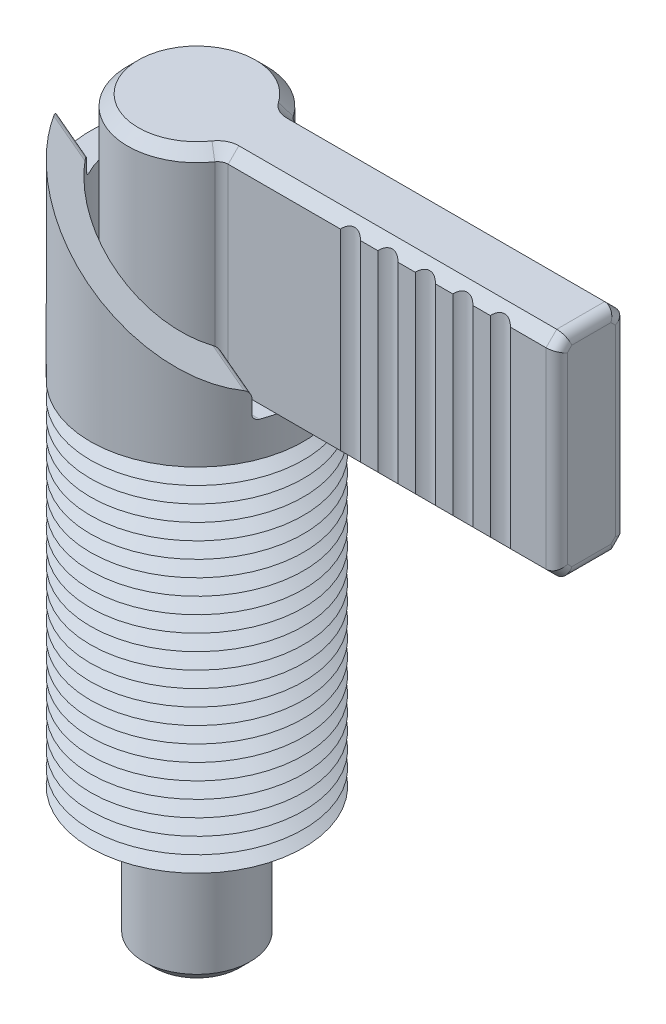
ISO-10303-21;
HEADER;
FILE_DESCRIPTION(('STEP AP214'),'2;1');
FILE_NAME('part.step','',(''),(''),'','','');
FILE_SCHEMA(('AUTOMOTIVE_DESIGN { 1 0 10303 214 1 1 1 1 }'));
ENDSEC;
DATA;
#1=APPLICATION_CONTEXT('core data for automotive mechanical design processes');
#2=APPLICATION_PROTOCOL_DEFINITION('international standard','automotive_design',2000,#1);
#3=PRODUCT_CONTEXT('',#1,'mechanical');
#4=PRODUCT('Part','Part','',(#3));
#5=PRODUCT_RELATED_PRODUCT_CATEGORY('part','',(#4));
#6=PRODUCT_DEFINITION_FORMATION('','',#4);
#7=PRODUCT_DEFINITION_CONTEXT('part definition',#1,'design');
#8=PRODUCT_DEFINITION('design','',#6,#7);
#9=PRODUCT_DEFINITION_SHAPE('','',#8);
#10=(LENGTH_UNIT() NAMED_UNIT(*) SI_UNIT(.MILLI.,.METRE.));
#11=(NAMED_UNIT(*) PLANE_ANGLE_UNIT() SI_UNIT($,.RADIAN.));
#12=(NAMED_UNIT(*) SI_UNIT($,.STERADIAN.) SOLID_ANGLE_UNIT());
#13=UNCERTAINTY_MEASURE_WITH_UNIT(LENGTH_MEASURE(1.E-05),#10,'distance_accuracy_value','');
#14=(GEOMETRIC_REPRESENTATION_CONTEXT(3) GLOBAL_UNCERTAINTY_ASSIGNED_CONTEXT((#13)) GLOBAL_UNIT_ASSIGNED_CONTEXT((#10,
#11,#12)) REPRESENTATION_CONTEXT('',''));
#15=CARTESIAN_POINT('',(0.,0.,0.));
#16=DIRECTION('',(0.,0.,1.));
#17=DIRECTION('',(1.,0.,0.));
#18=AXIS2_PLACEMENT_3D('',#15,#16,#17);
#19=CARTESIAN_POINT('',(5.62916512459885,4.96284530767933,3.25));
#20=DIRECTION('',(0.,0.,1.));
#21=DIRECTION('',(1.,0.,0.));
#22=AXIS2_PLACEMENT_3D('',#19,#20,#21);
#23=PLANE('',#22);
#24=DIRECTION('',(0.,1.,0.));
#25=VECTOR('',#24,1.);
#26=CARTESIAN_POINT('',(18.5915927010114,-12.,3.25));
#27=LINE('',#26,#25);
#28=CARTESIAN_POINT('',(18.5915927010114,38.001,3.25));
#29=VERTEX_POINT('',#28);
#30=CARTESIAN_POINT('',(18.5915927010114,55.999,3.25));
#31=VERTEX_POINT('',#30);
#32=EDGE_CURVE('P0_E200',#29,#31,#27,.T.);
#33=ORIENTED_EDGE('',*,*,#32,.F.);
#34=DIRECTION('',(1.,0.,0.));
#35=VECTOR('',#34,1.);
#36=CARTESIAN_POINT('',(37.,38.001,3.25));
#37=LINE('',#36,#35);
#38=CARTESIAN_POINT('',(20.2214072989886,38.001,3.25));
#39=VERTEX_POINT('',#38);
#40=EDGE_CURVE('P0_E209',#29,#39,#37,.T.);
#41=ORIENTED_EDGE('',*,*,#40,.T.);
#42=DIRECTION('',(0.,1.,0.));
#43=VECTOR('',#42,1.);
#44=CARTESIAN_POINT('',(20.2214072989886,-12.,3.25));
#45=LINE('',#44,#43);
#46=CARTESIAN_POINT('',(20.2214072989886,55.999,3.25));
#47=VERTEX_POINT('',#46);
#48=EDGE_CURVE('P0_E210',#39,#47,#45,.T.);
#49=ORIENTED_EDGE('',*,*,#48,.T.);
#50=DIRECTION('',(-1.,0.,0.));
#51=VECTOR('',#50,1.);
#52=CARTESIAN_POINT('',(6.18012944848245,55.999,3.25));
#53=LINE('',#52,#51);
#54=EDGE_CURVE('P0_E236',#47,#31,#53,.T.);
#55=ORIENTED_EDGE('',*,*,#54,.T.);
#56=EDGE_LOOP('',(#33,#41,#49,#55));
#57=FACE_BOUND('',#56,.T.);
#58=ADVANCED_FACE('P0_F16',(#57),#23,.T.);
#59=DIRECTION('',(0.,1.,0.));
#60=VECTOR('',#59,1.);
#61=CARTESIAN_POINT('',(22.1065927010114,-12.,3.25));
#62=LINE('',#61,#60);
#63=CARTESIAN_POINT('',(22.1065927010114,38.001,3.25));
#64=VERTEX_POINT('',#63);
#65=CARTESIAN_POINT('',(22.1065927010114,55.999,3.25));
#66=VERTEX_POINT('',#65);
#67=EDGE_CURVE('P0_E299',#64,#66,#62,.T.);
#68=ORIENTED_EDGE('',*,*,#67,.F.);
#69=CARTESIAN_POINT('',(23.7364072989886,38.001,3.25));
#70=VERTEX_POINT('',#69);
#71=EDGE_CURVE('P0_E221',#64,#70,#37,.T.);
#72=ORIENTED_EDGE('',*,*,#71,.T.);
#73=DIRECTION('',(0.,1.,0.));
#74=VECTOR('',#73,1.);
#75=CARTESIAN_POINT('',(23.7364072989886,-12.,3.25));
#76=LINE('',#75,#74);
#77=CARTESIAN_POINT('',(23.7364072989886,55.999,3.25));
#78=VERTEX_POINT('',#77);
#79=EDGE_CURVE('P0_E293',#70,#78,#76,.T.);
#80=ORIENTED_EDGE('',*,*,#79,.T.);
#81=EDGE_CURVE('P0_E239',#78,#66,#53,.T.);
#82=ORIENTED_EDGE('',*,*,#81,.T.);
#83=EDGE_LOOP('',(#68,#72,#80,#82));
#84=FACE_BOUND('',#83,.T.);
#85=ADVANCED_FACE('P0_F496',(#84),#23,.T.);
#86=DIRECTION('',(0.,1.,0.));
#87=VECTOR('',#86,1.);
#88=CARTESIAN_POINT('',(25.6215927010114,-12.,3.25));
#89=LINE('',#88,#87);
#90=CARTESIAN_POINT('',(25.6215927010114,38.001,3.25));
#91=VERTEX_POINT('',#90);
#92=CARTESIAN_POINT('',(25.6215927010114,55.999,3.25));
#93=VERTEX_POINT('',#92);
#94=EDGE_CURVE('P0_E292',#91,#93,#89,.T.);
#95=ORIENTED_EDGE('',*,*,#94,.F.);
#96=CARTESIAN_POINT('',(27.2514072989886,38.001,3.25));
#97=VERTEX_POINT('',#96);
#98=EDGE_CURVE('P0_E228',#91,#97,#37,.T.);
#99=ORIENTED_EDGE('',*,*,#98,.T.);
#100=DIRECTION('',(0.,1.,0.));
#101=VECTOR('',#100,1.);
#102=CARTESIAN_POINT('',(27.2514072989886,-12.,3.25));
#103=LINE('',#102,#101);
#104=CARTESIAN_POINT('',(27.2514072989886,55.999,3.25));
#105=VERTEX_POINT('',#104);
#106=EDGE_CURVE('P0_E286',#97,#105,#103,.T.);
#107=ORIENTED_EDGE('',*,*,#106,.T.);
#108=EDGE_CURVE('P0_E234',#105,#93,#53,.T.);
#109=ORIENTED_EDGE('',*,*,#108,.T.);
#110=EDGE_LOOP('',(#95,#99,#107,#109));
#111=FACE_BOUND('',#110,.T.);
#112=ADVANCED_FACE('P0_F324',(#111),#23,.T.);
#113=DIRECTION('',(0.,1.,0.));
#114=VECTOR('',#113,1.);
#115=CARTESIAN_POINT('',(29.1365927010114,-12.,3.25));
#116=LINE('',#115,#114);
#117=CARTESIAN_POINT('',(29.1365927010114,38.001,3.25));
#118=VERTEX_POINT('',#117);
#119=CARTESIAN_POINT('',(29.1365927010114,55.999,3.25));
#120=VERTEX_POINT('',#119);
#121=EDGE_CURVE('P0_E285',#118,#120,#116,.T.);
#122=ORIENTED_EDGE('',*,*,#121,.F.);
#123=CARTESIAN_POINT('',(30.7664072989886,38.001,3.25));
#124=VERTEX_POINT('',#123);
#125=EDGE_CURVE('P0_E223',#118,#124,#37,.T.);
#126=ORIENTED_EDGE('',*,*,#125,.T.);
#127=DIRECTION('',(0.,1.,0.));
#128=VECTOR('',#127,1.);
#129=CARTESIAN_POINT('',(30.7664072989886,-12.,3.25));
#130=LINE('',#129,#128);
#131=CARTESIAN_POINT('',(30.7664072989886,55.999,3.25));
#132=VERTEX_POINT('',#131);
#133=EDGE_CURVE('P0_E279',#124,#132,#130,.T.);
#134=ORIENTED_EDGE('',*,*,#133,.T.);
#135=EDGE_CURVE('P0_E229',#132,#120,#53,.T.);
#136=ORIENTED_EDGE('',*,*,#135,.T.);
#137=EDGE_LOOP('',(#122,#126,#134,#136));
#138=FACE_BOUND('',#137,.T.);
#139=ADVANCED_FACE('P0_F337',(#138),#23,.T.);
#140=CARTESIAN_POINT('',(32.6515927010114,38.001,3.25));
#141=VERTEX_POINT('',#140);
#142=CARTESIAN_POINT('',(35.999,38.001,3.25));
#143=VERTEX_POINT('',#142);
#144=EDGE_CURVE('P0_E218',#141,#143,#37,.T.);
#145=ORIENTED_EDGE('',*,*,#144,.T.);
#146=DIRECTION('',(0.,1.,0.));
#147=VECTOR('',#146,1.);
#148=CARTESIAN_POINT('',(35.999,4.96284530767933,3.25));
#149=LINE('',#148,#147);
#150=CARTESIAN_POINT('',(35.999,55.999,3.25));
#151=VERTEX_POINT('',#150);
#152=EDGE_CURVE('P0_E11',#143,#151,#149,.T.);
#153=ORIENTED_EDGE('',*,*,#152,.T.);
#154=CARTESIAN_POINT('',(32.6515927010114,55.999,3.25));
#155=VERTEX_POINT('',#154);
#156=EDGE_CURVE('P0_E224',#151,#155,#53,.T.);
#157=ORIENTED_EDGE('',*,*,#156,.T.);
#158=DIRECTION('',(0.,1.,0.));
#159=VECTOR('',#158,1.);
#160=CARTESIAN_POINT('',(32.6515927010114,-12.,3.25));
#161=LINE('',#160,#159);
#162=EDGE_CURVE('P0_E278',#141,#155,#161,.T.);
#163=ORIENTED_EDGE('',*,*,#162,.F.);
#164=EDGE_LOOP('',(#145,#153,#157,#163));
#165=FACE_BOUND('',#164,.T.);
#166=ADVANCED_FACE('P0_F506',(#165),#23,.T.);
#167=CARTESIAN_POINT('',(0.,-12.,0.));
#168=DIRECTION('',(0.,1.,0.));
#169=DIRECTION('',(0.,0.,1.));
#170=AXIS2_PLACEMENT_3D('',#167,#168,#169);
#171=PLANE('',#170);
#172=CARTESIAN_POINT('',(0.,-12.,0.));
#173=DIRECTION('',(0.,-1.,0.));
#174=DIRECTION('',(0.,0.,-1.));
#175=AXIS2_PLACEMENT_3D('',#172,#173,#174);
#176=CIRCLE('',#175,4.);
#177=CARTESIAN_POINT('',(0.,-12.,-4.));
#178=VERTEX_POINT('',#177);
#179=EDGE_CURVE('P0_E259',#178,#178,#176,.T.);
#180=ORIENTED_EDGE('',*,*,#179,.T.);
#181=EDGE_LOOP('',(#180));
#182=FACE_BOUND('',#181,.T.);
#183=ADVANCED_FACE('P0_F516',(#182),#171,.F.);
#184=CARTESIAN_POINT('',(0.,-11.,0.));
#185=DIRECTION('',(0.,1.,0.));
#186=DIRECTION('',(0.,0.,1.));
#187=AXIS2_PLACEMENT_3D('',#184,#185,#186);
#188=CONICAL_SURFACE('',#187,5.,0.785398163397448);
#189=ORIENTED_EDGE('',*,*,#179,.F.);
#190=EDGE_LOOP('',(#189));
#191=FACE_BOUND('',#190,.T.);
#192=CARTESIAN_POINT('',(0.,-11.,0.));
#193=DIRECTION('',(0.,-1.,0.));
#194=DIRECTION('',(0.,0.,-1.));
#195=AXIS2_PLACEMENT_3D('',#192,#193,#194);
#196=CIRCLE('',#195,5.);
#197=CARTESIAN_POINT('',(0.,-11.,-5.));
#198=VERTEX_POINT('',#197);
#199=EDGE_CURVE('P0_E262',#198,#198,#196,.T.);
#200=ORIENTED_EDGE('',*,*,#199,.T.);
#201=EDGE_LOOP('',(#200));
#202=FACE_BOUND('',#201,.T.);
#203=ADVANCED_FACE('P0_F521',(#191,#202),#188,.T.);
#204=CARTESIAN_POINT('',(0.,-12.,0.));
#205=DIRECTION('',(0.,-1.,0.));
#206=DIRECTION('',(0.,0.,-1.));
#207=AXIS2_PLACEMENT_3D('',#204,#205,#206);
#208=CYLINDRICAL_SURFACE('',#207,5.);
#209=ORIENTED_EDGE('',*,*,#199,.F.);
#210=EDGE_LOOP('',(#209));
#211=FACE_BOUND('',#210,.T.);
#212=CARTESIAN_POINT('',(0.,9.,0.));
#213=DIRECTION('',(0.,-1.,0.));
#214=DIRECTION('',(0.,0.,-1.));
#215=AXIS2_PLACEMENT_3D('',#212,#213,#214);
#216=CIRCLE('',#215,5.);
#217=CARTESIAN_POINT('',(0.,9.,-5.));
#218=VERTEX_POINT('',#217);
#219=EDGE_CURVE('P0_E265',#218,#218,#216,.T.);
#220=ORIENTED_EDGE('',*,*,#219,.T.);
#221=EDGE_LOOP('',(#220));
#222=FACE_BOUND('',#221,.T.);
#223=ADVANCED_FACE('P0_F555',(#211,#222),#208,.T.);
#224=CARTESIAN_POINT('',(-5.,9.,0.));
#225=DIRECTION('',(0.,-1.,0.));
#226=DIRECTION('',(0.,0.,-1.));
#227=AXIS2_PLACEMENT_3D('',#224,#225,#226);
#228=PLANE('',#227);
#229=ORIENTED_EDGE('',*,*,#219,.F.);
#230=EDGE_LOOP('',(#229));
#231=FACE_BOUND('',#230,.T.);
#232=CARTESIAN_POINT('',(0.,9.,0.));
#233=DIRECTION('',(0.,-1.,0.));
#234=DIRECTION('',(0.,0.,-1.));
#235=AXIS2_PLACEMENT_3D('',#232,#233,#234);
#236=CIRCLE('',#235,3.75);
#237=CARTESIAN_POINT('',(0.,9.,-3.75));
#238=VERTEX_POINT('',#237);
#239=EDGE_CURVE('P0_E268',#238,#238,#236,.T.);
#240=ORIENTED_EDGE('',*,*,#239,.T.);
#241=EDGE_LOOP('',(#240));
#242=FACE_BOUND('',#241,.T.);
#243=ADVANCED_FACE('P0_F563',(#231,#242),#228,.F.);
#244=CARTESIAN_POINT('',(0.,-12.,0.));
#245=DIRECTION('',(0.,-1.,0.));
#246=DIRECTION('',(0.,0.,-1.));
#247=AXIS2_PLACEMENT_3D('',#244,#245,#246);
#248=CYLINDRICAL_SURFACE('',#247,3.75);
#249=ORIENTED_EDGE('',*,*,#239,.F.);
#250=EDGE_LOOP('',(#249));
#251=FACE_BOUND('',#250,.T.);
#252=CARTESIAN_POINT('',(0.,37.,0.));
#253=DIRECTION('',(0.,-1.,0.));
#254=DIRECTION('',(0.,0.,-1.));
#255=AXIS2_PLACEMENT_3D('',#252,#253,#254);
#256=CIRCLE('',#255,3.75);
#257=CARTESIAN_POINT('',(0.,37.,-3.75));
#258=VERTEX_POINT('',#257);
#259=EDGE_CURVE('P0_E271',#258,#258,#256,.T.);
#260=ORIENTED_EDGE('',*,*,#259,.T.);
#261=EDGE_LOOP('',(#260));
#262=FACE_BOUND('',#261,.T.);
#263=ADVANCED_FACE('P0_F571',(#251,#262),#248,.T.);
#264=CARTESIAN_POINT('',(-3.75,37.,0.));
#265=DIRECTION('',(0.,1.,0.));
#266=DIRECTION('',(0.,0.,1.));
#267=AXIS2_PLACEMENT_3D('',#264,#265,#266);
#268=PLANE('',#267);
#269=ORIENTED_EDGE('',*,*,#259,.F.);
#270=EDGE_LOOP('',(#269));
#271=FACE_BOUND('',#270,.T.);
#272=DIRECTION('',(1.,0.,0.));
#273=VECTOR('',#272,1.);
#274=CARTESIAN_POINT('',(37.,37.,-2.24899999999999));
#275=LINE('',#274,#273);
#276=CARTESIAN_POINT('',(6.18012944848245,37.,-2.24899999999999));
#277=VERTEX_POINT('',#276);
#278=CARTESIAN_POINT('',(35.999,37.,-2.24899999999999));
#279=VERTEX_POINT('',#278);
#280=EDGE_CURVE('P0_E247',#277,#279,#275,.T.);
#281=ORIENTED_EDGE('',*,*,#280,.T.);
#282=DIRECTION('',(0.,0.,1.));
#283=VECTOR('',#282,1.);
#284=CARTESIAN_POINT('',(35.999,37.,2.24899999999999));
#285=LINE('',#284,#283);
#286=CARTESIAN_POINT('',(35.999,37.,2.24899999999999));
#287=VERTEX_POINT('',#286);
#288=EDGE_CURVE('P0_E40',#279,#287,#285,.T.);
#289=ORIENTED_EDGE('',*,*,#288,.T.);
#290=DIRECTION('',(-1.,0.,0.));
#291=VECTOR('',#290,1.);
#292=CARTESIAN_POINT('',(6.18012944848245,37.,2.24899999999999));
#293=LINE('',#292,#291);
#294=CARTESIAN_POINT('',(6.18012944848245,37.,2.24899999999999));
#295=VERTEX_POINT('',#294);
#296=EDGE_CURVE('P0_E237',#287,#295,#293,.T.);
#297=ORIENTED_EDGE('',*,*,#296,.T.);
#298=CARTESIAN_POINT('',(6.18012944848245,37.,4.251));
#299=DIRECTION('',(0.,1.,0.));
#300=DIRECTION('',(0.,0.,1.));
#301=AXIS2_PLACEMENT_3D('',#298,#299,#300);
#302=CIRCLE('',#301,2.00200000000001);
#303=CARTESIAN_POINT('',(4.53066682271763,37.,3.11641767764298));
#304=VERTEX_POINT('',#303);
#305=EDGE_CURVE('P0_E240',#295,#304,#302,.T.);
#306=ORIENTED_EDGE('',*,*,#305,.T.);
#307=CARTESIAN_POINT('',(0.,37.,0.));
#308=DIRECTION('',(0.,1.,0.));
#309=DIRECTION('',(0.,0.,1.));
#310=AXIS2_PLACEMENT_3D('',#307,#308,#309);
#311=CIRCLE('',#310,5.49899999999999);
#312=CARTESIAN_POINT('',(4.53066682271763,37.,-3.11641767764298));
#313=VERTEX_POINT('',#312);
#314=EDGE_CURVE('P0_E241',#304,#313,#311,.F.);
#315=ORIENTED_EDGE('',*,*,#314,.T.);
#316=CARTESIAN_POINT('',(6.18012944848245,37.,-4.251));
#317=DIRECTION('',(0.,1.,0.));
#318=DIRECTION('',(0.,0.,1.));
#319=AXIS2_PLACEMENT_3D('',#316,#317,#318);
#320=CIRCLE('',#319,2.00200000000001);
#321=EDGE_CURVE('P0_E245',#313,#277,#320,.T.);
#322=ORIENTED_EDGE('',*,*,#321,.T.);
#323=EDGE_LOOP('',(#281,#289,#297,#306,#315,#322));
#324=FACE_BOUND('',#323,.T.);
#325=ADVANCED_FACE('P0_F422',(#271,#324),#268,.F.);
#326=CARTESIAN_POINT('',(0.,-12.,0.));
#327=DIRECTION('',(0.,-1.,0.));
#328=DIRECTION('',(0.,0.,-1.));
#329=AXIS2_PLACEMENT_3D('',#326,#327,#328);
#330=CYLINDRICAL_SURFACE('',#329,6.5);
#331=DIRECTION('',(0.,-1.,0.));
#332=VECTOR('',#331,1.);
#333=CARTESIAN_POINT('',(5.35539813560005,-12.,-3.68370883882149));
#334=LINE('',#333,#332);
#335=CARTESIAN_POINT('',(5.35539813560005,55.999,-3.68370883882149));
#336=VERTEX_POINT('',#335);
#337=CARTESIAN_POINT('',(5.35539813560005,38.001,-3.68370883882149));
#338=VERTEX_POINT('',#337);
#339=EDGE_CURVE('P0_E250',#336,#338,#334,.T.);
#340=ORIENTED_EDGE('',*,*,#339,.T.);
#341=CARTESIAN_POINT('',(0.,38.001,0.));
#342=DIRECTION('',(0.,1.,0.));
#343=DIRECTION('',(0.,0.,1.));
#344=AXIS2_PLACEMENT_3D('',#341,#342,#343);
#345=CIRCLE('',#344,6.5);
#346=CARTESIAN_POINT('',(5.35539813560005,38.001,3.68370883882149));
#347=VERTEX_POINT('',#346);
#348=EDGE_CURVE('P0_E436',#338,#347,#345,.T.);
#349=ORIENTED_EDGE('',*,*,#348,.T.);
#350=DIRECTION('',(0.,-1.,0.));
#351=VECTOR('',#350,1.);
#352=CARTESIAN_POINT('',(5.35539813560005,-12.,3.68370883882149));
#353=LINE('',#352,#351);
#354=CARTESIAN_POINT('',(5.35539813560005,55.999,3.68370883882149));
#355=VERTEX_POINT('',#354);
#356=EDGE_CURVE('P0_E253',#347,#355,#353,.F.);
#357=ORIENTED_EDGE('',*,*,#356,.T.);
#358=CARTESIAN_POINT('',(0.,55.999,0.));
#359=DIRECTION('',(0.,-1.,0.));
#360=DIRECTION('',(0.,0.,-1.));
#361=AXIS2_PLACEMENT_3D('',#358,#359,#360);
#362=CIRCLE('',#361,6.5);
#363=EDGE_CURVE('P0_E476',#355,#336,#362,.T.);
#364=ORIENTED_EDGE('',*,*,#363,.T.);
#365=EDGE_LOOP('',(#340,#349,#357,#364));
#366=FACE_BOUND('',#365,.T.);
#367=ADVANCED_FACE('P0_F586',(#366),#330,.T.);
#368=CARTESIAN_POINT('',(-6.5,57.,0.));
#369=DIRECTION('',(0.,-1.,0.));
#370=DIRECTION('',(0.,0.,-1.));
#371=AXIS2_PLACEMENT_3D('',#368,#369,#370);
#372=PLANE('',#371);
#373=DIRECTION('',(1.,0.,0.));
#374=VECTOR('',#373,1.);
#375=CARTESIAN_POINT('',(37.,57.,2.24899999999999));
#376=LINE('',#375,#374);
#377=CARTESIAN_POINT('',(6.18012944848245,57.,2.24899999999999));
#378=VERTEX_POINT('',#377);
#379=CARTESIAN_POINT('',(35.999,57.,2.24899999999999));
#380=VERTEX_POINT('',#379);
#381=EDGE_CURVE('P0_E343',#378,#380,#376,.T.);
#382=ORIENTED_EDGE('',*,*,#381,.T.);
#383=DIRECTION('',(0.,0.,-1.));
#384=VECTOR('',#383,1.);
#385=CARTESIAN_POINT('',(35.999,57.,-2.249));
#386=LINE('',#385,#384);
#387=CARTESIAN_POINT('',(35.999,57.,-2.24899999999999));
#388=VERTEX_POINT('',#387);
#389=EDGE_CURVE('P0_E375',#380,#388,#386,.T.);
#390=ORIENTED_EDGE('',*,*,#389,.T.);
#391=DIRECTION('',(-1.,0.,0.));
#392=VECTOR('',#391,1.);
#393=CARTESIAN_POINT('',(6.18012944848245,57.,-2.24899999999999));
#394=LINE('',#393,#392);
#395=CARTESIAN_POINT('',(6.18012944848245,57.,-2.24899999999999));
#396=VERTEX_POINT('',#395);
#397=EDGE_CURVE('P0_E465',#388,#396,#394,.T.);
#398=ORIENTED_EDGE('',*,*,#397,.T.);
#399=CARTESIAN_POINT('',(6.18012944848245,57.,-4.251));
#400=DIRECTION('',(0.,-1.,0.));
#401=DIRECTION('',(0.,0.,-1.));
#402=AXIS2_PLACEMENT_3D('',#399,#400,#401);
#403=CIRCLE('',#402,2.00200000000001);
#404=CARTESIAN_POINT('',(4.53066682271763,57.,-3.11641767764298));
#405=VERTEX_POINT('',#404);
#406=EDGE_CURVE('P0_E463',#396,#405,#403,.T.);
#407=ORIENTED_EDGE('',*,*,#406,.T.);
#408=CARTESIAN_POINT('',(0.,57.,0.));
#409=DIRECTION('',(0.,-1.,0.));
#410=DIRECTION('',(0.,0.,-1.));
#411=AXIS2_PLACEMENT_3D('',#408,#409,#410);
#412=CIRCLE('',#411,5.49899999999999);
#413=CARTESIAN_POINT('',(4.53066682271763,57.,3.11641767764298));
#414=VERTEX_POINT('',#413);
#415=EDGE_CURVE('P0_E461',#405,#414,#412,.F.);
#416=ORIENTED_EDGE('',*,*,#415,.T.);
#417=CARTESIAN_POINT('',(6.18012944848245,57.,4.251));
#418=DIRECTION('',(0.,-1.,0.));
#419=DIRECTION('',(0.,0.,-1.));
#420=AXIS2_PLACEMENT_3D('',#417,#418,#419);
#421=CIRCLE('',#420,2.00200000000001);
#422=EDGE_CURVE('P0_E348',#414,#378,#421,.T.);
#423=ORIENTED_EDGE('',*,*,#422,.T.);
#424=EDGE_LOOP('',(#382,#390,#398,#407,#416,#423));
#425=FACE_BOUND('',#424,.T.);
#426=ADVANCED_FACE('P0_F594',(#425),#372,.F.);
#427=CARTESIAN_POINT('',(5.62916512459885,4.96284530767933,-3.25));
#428=DIRECTION('',(0.,0.,-1.));
#429=DIRECTION('',(-1.,0.,0.));
#430=AXIS2_PLACEMENT_3D('',#427,#428,#429);
#431=PLANE('',#430);
#432=DIRECTION('',(1.,0.,0.));
#433=VECTOR('',#432,1.);
#434=CARTESIAN_POINT('',(37.,55.999,-3.25));
#435=LINE('',#434,#433);
#436=CARTESIAN_POINT('',(6.18012944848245,55.999,-3.25));
#437=VERTEX_POINT('',#436);
#438=CARTESIAN_POINT('',(35.999,55.999,-3.25));
#439=VERTEX_POINT('',#438);
#440=EDGE_CURVE('P0_E468',#437,#439,#435,.T.);
#441=ORIENTED_EDGE('',*,*,#440,.T.);
#442=DIRECTION('',(0.,1.,0.));
#443=VECTOR('',#442,1.);
#444=CARTESIAN_POINT('',(35.999,4.96284530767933,-3.25));
#445=LINE('',#444,#443);
#446=CARTESIAN_POINT('',(35.999,38.001,-3.25));
#447=VERTEX_POINT('',#446);
#448=EDGE_CURVE('P0_E379',#439,#447,#445,.F.);
#449=ORIENTED_EDGE('',*,*,#448,.T.);
#450=DIRECTION('',(-1.,0.,0.));
#451=VECTOR('',#450,1.);
#452=CARTESIAN_POINT('',(6.18012944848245,38.001,-3.25));
#453=LINE('',#452,#451);
#454=CARTESIAN_POINT('',(6.18012944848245,38.001,-3.25));
#455=VERTEX_POINT('',#454);
#456=EDGE_CURVE('P0_E421',#447,#455,#453,.T.);
#457=ORIENTED_EDGE('',*,*,#456,.T.);
#458=DIRECTION('',(0.,-1.,0.));
#459=VECTOR('',#458,1.);
#460=CARTESIAN_POINT('',(6.18012944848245,4.96284530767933,-3.25));
#461=LINE('',#460,#459);
#462=EDGE_CURVE('P0_E256',#455,#437,#461,.F.);
#463=ORIENTED_EDGE('',*,*,#462,.T.);
#464=EDGE_LOOP('',(#441,#449,#457,#463));
#465=FACE_BOUND('',#464,.T.);
#466=ADVANCED_FACE('P0_F513',(#465),#431,.T.);
#467=CARTESIAN_POINT('',(37.,4.96284530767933,3.25));
#468=DIRECTION('',(1.,0.,0.));
#469=DIRECTION('',(0.,0.,-1.));
#470=AXIS2_PLACEMENT_3D('',#467,#468,#469);
#471=PLANE('',#470);
#472=DIRECTION('',(0.,0.,-1.));
#473=VECTOR('',#472,1.);
#474=CARTESIAN_POINT('',(37.,55.999,2.24899999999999));
#475=LINE('',#474,#473);
#476=CARTESIAN_POINT('',(37.,55.999,-1.83437222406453));
#477=VERTEX_POINT('',#476);
#478=CARTESIAN_POINT('',(37.,55.999,1.83437222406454));
#479=VERTEX_POINT('',#478);
#480=EDGE_CURVE('P0_E367',#477,#479,#475,.F.);
#481=ORIENTED_EDGE('',*,*,#480,.T.);
#482=DIRECTION('',(0.,-0.70710678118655,0.707106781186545));
#483=VECTOR('',#482,1.);
#484=CARTESIAN_POINT('',(37.,29.7731087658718,28.0602634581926));
#485=LINE('',#484,#483);
#486=CARTESIAN_POINT('',(37.,55.5843722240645,2.249));
#487=VERTEX_POINT('',#486);
#488=EDGE_CURVE('P0_E369',#479,#487,#485,.T.);
#489=ORIENTED_EDGE('',*,*,#488,.T.);
#490=DIRECTION('',(0.,1.,0.));
#491=VECTOR('',#490,1.);
#492=CARTESIAN_POINT('',(37.,4.96284530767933,2.249));
#493=LINE('',#492,#491);
#494=CARTESIAN_POINT('',(37.,38.4156277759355,2.249));
#495=VERTEX_POINT('',#494);
#496=EDGE_CURVE('P0_E309',#487,#495,#493,.F.);
#497=ORIENTED_EDGE('',*,*,#496,.T.);
#498=DIRECTION('',(0.,-0.70710678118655,-0.707106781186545));
#499=VECTOR('',#498,1.);
#500=CARTESIAN_POINT('',(37.,22.1897365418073,-13.9768912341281));
#501=LINE('',#500,#499);
#502=CARTESIAN_POINT('',(37.,38.001,1.83437222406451));
#503=VERTEX_POINT('',#502);
#504=EDGE_CURVE('P0_E357',#495,#503,#501,.T.);
#505=ORIENTED_EDGE('',*,*,#504,.T.);
#506=DIRECTION('',(0.,0.,1.));
#507=VECTOR('',#506,1.);
#508=CARTESIAN_POINT('',(37.,38.001,-2.24899999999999));
#509=LINE('',#508,#507);
#510=CARTESIAN_POINT('',(37.,38.001,-1.83437222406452));
#511=VERTEX_POINT('',#510);
#512=EDGE_CURVE('P0_E359',#503,#511,#509,.F.);
#513=ORIENTED_EDGE('',*,*,#512,.T.);
#514=DIRECTION('',(0.,0.70710678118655,-0.707106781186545));
#515=VECTOR('',#514,1.);
#516=CARTESIAN_POINT('',(37.,18.9397365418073,17.2268912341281));
#517=LINE('',#516,#515);
#518=CARTESIAN_POINT('',(37.,38.4156277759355,-2.249));
#519=VERTEX_POINT('',#518);
#520=EDGE_CURVE('P0_E361',#511,#519,#517,.T.);
#521=ORIENTED_EDGE('',*,*,#520,.T.);
#522=DIRECTION('',(0.,1.,0.));
#523=VECTOR('',#522,1.);
#524=CARTESIAN_POINT('',(37.,4.96284530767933,-2.249));
#525=LINE('',#524,#523);
#526=CARTESIAN_POINT('',(37.,55.5843722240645,-2.249));
#527=VERTEX_POINT('',#526);
#528=EDGE_CURVE('P0_E363',#519,#527,#525,.T.);
#529=ORIENTED_EDGE('',*,*,#528,.T.);
#530=DIRECTION('',(0.,0.70710678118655,0.707106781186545));
#531=VECTOR('',#530,1.);
#532=CARTESIAN_POINT('',(37.,33.0231087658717,-24.8102634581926));
#533=LINE('',#532,#531);
#534=EDGE_CURVE('P0_E365',#527,#477,#533,.T.);
#535=ORIENTED_EDGE('',*,*,#534,.T.);
#536=EDGE_LOOP('',(#481,#489,#497,#505,#513,#521,#529,#535));
#537=FACE_BOUND('',#536,.T.);
#538=ADVANCED_FACE('P0_F505',(#537),#471,.T.);
#539=DIRECTION('',(0.,1.,0.));
#540=VECTOR('',#539,1.);
#541=CARTESIAN_POINT('',(16.7064072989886,-12.,3.25));
#542=LINE('',#541,#540);
#543=CARTESIAN_POINT('',(16.7064072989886,38.001,3.25));
#544=VERTEX_POINT('',#543);
#545=CARTESIAN_POINT('',(16.7064072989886,55.999,3.25));
#546=VERTEX_POINT('',#545);
#547=EDGE_CURVE('P0_E190',#544,#546,#542,.T.);
#548=ORIENTED_EDGE('',*,*,#547,.T.);
#549=CARTESIAN_POINT('',(6.18012944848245,55.999,3.25));
#550=VERTEX_POINT('',#549);
#551=EDGE_CURVE('P0_E230',#546,#550,#53,.T.);
#552=ORIENTED_EDGE('',*,*,#551,.T.);
#553=DIRECTION('',(0.,-1.,0.));
#554=VECTOR('',#553,1.);
#555=CARTESIAN_POINT('',(6.18012944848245,4.96284530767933,3.25));
#556=LINE('',#555,#554);
#557=CARTESIAN_POINT('',(6.18012944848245,38.001,3.25));
#558=VERTEX_POINT('',#557);
#559=EDGE_CURVE('P0_E215',#550,#558,#556,.T.);
#560=ORIENTED_EDGE('',*,*,#559,.T.);
#561=EDGE_CURVE('P0_E206',#558,#544,#37,.T.);
#562=ORIENTED_EDGE('',*,*,#561,.T.);
#563=EDGE_LOOP('',(#548,#552,#560,#562));
#564=FACE_BOUND('',#563,.T.);
#565=ADVANCED_FACE('P0_F213',(#564),#23,.T.);
#566=CARTESIAN_POINT('',(6.18012944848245,-12.,-4.251));
#567=DIRECTION('',(0.,-1.,0.));
#568=DIRECTION('',(0.,0.,-1.));
#569=AXIS2_PLACEMENT_3D('',#566,#567,#568);
#570=CYLINDRICAL_SURFACE('',#569,1.001);
#571=ORIENTED_EDGE('',*,*,#462,.F.);
#572=CARTESIAN_POINT('',(6.18012944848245,38.001,-4.251));
#573=DIRECTION('',(0.,1.,0.));
#574=DIRECTION('',(0.,0.,1.));
#575=AXIS2_PLACEMENT_3D('',#572,#573,#574);
#576=CIRCLE('',#575,1.001);
#577=EDGE_CURVE('P0_E471',#455,#338,#576,.F.);
#578=ORIENTED_EDGE('',*,*,#577,.T.);
#579=ORIENTED_EDGE('',*,*,#339,.F.);
#580=CARTESIAN_POINT('',(6.18012944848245,55.999,-4.251));
#581=DIRECTION('',(0.,-1.,0.));
#582=DIRECTION('',(0.,0.,-1.));
#583=AXIS2_PLACEMENT_3D('',#580,#581,#582);
#584=CIRCLE('',#583,1.001);
#585=EDGE_CURVE('P0_E473',#336,#437,#584,.F.);
#586=ORIENTED_EDGE('',*,*,#585,.T.);
#587=EDGE_LOOP('',(#571,#578,#579,#586));
#588=FACE_BOUND('',#587,.T.);
#589=ADVANCED_FACE('P0_F504',(#588),#570,.F.);
#590=CARTESIAN_POINT('',(6.18012944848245,-12.,4.251));
#591=DIRECTION('',(0.,-1.,0.));
#592=DIRECTION('',(0.,0.,-1.));
#593=AXIS2_PLACEMENT_3D('',#590,#591,#592);
#594=CYLINDRICAL_SURFACE('',#593,1.001);
#595=ORIENTED_EDGE('',*,*,#356,.F.);
#596=CARTESIAN_POINT('',(6.18012944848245,38.001,4.251));
#597=DIRECTION('',(0.,1.,0.));
#598=DIRECTION('',(0.,0.,1.));
#599=AXIS2_PLACEMENT_3D('',#596,#597,#598);
#600=CIRCLE('',#599,1.001);
#601=EDGE_CURVE('P0_E219',#347,#558,#600,.F.);
#602=ORIENTED_EDGE('',*,*,#601,.T.);
#603=ORIENTED_EDGE('',*,*,#559,.F.);
#604=CARTESIAN_POINT('',(6.18012944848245,55.999,4.251));
#605=DIRECTION('',(0.,-1.,0.));
#606=DIRECTION('',(0.,0.,-1.));
#607=AXIS2_PLACEMENT_3D('',#604,#605,#606);
#608=CIRCLE('',#607,1.001);
#609=EDGE_CURVE('P0_E216',#550,#355,#608,.F.);
#610=ORIENTED_EDGE('',*,*,#609,.T.);
#611=EDGE_LOOP('',(#595,#602,#603,#610));
#612=FACE_BOUND('',#611,.T.);
#613=ADVANCED_FACE('P0_F481',(#612),#594,.F.);
#614=CARTESIAN_POINT('',(-3.75,37.,-2.24899999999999));
#615=DIRECTION('',(0.,-0.707106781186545,-0.70710678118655));
#616=DIRECTION('',(0.,0.70710678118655,-0.707106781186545));
#617=AXIS2_PLACEMENT_3D('',#614,#615,#616);
#618=PLANE('',#617);
#619=ORIENTED_EDGE('',*,*,#456,.F.);
#620=DIRECTION('',(0.,0.70710678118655,-0.707106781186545));
#621=VECTOR('',#620,1.);
#622=CARTESIAN_POINT('',(35.999,37.,-2.24899999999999));
#623=LINE('',#622,#621);
#624=EDGE_CURVE('P0_E381',#447,#279,#623,.F.);
#625=ORIENTED_EDGE('',*,*,#624,.T.);
#626=ORIENTED_EDGE('',*,*,#280,.F.);
#627=DIRECTION('',(0.,-0.70710678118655,0.707106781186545));
#628=VECTOR('',#627,1.);
#629=CARTESIAN_POINT('',(6.18012944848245,38.001,-3.25));
#630=LINE('',#629,#628);
#631=EDGE_CURVE('P0_E274',#455,#277,#630,.T.);
#632=ORIENTED_EDGE('',*,*,#631,.F.);
#633=EDGE_LOOP('',(#619,#625,#626,#632));
#634=FACE_BOUND('',#633,.T.);
#635=ADVANCED_FACE('P0_F418',(#634),#618,.T.);
#636=CARTESIAN_POINT('',(6.18012944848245,37.,-4.251));
#637=DIRECTION('',(0.,-1.,0.));
#638=DIRECTION('',(0.,0.,-1.));
#639=AXIS2_PLACEMENT_3D('',#636,#637,#638);
#640=CONICAL_SURFACE('',#639,2.00200000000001,0.785398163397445);
#641=ORIENTED_EDGE('',*,*,#631,.T.);
#642=ORIENTED_EDGE('',*,*,#321,.F.);
#643=DIRECTION('',(-0.58259051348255,-0.70710678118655,0.400734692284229));
#644=VECTOR('',#643,1.);
#645=CARTESIAN_POINT('',(5.35539813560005,38.001,-3.68370883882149));
#646=LINE('',#645,#644);
#647=EDGE_CURVE('P0_E430',#338,#313,#646,.T.);
#648=ORIENTED_EDGE('',*,*,#647,.F.);
#649=ORIENTED_EDGE('',*,*,#577,.F.);
#650=EDGE_LOOP('',(#641,#642,#648,#649));
#651=FACE_BOUND('',#650,.T.);
#652=ADVANCED_FACE('P0_F428',(#651),#640,.F.);
#653=CARTESIAN_POINT('',(0.,37.,0.));
#654=DIRECTION('',(0.,1.,0.));
#655=DIRECTION('',(0.,0.,1.));
#656=AXIS2_PLACEMENT_3D('',#653,#654,#655);
#657=CONICAL_SURFACE('',#656,5.49899999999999,0.785398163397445);
#658=ORIENTED_EDGE('',*,*,#647,.T.);
#659=ORIENTED_EDGE('',*,*,#314,.F.);
#660=DIRECTION('',(-0.58259051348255,-0.70710678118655,-0.400734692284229));
#661=VECTOR('',#660,1.);
#662=CARTESIAN_POINT('',(5.35539813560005,38.001,3.68370883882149));
#663=LINE('',#662,#661);
#664=EDGE_CURVE('P0_E437',#347,#304,#663,.T.);
#665=ORIENTED_EDGE('',*,*,#664,.F.);
#666=ORIENTED_EDGE('',*,*,#348,.F.);
#667=EDGE_LOOP('',(#658,#659,#665,#666));
#668=FACE_BOUND('',#667,.T.);
#669=ADVANCED_FACE('P0_F433',(#668),#657,.T.);
#670=CARTESIAN_POINT('',(6.18012944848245,37.,4.251));
#671=DIRECTION('',(0.,-1.,0.));
#672=DIRECTION('',(0.,0.,-1.));
#673=AXIS2_PLACEMENT_3D('',#670,#671,#672);
#674=CONICAL_SURFACE('',#673,2.00200000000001,0.785398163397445);
#675=ORIENTED_EDGE('',*,*,#664,.T.);
#676=ORIENTED_EDGE('',*,*,#305,.F.);
#677=DIRECTION('',(0.,-0.70710678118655,-0.707106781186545));
#678=VECTOR('',#677,1.);
#679=CARTESIAN_POINT('',(6.18012944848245,38.001,3.25));
#680=LINE('',#679,#678);
#681=EDGE_CURVE('P0_E440',#558,#295,#680,.T.);
#682=ORIENTED_EDGE('',*,*,#681,.F.);
#683=ORIENTED_EDGE('',*,*,#601,.F.);
#684=EDGE_LOOP('',(#675,#676,#682,#683));
#685=FACE_BOUND('',#684,.T.);
#686=ADVANCED_FACE('P0_F484',(#685),#674,.F.);
#687=CARTESIAN_POINT('',(-3.75,37.,2.24899999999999));
#688=DIRECTION('',(0.,-0.707106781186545,0.70710678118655));
#689=DIRECTION('',(0.,-0.70710678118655,-0.707106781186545));
#690=AXIS2_PLACEMENT_3D('',#687,#688,#689);
#691=PLANE('',#690);
#692=ORIENTED_EDGE('',*,*,#296,.F.);
#693=DIRECTION('',(0.,-0.70710678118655,-0.707106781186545));
#694=VECTOR('',#693,1.);
#695=CARTESIAN_POINT('',(35.999,37.,2.24899999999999));
#696=LINE('',#695,#694);
#697=EDGE_CURVE('P0_E25',#287,#143,#696,.F.);
#698=ORIENTED_EDGE('',*,*,#697,.T.);
#699=ORIENTED_EDGE('',*,*,#144,.F.);
#700=CARTESIAN_POINT('',(31.709,38.889,4.138));
#701=DIRECTION('',(0.,-0.707106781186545,0.70710678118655));
#702=DIRECTION('',(0.,0.70710678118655,0.707106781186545));
#703=AXIS2_PLACEMENT_3D('',#700,#701,#702);
#704=ELLIPSE('',#703,1.83140656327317,1.295);
#705=EDGE_CURVE('P0_E275',#124,#141,#704,.T.);
#706=ORIENTED_EDGE('',*,*,#705,.F.);
#707=ORIENTED_EDGE('',*,*,#125,.F.);
#708=CARTESIAN_POINT('',(28.194,38.889,4.138));
#709=DIRECTION('',(0.,-0.707106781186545,0.70710678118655));
#710=DIRECTION('',(0.,0.70710678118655,0.707106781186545));
#711=AXIS2_PLACEMENT_3D('',#708,#709,#710);
#712=ELLIPSE('',#711,1.83140656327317,1.295);
#713=EDGE_CURVE('P0_E282',#97,#118,#712,.T.);
#714=ORIENTED_EDGE('',*,*,#713,.F.);
#715=ORIENTED_EDGE('',*,*,#98,.F.);
#716=CARTESIAN_POINT('',(24.679,38.889,4.138));
#717=DIRECTION('',(0.,-0.707106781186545,0.70710678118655));
#718=DIRECTION('',(0.,0.70710678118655,0.707106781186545));
#719=AXIS2_PLACEMENT_3D('',#716,#717,#718);
#720=ELLIPSE('',#719,1.83140656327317,1.295);
#721=EDGE_CURVE('P0_E289',#70,#91,#720,.T.);
#722=ORIENTED_EDGE('',*,*,#721,.F.);
#723=ORIENTED_EDGE('',*,*,#71,.F.);
#724=CARTESIAN_POINT('',(21.164,38.889,4.138));
#725=DIRECTION('',(0.,-0.707106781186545,0.70710678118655));
#726=DIRECTION('',(0.,0.70710678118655,0.707106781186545));
#727=AXIS2_PLACEMENT_3D('',#724,#725,#726);
#728=ELLIPSE('',#727,1.83140656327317,1.295);
#729=EDGE_CURVE('P0_E296',#39,#64,#728,.T.);
#730=ORIENTED_EDGE('',*,*,#729,.F.);
#731=ORIENTED_EDGE('',*,*,#40,.F.);
#732=CARTESIAN_POINT('',(17.649,38.889,4.138));
#733=DIRECTION('',(0.,-0.707106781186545,0.70710678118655));
#734=DIRECTION('',(0.,0.70710678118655,0.707106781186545));
#735=AXIS2_PLACEMENT_3D('',#732,#733,#734);
#736=ELLIPSE('',#735,1.83140656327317,1.295);
#737=EDGE_CURVE('P0_E193',#544,#29,#736,.T.);
#738=ORIENTED_EDGE('',*,*,#737,.F.);
#739=ORIENTED_EDGE('',*,*,#561,.F.);
#740=ORIENTED_EDGE('',*,*,#681,.T.);
#741=EDGE_LOOP('',(#692,#698,#699,#706,#707,#714,#715,#722,#723,#730,#731,#738,#739,#740));
#742=FACE_BOUND('',#741,.T.);
#743=ADVANCED_FACE('P0_F204',(#742),#691,.T.);
#744=CARTESIAN_POINT('',(-6.5,57.,-2.24899999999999));
#745=DIRECTION('',(0.,0.707106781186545,-0.70710678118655));
#746=DIRECTION('',(0.,0.70710678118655,0.707106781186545));
#747=AXIS2_PLACEMENT_3D('',#744,#745,#746);
#748=PLANE('',#747);
#749=ORIENTED_EDGE('',*,*,#397,.F.);
#750=DIRECTION('',(0.,0.70710678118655,0.707106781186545));
#751=VECTOR('',#750,1.);
#752=CARTESIAN_POINT('',(35.999,57.,-2.24899999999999));
#753=LINE('',#752,#751);
#754=EDGE_CURVE('P0_E377',#388,#439,#753,.F.);
#755=ORIENTED_EDGE('',*,*,#754,.T.);
#756=ORIENTED_EDGE('',*,*,#440,.F.);
#757=DIRECTION('',(0.,-0.70710678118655,-0.707106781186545));
#758=VECTOR('',#757,1.);
#759=CARTESIAN_POINT('',(6.18012944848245,57.,-2.24899999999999));
#760=LINE('',#759,#758);
#761=EDGE_CURVE('P0_E351',#396,#437,#760,.T.);
#762=ORIENTED_EDGE('',*,*,#761,.F.);
#763=EDGE_LOOP('',(#749,#755,#756,#762));
#764=FACE_BOUND('',#763,.T.);
#765=ADVANCED_FACE('P0_F492',(#764),#748,.T.);
#766=CARTESIAN_POINT('',(6.18012944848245,57.,-4.251));
#767=DIRECTION('',(0.,1.,0.));
#768=DIRECTION('',(0.,0.,1.));
#769=AXIS2_PLACEMENT_3D('',#766,#767,#768);
#770=CONICAL_SURFACE('',#769,2.00200000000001,0.785398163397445);
#771=ORIENTED_EDGE('',*,*,#761,.T.);
#772=ORIENTED_EDGE('',*,*,#585,.F.);
#773=DIRECTION('',(0.58259051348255,-0.70710678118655,-0.400734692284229));
#774=VECTOR('',#773,1.);
#775=CARTESIAN_POINT('',(4.53066682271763,57.,-3.11641767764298));
#776=LINE('',#775,#774);
#777=EDGE_CURVE('P0_E447',#405,#336,#776,.T.);
#778=ORIENTED_EDGE('',*,*,#777,.F.);
#779=ORIENTED_EDGE('',*,*,#406,.F.);
#780=EDGE_LOOP('',(#771,#772,#778,#779));
#781=FACE_BOUND('',#780,.T.);
#782=ADVANCED_FACE('P0_F653',(#781),#770,.F.);
#783=CARTESIAN_POINT('',(0.,55.999,0.));
#784=DIRECTION('',(0.,-1.,0.));
#785=DIRECTION('',(0.,0.,-1.));
#786=AXIS2_PLACEMENT_3D('',#783,#784,#785);
#787=CONICAL_SURFACE('',#786,6.5,0.785398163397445);
#788=ORIENTED_EDGE('',*,*,#777,.T.);
#789=ORIENTED_EDGE('',*,*,#363,.F.);
#790=DIRECTION('',(0.58259051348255,-0.70710678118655,0.400734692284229));
#791=VECTOR('',#790,1.);
#792=CARTESIAN_POINT('',(4.53066682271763,57.,3.11641767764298));
#793=LINE('',#792,#791);
#794=EDGE_CURVE('P0_E445',#414,#355,#793,.T.);
#795=ORIENTED_EDGE('',*,*,#794,.F.);
#796=ORIENTED_EDGE('',*,*,#415,.F.);
#797=EDGE_LOOP('',(#788,#789,#795,#796));
#798=FACE_BOUND('',#797,.T.);
#799=ADVANCED_FACE('P0_F661',(#798),#787,.T.);
#800=CARTESIAN_POINT('',(6.18012944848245,57.,4.251));
#801=DIRECTION('',(0.,1.,0.));
#802=DIRECTION('',(0.,0.,1.));
#803=AXIS2_PLACEMENT_3D('',#800,#801,#802);
#804=CONICAL_SURFACE('',#803,2.00200000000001,0.785398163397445);
#805=ORIENTED_EDGE('',*,*,#794,.T.);
#806=ORIENTED_EDGE('',*,*,#609,.F.);
#807=DIRECTION('',(0.,-0.70710678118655,0.707106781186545));
#808=VECTOR('',#807,1.);
#809=CARTESIAN_POINT('',(6.18012944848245,57.,2.24899999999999));
#810=LINE('',#809,#808);
#811=EDGE_CURVE('P0_E277',#378,#550,#810,.T.);
#812=ORIENTED_EDGE('',*,*,#811,.F.);
#813=ORIENTED_EDGE('',*,*,#422,.F.);
#814=EDGE_LOOP('',(#805,#806,#812,#813));
#815=FACE_BOUND('',#814,.T.);
#816=ADVANCED_FACE('P0_F668',(#815),#804,.F.);
#817=CARTESIAN_POINT('',(-6.5,57.,2.24899999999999));
#818=DIRECTION('',(0.,0.707106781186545,0.70710678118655));
#819=DIRECTION('',(0.,-0.70710678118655,0.707106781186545));
#820=AXIS2_PLACEMENT_3D('',#817,#818,#819);
#821=PLANE('',#820);
#822=ORIENTED_EDGE('',*,*,#156,.F.);
#823=DIRECTION('',(0.,-0.70710678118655,0.707106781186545));
#824=VECTOR('',#823,1.);
#825=CARTESIAN_POINT('',(35.999,57.,2.24899999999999));
#826=LINE('',#825,#824);
#827=EDGE_CURVE('P0_E372',#151,#380,#826,.F.);
#828=ORIENTED_EDGE('',*,*,#827,.T.);
#829=ORIENTED_EDGE('',*,*,#381,.F.);
#830=ORIENTED_EDGE('',*,*,#811,.T.);
#831=ORIENTED_EDGE('',*,*,#551,.F.);
#832=CARTESIAN_POINT('',(17.649,55.111,4.138));
#833=DIRECTION('',(0.,0.707106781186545,0.70710678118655));
#834=DIRECTION('',(0.,0.70710678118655,-0.707106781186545));
#835=AXIS2_PLACEMENT_3D('',#832,#833,#834);
#836=ELLIPSE('',#835,1.83140656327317,1.295);
#837=EDGE_CURVE('P0_E196',#31,#546,#836,.T.);
#838=ORIENTED_EDGE('',*,*,#837,.F.);
#839=ORIENTED_EDGE('',*,*,#54,.F.);
#840=CARTESIAN_POINT('',(21.164,55.111,4.138));
#841=DIRECTION('',(0.,0.707106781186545,0.70710678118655));
#842=DIRECTION('',(0.,0.70710678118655,-0.707106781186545));
#843=AXIS2_PLACEMENT_3D('',#840,#841,#842);
#844=ELLIPSE('',#843,1.83140656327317,1.295);
#845=EDGE_CURVE('P0_E310',#66,#47,#844,.T.);
#846=ORIENTED_EDGE('',*,*,#845,.F.);
#847=ORIENTED_EDGE('',*,*,#81,.F.);
#848=CARTESIAN_POINT('',(24.679,55.111,4.138));
#849=DIRECTION('',(0.,0.707106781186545,0.70710678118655));
#850=DIRECTION('',(0.,0.70710678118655,-0.707106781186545));
#851=AXIS2_PLACEMENT_3D('',#848,#849,#850);
#852=ELLIPSE('',#851,1.83140656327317,1.295);
#853=EDGE_CURVE('P0_E345',#93,#78,#852,.T.);
#854=ORIENTED_EDGE('',*,*,#853,.F.);
#855=ORIENTED_EDGE('',*,*,#108,.F.);
#856=CARTESIAN_POINT('',(28.194,55.111,4.138));
#857=DIRECTION('',(0.,0.707106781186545,0.70710678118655));
#858=DIRECTION('',(0.,0.70710678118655,-0.707106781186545));
#859=AXIS2_PLACEMENT_3D('',#856,#857,#858);
#860=ELLIPSE('',#859,1.83140656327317,1.295);
#861=EDGE_CURVE('P0_E332',#120,#105,#860,.T.);
#862=ORIENTED_EDGE('',*,*,#861,.F.);
#863=ORIENTED_EDGE('',*,*,#135,.F.);
#864=CARTESIAN_POINT('',(31.709,55.111,4.138));
#865=DIRECTION('',(0.,0.707106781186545,0.70710678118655));
#866=DIRECTION('',(0.,0.70710678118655,-0.707106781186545));
#867=AXIS2_PLACEMENT_3D('',#864,#865,#866);
#868=ELLIPSE('',#867,1.83140656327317,1.295);
#869=EDGE_CURVE('P0_E342',#155,#132,#868,.T.);
#870=ORIENTED_EDGE('',*,*,#869,.F.);
#871=EDGE_LOOP('',(#822,#828,#829,#830,#831,#838,#839,#846,#847,#854,#855,#862,#863,#870));
#872=FACE_BOUND('',#871,.T.);
#873=ADVANCED_FACE('P0_F306',(#872),#821,.T.);
#874=CARTESIAN_POINT('',(31.709,-12.,4.138));
#875=DIRECTION('',(0.,1.,0.));
#876=DIRECTION('',(0.,0.,1.));
#877=AXIS2_PLACEMENT_3D('',#874,#875,#876);
#878=CYLINDRICAL_SURFACE('',#877,1.295);
#879=ORIENTED_EDGE('',*,*,#705,.T.);
#880=ORIENTED_EDGE('',*,*,#162,.T.);
#881=ORIENTED_EDGE('',*,*,#869,.T.);
#882=ORIENTED_EDGE('',*,*,#133,.F.);
#883=EDGE_LOOP('',(#879,#880,#881,#882));
#884=FACE_BOUND('',#883,.T.);
#885=ADVANCED_FACE('P0_F340',(#884),#878,.F.);
#886=CARTESIAN_POINT('',(28.194,-12.,4.138));
#887=DIRECTION('',(0.,1.,0.));
#888=DIRECTION('',(0.,0.,1.));
#889=AXIS2_PLACEMENT_3D('',#886,#887,#888);
#890=CYLINDRICAL_SURFACE('',#889,1.295);
#891=ORIENTED_EDGE('',*,*,#713,.T.);
#892=ORIENTED_EDGE('',*,*,#121,.T.);
#893=ORIENTED_EDGE('',*,*,#861,.T.);
#894=ORIENTED_EDGE('',*,*,#106,.F.);
#895=EDGE_LOOP('',(#891,#892,#893,#894));
#896=FACE_BOUND('',#895,.T.);
#897=ADVANCED_FACE('P0_F329',(#896),#890,.F.);
#898=CARTESIAN_POINT('',(24.679,-12.,4.138));
#899=DIRECTION('',(0.,1.,0.));
#900=DIRECTION('',(0.,0.,1.));
#901=AXIS2_PLACEMENT_3D('',#898,#899,#900);
#902=CYLINDRICAL_SURFACE('',#901,1.295);
#903=ORIENTED_EDGE('',*,*,#721,.T.);
#904=ORIENTED_EDGE('',*,*,#94,.T.);
#905=ORIENTED_EDGE('',*,*,#853,.T.);
#906=ORIENTED_EDGE('',*,*,#79,.F.);
#907=EDGE_LOOP('',(#903,#904,#905,#906));
#908=FACE_BOUND('',#907,.T.);
#909=ADVANCED_FACE('P0_F694',(#908),#902,.F.);
#910=CARTESIAN_POINT('',(21.164,-12.,4.138));
#911=DIRECTION('',(0.,1.,0.));
#912=DIRECTION('',(0.,0.,1.));
#913=AXIS2_PLACEMENT_3D('',#910,#911,#912);
#914=CYLINDRICAL_SURFACE('',#913,1.295);
#915=ORIENTED_EDGE('',*,*,#729,.T.);
#916=ORIENTED_EDGE('',*,*,#67,.T.);
#917=ORIENTED_EDGE('',*,*,#845,.T.);
#918=ORIENTED_EDGE('',*,*,#48,.F.);
#919=EDGE_LOOP('',(#915,#916,#917,#918));
#920=FACE_BOUND('',#919,.T.);
#921=ADVANCED_FACE('P0_F314',(#920),#914,.F.);
#922=CARTESIAN_POINT('',(17.649,-12.,4.138));
#923=DIRECTION('',(0.,1.,0.));
#924=DIRECTION('',(0.,0.,1.));
#925=AXIS2_PLACEMENT_3D('',#922,#923,#924);
#926=CYLINDRICAL_SURFACE('',#925,1.295);
#927=ORIENTED_EDGE('',*,*,#737,.T.);
#928=ORIENTED_EDGE('',*,*,#32,.T.);
#929=ORIENTED_EDGE('',*,*,#837,.T.);
#930=ORIENTED_EDGE('',*,*,#547,.F.);
#931=EDGE_LOOP('',(#927,#928,#929,#930));
#932=FACE_BOUND('',#931,.T.);
#933=ADVANCED_FACE('P0_F192',(#932),#926,.F.);
#934=CARTESIAN_POINT('',(35.999,18.9397365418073,17.2268912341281));
#935=DIRECTION('',(0.,0.70710678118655,-0.707106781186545));
#936=DIRECTION('',(0.,0.707106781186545,0.70710678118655));
#937=AXIS2_PLACEMENT_3D('',#934,#935,#936);
#938=CYLINDRICAL_SURFACE('',#937,1.001);
#939=CARTESIAN_POINT('',(35.999,38.001,-1.83437222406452));
#940=DIRECTION('',(0.,0.382683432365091,-0.923879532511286));
#941=DIRECTION('',(0.,-0.923879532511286,-0.382683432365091));
#942=AXIS2_PLACEMENT_3D('',#939,#940,#941);
#943=ELLIPSE('',#942,1.08347459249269,1.001);
#944=EDGE_CURVE('P0_E400',#279,#511,#943,.F.);
#945=ORIENTED_EDGE('',*,*,#944,.F.);
#946=ORIENTED_EDGE('',*,*,#624,.F.);
#947=CARTESIAN_POINT('',(35.999,38.4156277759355,-2.249));
#948=DIRECTION('',(0.,0.923879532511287,-0.382683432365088));
#949=DIRECTION('',(0.,-0.382683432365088,-0.923879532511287));
#950=AXIS2_PLACEMENT_3D('',#947,#948,#949);
#951=ELLIPSE('',#950,1.08347459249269,1.001);
#952=EDGE_CURVE('P0_E20',#519,#447,#951,.T.);
#953=ORIENTED_EDGE('',*,*,#952,.F.);
#954=ORIENTED_EDGE('',*,*,#520,.F.);
#955=EDGE_LOOP('',(#945,#946,#953,#954));
#956=FACE_BOUND('',#955,.T.);
#957=ADVANCED_FACE('P0_F18',(#956),#938,.T.);
#958=CARTESIAN_POINT('',(35.999,4.96284530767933,-2.249));
#959=DIRECTION('',(0.,1.,0.));
#960=DIRECTION('',(0.,0.,1.));
#961=AXIS2_PLACEMENT_3D('',#958,#959,#960);
#962=CYLINDRICAL_SURFACE('',#961,1.001);
#963=ORIENTED_EDGE('',*,*,#952,.T.);
#964=ORIENTED_EDGE('',*,*,#448,.F.);
#965=CARTESIAN_POINT('',(35.999,55.5843722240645,-2.249));
#966=DIRECTION('',(0.,0.923879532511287,0.382683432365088));
#967=DIRECTION('',(0.,0.382683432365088,-0.923879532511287));
#968=AXIS2_PLACEMENT_3D('',#965,#966,#967);
#969=ELLIPSE('',#968,1.08347459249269,1.001);
#970=EDGE_CURVE('P0_E398',#527,#439,#969,.T.);
#971=ORIENTED_EDGE('',*,*,#970,.F.);
#972=ORIENTED_EDGE('',*,*,#528,.F.);
#973=EDGE_LOOP('',(#963,#964,#971,#972));
#974=FACE_BOUND('',#973,.T.);
#975=ADVANCED_FACE('P0_F410',(#974),#962,.T.);
#976=CARTESIAN_POINT('',(35.999,38.001,0.));
#977=DIRECTION('',(0.,0.,-1.));
#978=DIRECTION('',(-1.,0.,0.));
#979=AXIS2_PLACEMENT_3D('',#976,#977,#978);
#980=CYLINDRICAL_SURFACE('',#979,1.001);
#981=ORIENTED_EDGE('',*,*,#944,.T.);
#982=ORIENTED_EDGE('',*,*,#512,.F.);
#983=CARTESIAN_POINT('',(35.999,38.001,1.83437222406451));
#984=DIRECTION('',(0.,-0.382683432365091,-0.923879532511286));
#985=DIRECTION('',(0.,-0.923879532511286,0.382683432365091));
#986=AXIS2_PLACEMENT_3D('',#983,#984,#985);
#987=ELLIPSE('',#986,1.08347459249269,1.001);
#988=EDGE_CURVE('P0_E395',#287,#503,#987,.F.);
#989=ORIENTED_EDGE('',*,*,#988,.F.);
#990=ORIENTED_EDGE('',*,*,#288,.F.);
#991=EDGE_LOOP('',(#981,#982,#989,#990));
#992=FACE_BOUND('',#991,.T.);
#993=ADVANCED_FACE('P0_F725',(#992),#980,.T.);
#994=CARTESIAN_POINT('',(35.999,33.0231087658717,-24.8102634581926));
#995=DIRECTION('',(0.,0.70710678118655,0.707106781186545));
#996=DIRECTION('',(0.,-0.707106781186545,0.70710678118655));
#997=AXIS2_PLACEMENT_3D('',#994,#995,#996);
#998=CYLINDRICAL_SURFACE('',#997,1.001);
#999=ORIENTED_EDGE('',*,*,#970,.T.);
#1000=ORIENTED_EDGE('',*,*,#754,.F.);
#1001=CARTESIAN_POINT('',(35.999,55.999,-1.83437222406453));
#1002=DIRECTION('',(0.,0.382683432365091,0.923879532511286));
#1003=DIRECTION('',(0.,0.923879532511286,-0.382683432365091));
#1004=AXIS2_PLACEMENT_3D('',#1001,#1002,#1003);
#1005=ELLIPSE('',#1004,1.08347459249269,1.001);
#1006=EDGE_CURVE('P0_E392',#477,#388,#1005,.T.);
#1007=ORIENTED_EDGE('',*,*,#1006,.F.);
#1008=ORIENTED_EDGE('',*,*,#534,.F.);
#1009=EDGE_LOOP('',(#999,#1000,#1007,#1008));
#1010=FACE_BOUND('',#1009,.T.);
#1011=ADVANCED_FACE('P0_F731',(#1010),#998,.T.);
#1012=CARTESIAN_POINT('',(35.999,22.1897365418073,-13.9768912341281));
#1013=DIRECTION('',(0.,-0.70710678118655,-0.707106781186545));
#1014=DIRECTION('',(0.,0.707106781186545,-0.70710678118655));
#1015=AXIS2_PLACEMENT_3D('',#1012,#1013,#1014);
#1016=CYLINDRICAL_SURFACE('',#1015,1.001);
#1017=ORIENTED_EDGE('',*,*,#988,.T.);
#1018=ORIENTED_EDGE('',*,*,#504,.F.);
#1019=CARTESIAN_POINT('',(35.999,38.4156277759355,2.249));
#1020=DIRECTION('',(0.,0.923879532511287,0.382683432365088));
#1021=DIRECTION('',(0.,0.382683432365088,-0.923879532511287));
#1022=AXIS2_PLACEMENT_3D('',#1019,#1020,#1021);
#1023=ELLIPSE('',#1022,1.08347459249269,1.001);
#1024=EDGE_CURVE('P0_E389',#143,#495,#1023,.T.);
#1025=ORIENTED_EDGE('',*,*,#1024,.F.);
#1026=ORIENTED_EDGE('',*,*,#697,.F.);
#1027=EDGE_LOOP('',(#1017,#1018,#1025,#1026));
#1028=FACE_BOUND('',#1027,.T.);
#1029=ADVANCED_FACE('P0_F738',(#1028),#1016,.T.);
#1030=CARTESIAN_POINT('',(35.999,55.999,0.));
#1031=DIRECTION('',(0.,0.,1.));
#1032=DIRECTION('',(1.,0.,0.));
#1033=AXIS2_PLACEMENT_3D('',#1030,#1031,#1032);
#1034=CYLINDRICAL_SURFACE('',#1033,1.001);
#1035=ORIENTED_EDGE('',*,*,#1006,.T.);
#1036=ORIENTED_EDGE('',*,*,#389,.F.);
#1037=CARTESIAN_POINT('',(35.999,55.999,1.83437222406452));
#1038=DIRECTION('',(0.,-0.382683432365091,0.923879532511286));
#1039=DIRECTION('',(0.,0.923879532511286,0.382683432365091));
#1040=AXIS2_PLACEMENT_3D('',#1037,#1038,#1039);
#1041=ELLIPSE('',#1040,1.08347459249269,1.001);
#1042=EDGE_CURVE('P0_E387',#479,#380,#1041,.T.);
#1043=ORIENTED_EDGE('',*,*,#1042,.F.);
#1044=ORIENTED_EDGE('',*,*,#480,.F.);
#1045=EDGE_LOOP('',(#1035,#1036,#1043,#1044));
#1046=FACE_BOUND('',#1045,.T.);
#1047=ADVANCED_FACE('P0_F746',(#1046),#1034,.T.);
#1048=CARTESIAN_POINT('',(35.999,4.96284530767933,2.249));
#1049=DIRECTION('',(0.,1.,0.));
#1050=DIRECTION('',(0.,0.,1.));
#1051=AXIS2_PLACEMENT_3D('',#1048,#1049,#1050);
#1052=CYLINDRICAL_SURFACE('',#1051,1.001);
#1053=ORIENTED_EDGE('',*,*,#1024,.T.);
#1054=ORIENTED_EDGE('',*,*,#496,.F.);
#1055=CARTESIAN_POINT('',(35.999,55.5843722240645,2.249));
#1056=DIRECTION('',(0.,0.923879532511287,-0.382683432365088));
#1057=DIRECTION('',(0.,0.382683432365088,0.923879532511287));
#1058=AXIS2_PLACEMENT_3D('',#1055,#1056,#1057);
#1059=ELLIPSE('',#1058,1.08347459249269,1.001);
#1060=EDGE_CURVE('P0_E385',#151,#487,#1059,.T.);
#1061=ORIENTED_EDGE('',*,*,#1060,.F.);
#1062=ORIENTED_EDGE('',*,*,#152,.F.);
#1063=EDGE_LOOP('',(#1053,#1054,#1061,#1062));
#1064=FACE_BOUND('',#1063,.T.);
#1065=ADVANCED_FACE('P0_F754',(#1064),#1052,.T.);
#1066=CARTESIAN_POINT('',(35.999,29.7731087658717,28.0602634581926));
#1067=DIRECTION('',(0.,-0.70710678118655,0.707106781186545));
#1068=DIRECTION('',(0.,-0.707106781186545,-0.70710678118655));
#1069=AXIS2_PLACEMENT_3D('',#1066,#1067,#1068);
#1070=CYLINDRICAL_SURFACE('',#1069,1.001);
#1071=ORIENTED_EDGE('',*,*,#1042,.T.);
#1072=ORIENTED_EDGE('',*,*,#827,.F.);
#1073=ORIENTED_EDGE('',*,*,#1060,.T.);
#1074=ORIENTED_EDGE('',*,*,#488,.F.);
#1075=EDGE_LOOP('',(#1071,#1072,#1073,#1074));
#1076=FACE_BOUND('',#1075,.T.);
#1077=ADVANCED_FACE('P0_F762',(#1076),#1070,.T.);
#1078=CLOSED_SHELL('',(#58,#85,#112,#139,#166,#183,#203,#223,#243,#263,#325,#367,#426,#466,#538,
#565,#589,#613,#635,#652,#669,#686,#743,#765,#782,#799,#816,#873,#885,#897,#909,#921,#933,#957,
#975,#993,#1011,#1029,#1047,#1065,#1077));
#1079=MANIFOLD_SOLID_BREP('P0_B1',#1078);
#1080=CARTESIAN_POINT('',(10.,38.8,-30.));
#1081=DIRECTION('',(-0.599999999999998,-0.800000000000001,0.));
#1082=DIRECTION('',(0.800000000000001,-0.599999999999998,0.));
#1083=AXIS2_PLACEMENT_3D('',#1080,#1081,#1082);
#1084=PLANE('',#1083);
#1085=CARTESIAN_POINT('',(0.,46.3,0.));
#1086=DIRECTION('',(-0.599999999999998,-0.800000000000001,0.));
#1087=DIRECTION('',(0.800000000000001,-0.599999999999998,0.));
#1088=AXIS2_PLACEMENT_3D('',#1085,#1086,#1087);
#1089=ELLIPSE('',#1088,9.37499999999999,7.5);
#1090=CARTESIAN_POINT('',(-6.,50.7999999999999,4.50000000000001));
#1091=VERTEX_POINT('',#1090);
#1092=CARTESIAN_POINT('',(6.,41.8,4.5));
#1093=VERTEX_POINT('',#1092);
#1094=EDGE_CURVE('P1_E332',#1091,#1093,#1089,.F.);
#1095=ORIENTED_EDGE('',*,*,#1094,.F.);
#1096=DIRECTION('',(-0.800000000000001,0.599999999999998,0.));
#1097=VECTOR('',#1096,1.);
#1098=CARTESIAN_POINT('',(10.,38.8,4.5));
#1099=LINE('',#1098,#1097);
#1100=CARTESIAN_POINT('',(-8.93028554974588,52.9977141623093,4.5));
#1101=VERTEX_POINT('',#1100);
#1102=EDGE_CURVE('P1_E310',#1091,#1101,#1099,.T.);
#1103=ORIENTED_EDGE('',*,*,#1102,.T.);
#1104=CARTESIAN_POINT('',(0.,46.3,0.));
#1105=DIRECTION('',(-0.599999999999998,-0.800000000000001,0.));
#1106=DIRECTION('',(0.800000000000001,-0.599999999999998,0.));
#1107=AXIS2_PLACEMENT_3D('',#1104,#1105,#1106);
#1108=ELLIPSE('',#1107,12.5,10.);
#1109=CARTESIAN_POINT('',(8.93028554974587,39.6022858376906,4.5));
#1110=VERTEX_POINT('',#1109);
#1111=EDGE_CURVE('P1_E156',#1110,#1101,#1108,.T.);
#1112=ORIENTED_EDGE('',*,*,#1111,.F.);
#1113=DIRECTION('',(0.800000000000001,-0.599999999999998,0.));
#1114=VECTOR('',#1113,1.);
#1115=CARTESIAN_POINT('',(6.34428877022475,41.5417834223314,4.5));
#1116=LINE('',#1115,#1114);
#1117=EDGE_CURVE('P1_E313',#1110,#1093,#1116,.F.);
#1118=ORIENTED_EDGE('',*,*,#1117,.T.);
#1119=EDGE_LOOP('',(#1095,#1103,#1112,#1118));
#1120=FACE_BOUND('',#1119,.T.);
#1121=ADVANCED_FACE('P1_F15',(#1120),#1084,.F.);
#1122=CARTESIAN_POINT('',(0.,0.,0.));
#1123=DIRECTION('',(0.,-1.,0.));
#1124=DIRECTION('',(0.,0.,-1.));
#1125=AXIS2_PLACEMENT_3D('',#1122,#1123,#1124);
#1126=CYLINDRICAL_SURFACE('',#1125,10.);
#1127=CARTESIAN_POINT('',(0.,33.75,0.));
#1128=DIRECTION('',(0.,-1.,0.));
#1129=DIRECTION('',(0.,0.,-1.));
#1130=AXIS2_PLACEMENT_3D('',#1127,#1128,#1129);
#1131=CIRCLE('',#1130,10.);
#1132=CARTESIAN_POINT('',(0.,33.75,-10.));
#1133=VERTEX_POINT('',#1132);
#1134=EDGE_CURVE('P1_E506',#1133,#1133,#1131,.T.);
#1135=ORIENTED_EDGE('',*,*,#1134,.F.);
#1136=EDGE_LOOP('',(#1135));
#1137=FACE_BOUND('',#1136,.T.);
#1138=DIRECTION('',(0.,-1.,0.));
#1139=VECTOR('',#1138,1.);
#1140=CARTESIAN_POINT('',(-9.16515138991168,0.,-4.));
#1141=LINE('',#1140,#1139);
#1142=CARTESIAN_POINT('',(-9.16515138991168,49.5,-4.));
#1143=VERTEX_POINT('',#1142);
#1144=CARTESIAN_POINT('',(-9.16515138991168,52.5488635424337,-4.));
#1145=VERTEX_POINT('',#1144);
#1146=EDGE_CURVE('P1_E141',#1143,#1145,#1141,.F.);
#1147=ORIENTED_EDGE('',*,*,#1146,.T.);
#1148=CARTESIAN_POINT('',(-9.16515138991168,52.5488635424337,-4.));
#1149=CARTESIAN_POINT('',(-9.16514430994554,52.5815816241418,-4.00000348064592));
#1150=CARTESIAN_POINT('',(-9.16425121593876,52.6144581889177,-4.00206110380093));
#1151=CARTESIAN_POINT('',(-9.16038091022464,52.6797677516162,-4.01091949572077));
#1152=CARTESIAN_POINT('',(-9.15738220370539,52.712192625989,-4.01776918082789));
#1153=CARTESIAN_POINT('',(-9.15001752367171,52.7673205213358,-4.03450543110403));
#1154=CARTESIAN_POINT('',(-9.14617430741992,52.7904419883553,-4.04321927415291));
#1155=CARTESIAN_POINT('',(-9.13700721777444,52.8347939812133,-4.06389323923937));
#1156=CARTESIAN_POINT('',(-9.13168929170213,52.8560316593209,-4.07584031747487));
#1157=CARTESIAN_POINT('',(-9.1204462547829,52.8927183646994,-4.10092883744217));
#1158=CARTESIAN_POINT('',(-9.11474200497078,52.9085547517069,-4.11360032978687));
#1159=CARTESIAN_POINT('',(-9.10225217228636,52.9376914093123,-4.14116333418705));
#1160=CARTESIAN_POINT('',(-9.09546647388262,52.9509914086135,-4.15605508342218));
#1161=CARTESIAN_POINT('',(-9.08091525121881,52.9745383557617,-4.18775384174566));
#1162=CARTESIAN_POINT('',(-9.07314667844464,52.984775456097,-4.2045667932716));
#1163=CARTESIAN_POINT('',(-9.05686830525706,53.0017839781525,-4.23951733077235));
#1164=CARTESIAN_POINT('',(-9.04835888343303,53.0085571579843,-4.25765423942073));
#1165=CARTESIAN_POINT('',(-9.03130003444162,53.0183349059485,-4.29371608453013));
#1166=CARTESIAN_POINT('',(-9.02277372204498,53.0215104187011,-4.31160656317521));
#1167=CARTESIAN_POINT('',(-9.00549094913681,53.0248559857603,-4.34758929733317));
#1168=CARTESIAN_POINT('',(-8.99673404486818,53.0250197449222,-4.36568189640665));
#1169=CARTESIAN_POINT('',(-8.97824686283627,53.0224902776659,-4.40358635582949));
#1170=CARTESIAN_POINT('',(-8.96851317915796,53.0194879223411,-4.4233738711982));
#1171=CARTESIAN_POINT('',(-8.94923254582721,53.0106188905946,-4.46225430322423));
#1172=CARTESIAN_POINT('',(-8.93968485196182,53.0047684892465,-4.48135051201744));
#1173=CARTESIAN_POINT('',(-8.93028554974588,52.9977141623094,-4.5));
#1174=B_SPLINE_CURVE_WITH_KNOTS('',3,(#1148,#1149,#1150,#1151,#1152,#1153,#1154,#1155,#1156,
#1157,#1158,#1159,#1160,#1161,#1162,#1163,#1164,#1165,#1166,#1167,#1168,#1169,#1170,#1171,#1172,
#1173),.UNSPECIFIED.,.F.,.F.,(4,2,2,2,2,2,2,2,2,2,2,2,4),(0.,0.0983347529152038,
0.19768821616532,0.272428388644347,0.346871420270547,0.409809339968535,0.472753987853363,
0.535898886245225,0.599011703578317,0.658980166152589,0.71907396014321,0.785630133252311,
0.851810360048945),.UNSPECIFIED.);
#1175=CARTESIAN_POINT('',(-8.93028554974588,52.9977141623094,-4.5));
#1176=VERTEX_POINT('',#1175);
#1177=EDGE_CURVE('P1_E135',#1145,#1176,#1174,.T.);
#1178=ORIENTED_EDGE('',*,*,#1177,.T.);
#1179=CARTESIAN_POINT('',(8.93028554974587,39.6022858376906,-4.5));
#1180=VERTEX_POINT('',#1179);
#1181=EDGE_CURVE('P1_E138',#1176,#1180,#1108,.T.);
#1182=ORIENTED_EDGE('',*,*,#1181,.T.);
#1183=CARTESIAN_POINT('',(8.93028554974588,39.6022858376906,-4.5));
#1184=CARTESIAN_POINT('',(8.93942180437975,39.5954284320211,-4.48186947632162));
#1185=CARTESIAN_POINT('',(8.94833024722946,39.5875202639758,-4.46405273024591));
#1186=CARTESIAN_POINT('',(8.9656536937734,39.5698437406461,-4.42915700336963));
#1187=CARTESIAN_POINT('',(8.97406949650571,39.5600785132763,-4.41207684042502));
#1188=CARTESIAN_POINT('',(8.99844896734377,39.5284696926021,-4.36225589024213));
#1189=CARTESIAN_POINT('',(9.01367604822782,39.5042081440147,-4.33067296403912));
#1190=CARTESIAN_POINT('',(9.04445330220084,39.4460746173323,-4.26607042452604));
#1191=CARTESIAN_POINT('',(9.05961922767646,39.4112702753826,-4.23371761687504));
#1192=CARTESIAN_POINT('',(9.08711718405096,39.3361814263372,-4.17437120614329));
#1193=CARTESIAN_POINT('',(9.0994384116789,39.2958769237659,-4.14739808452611));
#1194=CARTESIAN_POINT('',(9.12121074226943,39.2107225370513,-4.0992948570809));
#1195=CARTESIAN_POINT('',(9.13063541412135,39.1658355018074,-4.07821870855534));
#1196=CARTESIAN_POINT('',(9.14628173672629,39.0730226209,-4.0430065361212));
#1197=CARTESIAN_POINT('',(9.1525140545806,39.025107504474,-4.02884740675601));
#1198=CARTESIAN_POINT('',(9.1596354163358,38.9475438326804,-4.01262032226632));
#1199=CARTESIAN_POINT('',(9.16166820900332,38.9185258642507,-4.00797378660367));
#1200=CARTESIAN_POINT('',(9.16442356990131,38.86006717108,-4.00166790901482));
#1201=CARTESIAN_POINT('',(9.16514419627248,38.8306258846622,-4.00001299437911));
#1202=CARTESIAN_POINT('',(9.16515138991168,38.8011364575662,-4.));
#1203=B_SPLINE_CURVE_WITH_KNOTS('',3,(#1183,#1184,#1185,#1186,#1187,#1188,#1189,#1190,#1191,
#1192,#1193,#1194,#1195,#1196,#1197,#1198,#1199,#1200,#1201,#1202),.UNSPECIFIED.,.F.,.F.,(4,2,2,
2,2,2,2,2,2,4),(0.,0.0642160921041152,0.128324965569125,0.255623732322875,0.404539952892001,
0.554012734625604,0.704811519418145,0.85510307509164,0.943311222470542,1.03164980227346),.UNSPECIFIED.);
#1204=CARTESIAN_POINT('',(9.16515138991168,38.8011364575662,-4.));
#1205=VERTEX_POINT('',#1204);
#1206=EDGE_CURVE('P1_E253',#1180,#1205,#1203,.T.);
#1207=ORIENTED_EDGE('',*,*,#1206,.T.);
#1208=DIRECTION('',(0.,-1.,0.));
#1209=VECTOR('',#1208,1.);
#1210=CARTESIAN_POINT('',(9.16515138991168,0.,-4.));
#1211=LINE('',#1210,#1209);
#1212=CARTESIAN_POINT('',(9.16515138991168,37.5,-4.));
#1213=VERTEX_POINT('',#1212);
#1214=EDGE_CURVE('P1_E364',#1213,#1205,#1211,.F.);
#1215=ORIENTED_EDGE('',*,*,#1214,.F.);
#1216=CARTESIAN_POINT('',(9.16515138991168,37.5,-4.));
#1217=CARTESIAN_POINT('',(9.1651348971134,37.4734905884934,-4.0000302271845));
#1218=CARTESIAN_POINT('',(9.16607055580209,37.4470036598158,-3.99789389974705));
#1219=CARTESIAN_POINT('',(9.16971626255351,37.3948937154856,-3.9895288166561));
#1220=CARTESIAN_POINT('',(9.17242060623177,37.3692682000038,-3.98331321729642));
#1221=CARTESIAN_POINT('',(9.17947372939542,37.3195313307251,-3.96703107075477));
#1222=CARTESIAN_POINT('',(9.18382178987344,37.2954193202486,-3.95696620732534));
#1223=CARTESIAN_POINT('',(9.19395251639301,37.2492777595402,-3.93337038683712));
#1224=CARTESIAN_POINT('',(9.19973594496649,37.2272493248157,-3.91983758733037));
#1225=CARTESIAN_POINT('',(9.21273198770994,37.1849891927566,-3.88919723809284));
#1226=CARTESIAN_POINT('',(9.21998947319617,37.164853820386,-3.87197618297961));
#1227=CARTESIAN_POINT('',(9.23550685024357,37.1277255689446,-3.834816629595));
#1228=CARTESIAN_POINT('',(9.24376704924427,37.1107336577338,-3.81487729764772));
#1229=CARTESIAN_POINT('',(9.26169071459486,37.0789832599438,-3.7711648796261));
#1230=CARTESIAN_POINT('',(9.27141339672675,37.0645030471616,-3.74721397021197));
#1231=CARTESIAN_POINT('',(9.2913851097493,37.0397824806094,-3.69741574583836));
#1232=CARTESIAN_POINT('',(9.30163426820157,37.0295431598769,-3.67156797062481));
#1233=CARTESIAN_POINT('',(9.32119950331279,37.014386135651,-3.62158451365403));
#1234=CARTESIAN_POINT('',(9.33049210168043,37.0090021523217,-3.59757956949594));
#1235=CARTESIAN_POINT('',(9.34905516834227,37.0018084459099,-3.54906396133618));
#1236=CARTESIAN_POINT('',(9.35832564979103,36.9999946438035,-3.52455390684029));
#1237=CARTESIAN_POINT('',(9.3674969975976,37.,-3.5));
#1238=B_SPLINE_CURVE_WITH_KNOTS('',3,(#1216,#1217,#1218,#1219,#1220,#1221,#1222,#1223,#1224,
#1225,#1226,#1227,#1228,#1229,#1230,#1231,#1232,#1233,#1234,#1235,#1236,#1237),.UNSPECIFIED.,
.F.,.F.,(4,2,2,2,2,2,2,2,2,2,4),(0.,0.0793907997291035,0.158526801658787,0.237628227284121,
0.316771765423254,0.398836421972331,0.480926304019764,0.569430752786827,0.657956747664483,
0.736605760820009,0.815164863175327),.UNSPECIFIED.);
#1239=CARTESIAN_POINT('',(9.3674969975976,37.,-3.5));
#1240=VERTEX_POINT('',#1239);
#1241=EDGE_CURVE('P1_E10',#1213,#1240,#1238,.T.);
#1242=ORIENTED_EDGE('',*,*,#1241,.T.);
#1243=CARTESIAN_POINT('',(0.,37.,0.));
#1244=DIRECTION('',(0.,1.,0.));
#1245=DIRECTION('',(0.,0.,1.));
#1246=AXIS2_PLACEMENT_3D('',#1243,#1244,#1245);
#1247=CIRCLE('',#1246,10.);
#1248=CARTESIAN_POINT('',(9.3674969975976,37.,3.5));
#1249=VERTEX_POINT('',#1248);
#1250=EDGE_CURVE('P1_E335',#1249,#1240,#1247,.T.);
#1251=ORIENTED_EDGE('',*,*,#1250,.F.);
#1252=CARTESIAN_POINT('',(9.3674969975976,37.,3.5));
#1253=CARTESIAN_POINT('',(9.35632082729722,36.9999860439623,3.5299289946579));
#1254=CARTESIAN_POINT('',(9.34499188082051,37.002686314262,3.55979635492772));
#1255=CARTESIAN_POINT('',(9.32236856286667,37.0133585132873,3.61861948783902));
#1256=CARTESIAN_POINT('',(9.31107423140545,37.0213351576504,3.64757442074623));
#1257=CARTESIAN_POINT('',(9.28887367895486,37.0424102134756,3.70374775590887));
#1258=CARTESIAN_POINT('',(9.27796773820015,37.0555122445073,3.73096491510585));
#1259=CARTESIAN_POINT('',(9.2569497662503,37.0865635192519,3.7828113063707));
#1260=CARTESIAN_POINT('',(9.24683734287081,37.1045103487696,3.80744181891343));
#1261=CARTESIAN_POINT('',(9.2280660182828,37.144358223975,3.85271131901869));
#1262=CARTESIAN_POINT('',(9.21937687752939,37.1661480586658,3.87343534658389));
#1263=CARTESIAN_POINT('',(9.20356554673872,37.2134593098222,3.91085604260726));
#1264=CARTESIAN_POINT('',(9.1964431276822,37.2389801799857,3.92755329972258));
#1265=CARTESIAN_POINT('',(9.18461606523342,37.2910426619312,3.95512797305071));
#1266=CARTESIAN_POINT('',(9.1797735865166,37.3173761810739,3.96633952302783));
#1267=CARTESIAN_POINT('',(9.17206534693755,37.3718141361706,3.98413265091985));
#1268=CARTESIAN_POINT('',(9.16919583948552,37.3999151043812,3.99072300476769));
#1269=CARTESIAN_POINT('',(9.1666510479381,37.4402496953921,3.99656241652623));
#1270=CARTESIAN_POINT('',(9.16608901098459,37.45216467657,3.9978510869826));
#1271=CARTESIAN_POINT('',(9.16533948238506,37.4760509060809,3.99956908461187));
#1272=CARTESIAN_POINT('',(9.1651514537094,37.4880220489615,3.999999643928));
#1273=CARTESIAN_POINT('',(9.16515138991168,37.5,4.));
#1274=B_SPLINE_CURVE_WITH_KNOTS('',3,(#1252,#1253,#1254,#1255,#1256,#1257,#1258,#1259,#1260,
#1261,#1262,#1263,#1264,#1265,#1266,#1267,#1268,#1269,#1270,#1271,#1272,#1273),.UNSPECIFIED.,
.F.,.F.,(4,2,2,2,2,2,2,2,2,2,4),(0.,0.0957249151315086,0.191535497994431,0.287413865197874,
0.383244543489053,0.476656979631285,0.570055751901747,0.656684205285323,0.743147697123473,
0.77911055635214,0.815021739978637),.UNSPECIFIED.);
#1275=CARTESIAN_POINT('',(9.16515138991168,37.5,4.));
#1276=VERTEX_POINT('',#1275);
#1277=EDGE_CURVE('P1_E35',#1249,#1276,#1274,.T.);
#1278=ORIENTED_EDGE('',*,*,#1277,.T.);
#1279=DIRECTION('',(0.,-1.,0.));
#1280=VECTOR('',#1279,1.);
#1281=CARTESIAN_POINT('',(9.16515138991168,0.,4.));
#1282=LINE('',#1281,#1280);
#1283=CARTESIAN_POINT('',(9.16515138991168,38.8011364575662,4.));
#1284=VERTEX_POINT('',#1283);
#1285=EDGE_CURVE('P1_E359',#1284,#1276,#1282,.T.);
#1286=ORIENTED_EDGE('',*,*,#1285,.F.);
#1287=CARTESIAN_POINT('',(9.16515138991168,38.8011364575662,4.));
#1288=CARTESIAN_POINT('',(9.16512450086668,38.8436986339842,4.00004742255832));
#1289=CARTESIAN_POINT('',(9.16363777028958,38.8861295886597,4.00346902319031));
#1290=CARTESIAN_POINT('',(9.15803896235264,38.9697272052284,4.01626672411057));
#1291=CARTESIAN_POINT('',(9.15393875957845,39.0108987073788,4.02561589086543));
#1292=CARTESIAN_POINT('',(9.14302693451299,39.0942386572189,4.05033892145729));
#1293=CARTESIAN_POINT('',(9.13604307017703,39.136269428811,4.06609429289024));
#1294=CARTESIAN_POINT('',(9.11953756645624,39.2175244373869,4.10298005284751));
#1295=CARTESIAN_POINT('',(9.11000804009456,39.2567394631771,4.12412713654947));
#1296=CARTESIAN_POINT('',(9.08687603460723,39.33707334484,4.17487434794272));
#1297=CARTESIAN_POINT('',(9.07287514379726,39.3775798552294,4.20526988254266));
#1298=CARTESIAN_POINT('',(9.04173268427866,39.4519459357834,4.27181589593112));
#1299=CARTESIAN_POINT('',(9.02460357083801,39.4858308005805,4.30794347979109));
#1300=CARTESIAN_POINT('',(8.9944758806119,39.5335774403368,4.37036582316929));
#1301=CARTESIAN_POINT('',(8.98243313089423,39.5501207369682,4.3950770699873));
#1302=CARTESIAN_POINT('',(8.95720038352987,39.5793236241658,4.44627743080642));
#1303=CARTESIAN_POINT('',(8.94400645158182,39.5919691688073,4.47277256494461));
#1304=CARTESIAN_POINT('',(8.93028554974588,39.6022858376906,4.5));
#1305=B_SPLINE_CURVE_WITH_KNOTS('',3,(#1287,#1288,#1289,#1290,#1291,#1292,#1293,#1294,#1295,
#1296,#1297,#1298,#1299,#1300,#1301,#1302,#1303,#1304),.UNSPECIFIED.,.F.,.F.,(4,2,2,2,2,2,2,2,
4),(0.,0.127343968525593,0.254113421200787,0.38990735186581,0.526126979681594,0.682993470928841,
0.839248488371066,0.935222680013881,1.03153878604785),.UNSPECIFIED.);
#1306=EDGE_CURVE('P1_E43',#1284,#1110,#1305,.T.);
#1307=ORIENTED_EDGE('',*,*,#1306,.T.);
#1308=ORIENTED_EDGE('',*,*,#1111,.T.);
#1309=CARTESIAN_POINT('',(-8.93028554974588,52.9977141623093,4.5));
#1310=CARTESIAN_POINT('',(-8.94084825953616,53.0056451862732,4.47904406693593));
#1311=CARTESIAN_POINT('',(-8.95160478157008,53.0120543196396,4.45750844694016));
#1312=CARTESIAN_POINT('',(-8.97337209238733,53.0212392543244,4.41352327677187));
#1313=CARTESIAN_POINT('',(-8.98438436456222,53.023976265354,4.39106651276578));
#1314=CARTESIAN_POINT('',(-9.0063757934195,53.0250375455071,4.34578354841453));
#1315=CARTESIAN_POINT('',(-9.01735415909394,53.0233303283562,4.32295585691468));
#1316=CARTESIAN_POINT('',(-9.03873946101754,53.01493749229,4.27806054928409));
#1317=CARTESIAN_POINT('',(-9.04914896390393,53.008276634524,4.25598972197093));
#1318=CARTESIAN_POINT('',(-9.0676165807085,52.9912297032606,4.21648428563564));
#1319=CARTESIAN_POINT('',(-9.07580086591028,52.9814854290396,4.19883042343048));
#1320=CARTESIAN_POINT('',(-9.09120144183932,52.958595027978,4.16538066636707));
#1321=CARTESIAN_POINT('',(-9.09841685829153,52.9454458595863,4.14958645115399));
#1322=CARTESIAN_POINT('',(-9.11121067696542,52.9174211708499,4.12141507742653));
#1323=CARTESIAN_POINT('',(-9.11687129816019,52.9027492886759,4.10887042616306));
#1324=CARTESIAN_POINT('',(-9.12718094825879,52.871524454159,4.08591801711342));
#1325=CARTESIAN_POINT('',(-9.13183013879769,52.8549718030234,4.07550991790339));
#1326=CARTESIAN_POINT('',(-9.14173779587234,52.8138407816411,4.05324962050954));
#1327=CARTESIAN_POINT('',(-9.14654408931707,52.7886222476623,4.04237891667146));
#1328=CARTESIAN_POINT('',(-9.15442635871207,52.7365474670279,4.02449660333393));
#1329=CARTESIAN_POINT('',(-9.15749649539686,52.7096860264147,4.01749801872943));
#1330=CARTESIAN_POINT('',(-9.16163985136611,52.6604087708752,4.00803901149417));
#1331=CARTESIAN_POINT('',(-9.16298288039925,52.6381266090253,4.00496620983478));
#1332=CARTESIAN_POINT('',(-9.16473371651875,52.5935095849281,4.00095687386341));
#1333=CARTESIAN_POINT('',(-9.16514887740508,52.5711765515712,4.00000354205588));
#1334=CARTESIAN_POINT('',(-9.16515138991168,52.5488635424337,4.));
#1335=B_SPLINE_CURVE_WITH_KNOTS('',3,(#1309,#1310,#1311,#1312,#1313,#1314,#1315,#1316,#1317,
#1318,#1319,#1320,#1321,#1322,#1323,#1324,#1325,#1326,#1327,#1328,#1329,#1330,#1331,#1332,#1333,
#1334),.UNSPECIFIED.,.F.,.F.,(4,2,2,2,2,2,2,2,2,2,2,2,4),(0.,0.0743931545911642,
0.149566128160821,0.225273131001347,0.30060422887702,0.365527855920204,0.430509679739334,
0.490614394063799,0.550709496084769,0.633892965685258,0.717354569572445,0.784834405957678,
0.851777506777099),.UNSPECIFIED.);
#1336=CARTESIAN_POINT('',(-9.16515138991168,52.5488635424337,4.));
#1337=VERTEX_POINT('',#1336);
#1338=EDGE_CURVE('P1_E146',#1101,#1337,#1335,.T.);
#1339=ORIENTED_EDGE('',*,*,#1338,.T.);
#1340=DIRECTION('',(0.,-1.,0.));
#1341=VECTOR('',#1340,1.);
#1342=CARTESIAN_POINT('',(-9.16515138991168,0.,4.));
#1343=LINE('',#1342,#1341);
#1344=CARTESIAN_POINT('',(-9.16515138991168,49.5,4.));
#1345=VERTEX_POINT('',#1344);
#1346=EDGE_CURVE('P1_E369',#1337,#1345,#1343,.T.);
#1347=ORIENTED_EDGE('',*,*,#1346,.T.);
#1348=CARTESIAN_POINT('',(-9.16515138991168,49.5,4.));
#1349=CARTESIAN_POINT('',(-9.1651348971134,49.4734905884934,4.0000302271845));
#1350=CARTESIAN_POINT('',(-9.16607055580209,49.4470036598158,3.99789389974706));
#1351=CARTESIAN_POINT('',(-9.16971626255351,49.3948937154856,3.9895288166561));
#1352=CARTESIAN_POINT('',(-9.17242060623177,49.3692682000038,3.98331321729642));
#1353=CARTESIAN_POINT('',(-9.17947372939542,49.3195313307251,3.96703107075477));
#1354=CARTESIAN_POINT('',(-9.18382178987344,49.2954193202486,3.95696620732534));
#1355=CARTESIAN_POINT('',(-9.19395251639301,49.2492777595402,3.93337038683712));
#1356=CARTESIAN_POINT('',(-9.19973594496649,49.2272493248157,3.91983758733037));
#1357=CARTESIAN_POINT('',(-9.21273198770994,49.1849891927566,3.88919723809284));
#1358=CARTESIAN_POINT('',(-9.21998947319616,49.164853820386,3.87197618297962));
#1359=CARTESIAN_POINT('',(-9.23550685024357,49.1277255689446,3.83481662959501));
#1360=CARTESIAN_POINT('',(-9.24376704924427,49.1107336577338,3.81487729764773));
#1361=CARTESIAN_POINT('',(-9.26169071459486,49.0789832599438,3.7711648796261));
#1362=CARTESIAN_POINT('',(-9.27141339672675,49.0645030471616,3.74721397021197));
#1363=CARTESIAN_POINT('',(-9.2913851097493,49.0397824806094,3.69741574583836));
#1364=CARTESIAN_POINT('',(-9.30163426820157,49.0295431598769,3.67156797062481));
#1365=CARTESIAN_POINT('',(-9.32119950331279,49.014386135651,3.62158451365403));
#1366=CARTESIAN_POINT('',(-9.33049210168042,49.0090021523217,3.59757956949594));
#1367=CARTESIAN_POINT('',(-9.34905516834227,49.0018084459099,3.54906396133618));
#1368=CARTESIAN_POINT('',(-9.35832564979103,48.9999946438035,3.52455390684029));
#1369=CARTESIAN_POINT('',(-9.3674969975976,49.,3.5));
#1370=B_SPLINE_CURVE_WITH_KNOTS('',3,(#1348,#1349,#1350,#1351,#1352,#1353,#1354,#1355,#1356,
#1357,#1358,#1359,#1360,#1361,#1362,#1363,#1364,#1365,#1366,#1367,#1368,#1369),.UNSPECIFIED.,
.F.,.F.,(4,2,2,2,2,2,2,2,2,2,4),(0.,0.0793907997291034,0.158526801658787,0.237628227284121,
0.316771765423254,0.398836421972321,0.480926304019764,0.569430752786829,0.657956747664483,
0.736605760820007,0.815164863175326),.UNSPECIFIED.);
#1371=CARTESIAN_POINT('',(-9.3674969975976,49.,3.5));
#1372=VERTEX_POINT('',#1371);
#1373=EDGE_CURVE('P1_E229',#1345,#1372,#1370,.T.);
#1374=ORIENTED_EDGE('',*,*,#1373,.T.);
#1375=CARTESIAN_POINT('',(0.,49.,0.));
#1376=DIRECTION('',(0.,-1.,0.));
#1377=DIRECTION('',(0.,0.,-1.));
#1378=AXIS2_PLACEMENT_3D('',#1375,#1376,#1377);
#1379=CIRCLE('',#1378,10.);
#1380=CARTESIAN_POINT('',(-9.3674969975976,49.,-3.5));
#1381=VERTEX_POINT('',#1380);
#1382=EDGE_CURVE('P1_E322',#1372,#1381,#1379,.T.);
#1383=ORIENTED_EDGE('',*,*,#1382,.T.);
#1384=CARTESIAN_POINT('',(-9.3674969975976,49.,-3.5));
#1385=CARTESIAN_POINT('',(-9.35632082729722,48.9999860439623,-3.5299289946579));
#1386=CARTESIAN_POINT('',(-9.34499188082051,49.002686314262,-3.55979635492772));
#1387=CARTESIAN_POINT('',(-9.32236856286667,49.0133585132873,-3.61861948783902));
#1388=CARTESIAN_POINT('',(-9.31107423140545,49.0213351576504,-3.64757442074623));
#1389=CARTESIAN_POINT('',(-9.28887367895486,49.0424102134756,-3.70374775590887));
#1390=CARTESIAN_POINT('',(-9.27796773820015,49.0555122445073,-3.73096491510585));
#1391=CARTESIAN_POINT('',(-9.2569497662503,49.0865635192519,-3.78281130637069));
#1392=CARTESIAN_POINT('',(-9.24683734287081,49.1045103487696,-3.80744181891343));
#1393=CARTESIAN_POINT('',(-9.2280660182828,49.144358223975,-3.85271131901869));
#1394=CARTESIAN_POINT('',(-9.21937687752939,49.1661480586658,-3.8734353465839));
#1395=CARTESIAN_POINT('',(-9.20356554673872,49.2134593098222,-3.91085604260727));
#1396=CARTESIAN_POINT('',(-9.1964431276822,49.2389801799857,-3.92755329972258));
#1397=CARTESIAN_POINT('',(-9.18461606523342,49.2910426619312,-3.95512797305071));
#1398=CARTESIAN_POINT('',(-9.1797735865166,49.317376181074,-3.96633952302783));
#1399=CARTESIAN_POINT('',(-9.17206534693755,49.3718141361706,-3.98413265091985));
#1400=CARTESIAN_POINT('',(-9.16919583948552,49.3999151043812,-3.99072300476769));
#1401=CARTESIAN_POINT('',(-9.1666510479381,49.4402496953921,-3.99656241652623));
#1402=CARTESIAN_POINT('',(-9.16608901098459,49.45216467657,-3.9978510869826));
#1403=CARTESIAN_POINT('',(-9.16533948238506,49.4760509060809,-3.99956908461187));
#1404=CARTESIAN_POINT('',(-9.1651514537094,49.4880220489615,-3.999999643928));
#1405=CARTESIAN_POINT('',(-9.16515138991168,49.5,-4.));
#1406=B_SPLINE_CURVE_WITH_KNOTS('',3,(#1384,#1385,#1386,#1387,#1388,#1389,#1390,#1391,#1392,
#1393,#1394,#1395,#1396,#1397,#1398,#1399,#1400,#1401,#1402,#1403,#1404,#1405),.UNSPECIFIED.,
.F.,.F.,(4,2,2,2,2,2,2,2,2,2,4),(0.,0.0957249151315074,0.191535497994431,0.287413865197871,
0.383244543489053,0.476656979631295,0.570055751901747,0.65668420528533,0.743147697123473,
0.77911055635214,0.815021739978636),.UNSPECIFIED.);
#1407=EDGE_CURVE('P1_E276',#1381,#1143,#1406,.T.);
#1408=ORIENTED_EDGE('',*,*,#1407,.T.);
#1409=EDGE_LOOP('',(#1147,#1178,#1182,#1207,#1215,#1242,#1251,#1278,#1286,#1307,#1308,#1339,
#1347,#1374,#1383,#1408));
#1410=FACE_BOUND('',#1409,.T.);
#1411=ADVANCED_FACE('P1_F137',(#1137,#1410),#1126,.T.);
#1412=CARTESIAN_POINT('',(0.,0.,0.));
#1413=DIRECTION('',(0.,-1.,0.));
#1414=DIRECTION('',(0.,0.,-1.));
#1415=AXIS2_PLACEMENT_3D('',#1412,#1413,#1414);
#1416=CYLINDRICAL_SURFACE('',#1415,7.5);
#1417=CARTESIAN_POINT('',(0.,36.,0.));
#1418=DIRECTION('',(0.,-1.,0.));
#1419=DIRECTION('',(0.,0.,-1.));
#1420=AXIS2_PLACEMENT_3D('',#1417,#1418,#1419);
#1421=CIRCLE('',#1420,7.5);
#1422=CARTESIAN_POINT('',(0.,36.,-7.5));
#1423=VERTEX_POINT('',#1422);
#1424=EDGE_CURVE('P1_E329',#1423,#1423,#1421,.T.);
#1425=ORIENTED_EDGE('',*,*,#1424,.T.);
#1426=EDGE_LOOP('',(#1425));
#1427=FACE_BOUND('',#1426,.T.);
#1428=CARTESIAN_POINT('',(5.99999999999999,41.8,-4.5));
#1429=VERTEX_POINT('',#1428);
#1430=CARTESIAN_POINT('',(-6.,50.7999999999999,-4.5));
#1431=VERTEX_POINT('',#1430);
#1432=EDGE_CURVE('P1_E157',#1429,#1431,#1089,.F.);
#1433=ORIENTED_EDGE('',*,*,#1432,.T.);
#1434=CARTESIAN_POINT('',(-6.,50.7999999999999,-4.5));
#1435=CARTESIAN_POINT('',(-6.01759945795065,50.8131683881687,-4.47654261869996));
#1436=CARTESIAN_POINT('',(-6.03564796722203,50.824663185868,-4.4521832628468));
#1437=CARTESIAN_POINT('',(-6.07249165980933,50.8430437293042,-4.40179631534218));
#1438=CARTESIAN_POINT('',(-6.0912936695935,50.8498644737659,-4.37575050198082));
#1439=CARTESIAN_POINT('',(-6.12307434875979,50.8560474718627,-4.3311039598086));
#1440=CARTESIAN_POINT('',(-6.13602836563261,50.8570788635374,-4.31273256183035));
#1441=CARTESIAN_POINT('',(-6.16166247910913,50.8555982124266,-4.27602753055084));
#1442=CARTESIAN_POINT('',(-6.17434357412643,50.8531027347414,-4.25769412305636));
#1443=CARTESIAN_POINT('',(-6.19722740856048,50.8448050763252,-4.22430103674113));
#1444=CARTESIAN_POINT('',(-6.20751573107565,50.839557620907,-4.20916421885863));
#1445=CARTESIAN_POINT('',(-6.2273572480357,50.826055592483,-4.17975311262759));
#1446=CARTESIAN_POINT('',(-6.23691035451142,50.8178006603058,-4.16547892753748));
#1447=CARTESIAN_POINT('',(-6.25499687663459,50.7983782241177,-4.13827045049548));
#1448=CARTESIAN_POINT('',(-6.26352805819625,50.787204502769,-4.12533910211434));
#1449=CARTESIAN_POINT('',(-6.27932034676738,50.7623302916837,-4.10126128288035));
#1450=CARTESIAN_POINT('',(-6.28658130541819,50.7486295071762,-4.09011502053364));
#1451=CARTESIAN_POINT('',(-6.2995277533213,50.7196903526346,-4.07014593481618));
#1452=CARTESIAN_POINT('',(-6.30525451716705,50.7045115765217,-4.06126264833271));
#1453=CARTESIAN_POINT('',(-6.31543000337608,50.6727877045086,-4.04542115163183));
#1454=CARTESIAN_POINT('',(-6.31987785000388,50.6562416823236,-4.03846426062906));
#1455=CARTESIAN_POINT('',(-6.3294367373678,50.6139534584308,-4.02347434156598));
#1456=CARTESIAN_POINT('',(-6.33381986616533,50.5876493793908,-4.01656097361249));
#1457=CARTESIAN_POINT('',(-6.34026856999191,50.5340922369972,-4.00637379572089));
#1458=CARTESIAN_POINT('',(-6.34233103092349,50.5068379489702,-4.00310487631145));
#1459=CARTESIAN_POINT('',(-6.34400006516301,50.4640645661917,-4.00045749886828));
#1460=CARTESIAN_POINT('',(-6.34428646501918,50.448630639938,-4.00000242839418));
#1461=CARTESIAN_POINT('',(-6.34428877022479,50.4332165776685,-3.99999999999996));
#1462=B_SPLINE_CURVE_WITH_KNOTS('',3,(#1434,#1435,#1436,#1437,#1438,#1439,#1440,#1441,#1442,
#1443,#1444,#1445,#1446,#1447,#1448,#1449,#1450,#1451,#1452,#1453,#1454,#1455,#1456,#1457,#1458,
#1459,#1460,#1461),.UNSPECIFIED.,.F.,.F.,(4,2,2,2,2,2,2,2,2,2,2,2,2,4),(0.,0.0967342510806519,
0.194787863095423,0.262062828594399,0.329022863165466,0.385896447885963,0.442776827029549,
0.499779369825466,0.556788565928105,0.612060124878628,0.66736944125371,0.74955395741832,
0.831848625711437,0.878121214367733),.UNSPECIFIED.);
#1463=CARTESIAN_POINT('',(-6.34428877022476,50.4332165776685,-4.));
#1464=VERTEX_POINT('',#1463);
#1465=EDGE_CURVE('P1_E160',#1431,#1464,#1462,.T.);
#1466=ORIENTED_EDGE('',*,*,#1465,.T.);
#1467=DIRECTION('',(0.,-1.,0.));
#1468=VECTOR('',#1467,1.);
#1469=CARTESIAN_POINT('',(-6.34428877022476,0.,-4.));
#1470=LINE('',#1469,#1468);
#1471=CARTESIAN_POINT('',(-6.34428877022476,49.5,-4.));
#1472=VERTEX_POINT('',#1471);
#1473=EDGE_CURVE('P1_E375',#1464,#1472,#1470,.T.);
#1474=ORIENTED_EDGE('',*,*,#1473,.T.);
#1475=CARTESIAN_POINT('',(-6.34428877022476,49.5,-4.));
#1476=CARTESIAN_POINT('',(-6.34426303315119,49.4748251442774,-4.00003390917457));
#1477=CARTESIAN_POINT('',(-6.34548598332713,49.4496857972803,-3.99810119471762));
#1478=CARTESIAN_POINT('',(-6.35021844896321,49.4003075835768,-3.99058385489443));
#1479=CARTESIAN_POINT('',(-6.35371621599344,49.3760647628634,-3.98501799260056));
#1480=CARTESIAN_POINT('',(-6.36278564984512,49.3290663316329,-3.97051972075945));
#1481=CARTESIAN_POINT('',(-6.36835470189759,49.3063088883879,-3.96159155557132));
#1482=CARTESIAN_POINT('',(-6.38125848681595,49.2627172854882,-3.94077287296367));
#1483=CARTESIAN_POINT('',(-6.38859515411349,49.2418852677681,-3.92887910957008));
#1484=CARTESIAN_POINT('',(-6.40521551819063,49.2012539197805,-3.90172810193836));
#1485=CARTESIAN_POINT('',(-6.41459338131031,49.1816045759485,-3.88630502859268));
#1486=CARTESIAN_POINT('',(-6.43458956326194,49.1451421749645,-3.85310694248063));
#1487=CARTESIAN_POINT('',(-6.44520822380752,49.1283299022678,-3.83533128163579));
#1488=CARTESIAN_POINT('',(-6.468972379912,49.0954418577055,-3.79513062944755));
#1489=CARTESIAN_POINT('',(-6.48226014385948,49.079834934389,-3.77240602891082));
#1490=CARTESIAN_POINT('',(-6.50958858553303,49.0526766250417,-3.72505131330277));
#1491=CARTESIAN_POINT('',(-6.52362993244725,49.0411289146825,-3.70041949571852));
#1492=CARTESIAN_POINT('',(-6.55360701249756,49.0211898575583,-3.64708903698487));
#1493=CARTESIAN_POINT('',(-6.56958458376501,49.0132689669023,-3.6182373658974));
#1494=CARTESIAN_POINT('',(-6.60153027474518,49.0026759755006,-3.55962675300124));
#1495=CARTESIAN_POINT('',(-6.61749838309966,48.9999976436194,-3.52986893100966));
#1496=CARTESIAN_POINT('',(-6.6332495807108,49.,-3.5));
#1497=B_SPLINE_CURVE_WITH_KNOTS('',3,(#1475,#1476,#1477,#1478,#1479,#1480,#1481,#1482,#1483,
#1484,#1485,#1486,#1487,#1488,#1489,#1490,#1491,#1492,#1493,#1494,#1495,#1496),.UNSPECIFIED.,
.F.,.F.,(4,2,2,2,2,2,2,2,2,2,4),(0.,0.0753649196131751,0.150343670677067,0.225228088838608,
0.300194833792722,0.37993033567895,0.459687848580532,0.551131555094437,0.642657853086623,
0.743985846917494,0.845193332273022),.UNSPECIFIED.);
#1498=CARTESIAN_POINT('',(-6.6332495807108,49.,-3.5));
#1499=VERTEX_POINT('',#1498);
#1500=EDGE_CURVE('P1_E209',#1472,#1499,#1497,.T.);
#1501=ORIENTED_EDGE('',*,*,#1500,.T.);
#1502=CARTESIAN_POINT('',(0.,49.,0.));
#1503=DIRECTION('',(0.,-1.,0.));
#1504=DIRECTION('',(0.,0.,-1.));
#1505=AXIS2_PLACEMENT_3D('',#1502,#1503,#1504);
#1506=CIRCLE('',#1505,7.5);
#1507=CARTESIAN_POINT('',(-6.6332495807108,49.,3.5));
#1508=VERTEX_POINT('',#1507);
#1509=EDGE_CURVE('P1_E165',#1499,#1508,#1506,.F.);
#1510=ORIENTED_EDGE('',*,*,#1509,.T.);
#1511=CARTESIAN_POINT('',(-6.6332495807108,49.,3.5));
#1512=CARTESIAN_POINT('',(-6.61651312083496,48.9999990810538,3.53174034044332));
#1513=CARTESIAN_POINT('',(-6.59953261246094,49.0030220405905,3.56334963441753));
#1514=CARTESIAN_POINT('',(-6.5655679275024,49.0149795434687,3.62553954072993));
#1515=CARTESIAN_POINT('',(-6.54858386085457,49.0239297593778,3.65611719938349));
#1516=CARTESIAN_POINT('',(-6.5151767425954,49.0476141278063,3.71532491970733));
#1517=CARTESIAN_POINT('',(-6.49875418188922,49.062353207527,3.74395329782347));
#1518=CARTESIAN_POINT('',(-6.46713564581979,49.0974366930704,3.79830770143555));
#1519=CARTESIAN_POINT('',(-6.45193881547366,49.1177771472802,3.82403575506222));
#1520=CARTESIAN_POINT('',(-6.42428395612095,49.1625749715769,3.87030560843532));
#1521=CARTESIAN_POINT('',(-6.41172381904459,49.1867590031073,3.89104922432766));
#1522=CARTESIAN_POINT('',(-6.38917599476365,49.2394659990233,3.9279637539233));
#1523=CARTESIAN_POINT('',(-6.37918603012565,49.2679850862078,3.94413871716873));
#1524=CARTESIAN_POINT('',(-6.36381894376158,49.3240645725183,3.96887770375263));
#1525=CARTESIAN_POINT('',(-6.35798254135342,49.3511624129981,3.97820601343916));
#1526=CARTESIAN_POINT('',(-6.34926675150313,49.4069663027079,3.99210234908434));
#1527=CARTESIAN_POINT('',(-6.34637747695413,49.4356666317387,3.99668629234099));
#1528=CARTESIAN_POINT('',(-6.34481716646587,49.4704527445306,3.99916176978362));
#1529=CARTESIAN_POINT('',(-6.34461901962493,49.4763597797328,3.99947613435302));
#1530=CARTESIAN_POINT('',(-6.34435508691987,49.488177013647,3.99989484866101));
#1531=CARTESIAN_POINT('',(-6.34428913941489,49.4940871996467,3.99999945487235));
#1532=CARTESIAN_POINT('',(-6.34428877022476,49.5,4.));
#1533=B_SPLINE_CURVE_WITH_KNOTS('',3,(#1511,#1512,#1513,#1514,#1515,#1516,#1517,#1518,#1519,
#1520,#1521,#1522,#1523,#1524,#1525,#1526,#1527,#1528,#1529,#1530,#1531,#1532),.UNSPECIFIED.,
.F.,.F.,(4,2,2,2,2,2,2,2,2,2,4),(0.,0.107522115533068,0.215329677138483,0.323229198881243,
0.431052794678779,0.533196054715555,0.635248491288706,0.72247607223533,0.809410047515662,
0.82716364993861,0.844895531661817),.UNSPECIFIED.);
#1534=CARTESIAN_POINT('',(-6.34428877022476,49.5,4.));
#1535=VERTEX_POINT('',#1534);
#1536=EDGE_CURVE('P1_E217',#1508,#1535,#1533,.T.);
#1537=ORIENTED_EDGE('',*,*,#1536,.T.);
#1538=DIRECTION('',(0.,-1.,0.));
#1539=VECTOR('',#1538,1.);
#1540=CARTESIAN_POINT('',(-6.34428877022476,0.,4.));
#1541=LINE('',#1540,#1539);
#1542=CARTESIAN_POINT('',(-6.34428877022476,50.4332165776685,4.));
#1543=VERTEX_POINT('',#1542);
#1544=EDGE_CURVE('P1_E372',#1535,#1543,#1541,.F.);
#1545=ORIENTED_EDGE('',*,*,#1544,.T.);
#1546=CARTESIAN_POINT('',(-6.34428877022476,50.4332165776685,4.));
#1547=CARTESIAN_POINT('',(-6.34428115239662,50.4611785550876,4.0000034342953));
#1548=CARTESIAN_POINT('',(-6.34333902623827,50.4892769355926,4.00150528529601));
#1549=CARTESIAN_POINT('',(-6.33919775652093,50.5451739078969,4.00806781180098));
#1550=CARTESIAN_POINT('',(-6.33597454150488,50.5729660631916,4.01316644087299));
#1551=CARTESIAN_POINT('',(-6.32789108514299,50.6209618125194,4.0258953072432));
#1552=CARTESIAN_POINT('',(-6.32356188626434,50.6414665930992,4.03269853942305));
#1553=CARTESIAN_POINT('',(-6.31315146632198,50.6808533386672,4.04897675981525));
#1554=CARTESIAN_POINT('',(-6.30707639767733,50.6997407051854,4.05844236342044));
#1555=CARTESIAN_POINT('',(-6.29301370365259,50.7353556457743,4.08021412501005));
#1556=CARTESIAN_POINT('',(-6.28500582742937,50.7520572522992,4.0925503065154));
#1557=CARTESIAN_POINT('',(-6.26721877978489,50.7821641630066,4.11973667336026));
#1558=CARTESIAN_POINT('',(-6.25744019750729,50.7955705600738,4.1345860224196));
#1559=CARTESIAN_POINT('',(-6.23806924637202,50.8166965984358,4.16374225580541));
#1560=CARTESIAN_POINT('',(-6.22867765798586,50.82497268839,4.17778400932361));
#1561=CARTESIAN_POINT('',(-6.20916559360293,50.8385933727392,4.20672881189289));
#1562=CARTESIAN_POINT('',(-6.19904550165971,50.8439394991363,4.22163140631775));
#1563=CARTESIAN_POINT('',(-6.17590272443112,50.8527524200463,4.25543616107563));
#1564=CARTESIAN_POINT('',(-6.1627606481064,50.8554733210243,4.2744490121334));
#1565=CARTESIAN_POINT('',(-6.13617436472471,50.8571294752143,4.31252936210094));
#1566=CARTESIAN_POINT('',(-6.12272892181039,50.856044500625,4.33159661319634));
#1567=CARTESIAN_POINT('',(-6.090591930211,50.8496329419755,4.37672552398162));
#1568=CARTESIAN_POINT('',(-6.07192552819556,50.8428004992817,4.40257570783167));
#1569=CARTESIAN_POINT('',(-6.03536468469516,50.824482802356,4.45256535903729));
#1570=CARTESIAN_POINT('',(-6.01746299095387,50.8130661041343,4.47672412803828));
#1571=CARTESIAN_POINT('',(-6.,50.7999999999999,4.5));
#1572=B_SPLINE_CURVE_WITH_KNOTS('',3,(#1546,#1547,#1548,#1549,#1550,#1551,#1552,#1553,#1554,
#1555,#1556,#1557,#1558,#1559,#1560,#1561,#1562,#1563,#1564,#1565,#1566,#1567,#1568,#1569,#1570,
#1571),.UNSPECIFIED.,.F.,.F.,(4,2,2,2,2,2,2,2,2,2,2,2,4),(0.,0.0840493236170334,
0.168999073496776,0.23484789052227,0.300467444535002,0.366806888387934,0.433124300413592,
0.48928654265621,0.545419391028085,0.614858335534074,0.684666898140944,0.78204378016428,
0.878015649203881),.UNSPECIFIED.);
#1573=EDGE_CURVE('P1_E195',#1543,#1091,#1572,.T.);
#1574=ORIENTED_EDGE('',*,*,#1573,.T.);
#1575=ORIENTED_EDGE('',*,*,#1094,.T.);
#1576=CARTESIAN_POINT('',(6.,41.8,4.5));
#1577=CARTESIAN_POINT('',(6.01506732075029,41.7886881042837,4.47991035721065));
#1578=CARTESIAN_POINT('',(6.02970039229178,41.7762121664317,4.4601892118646));
#1579=CARTESIAN_POINT('',(6.05807274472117,41.7491899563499,4.42157528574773));
#1580=CARTESIAN_POINT('',(6.07181292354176,41.734645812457,4.40268167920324));
#1581=CARTESIAN_POINT('',(6.1115959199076,41.688380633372,4.34746440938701));
#1582=CARTESIAN_POINT('',(6.13632038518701,41.6539335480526,4.31244446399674));
#1583=CARTESIAN_POINT('',(6.1825654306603,41.578375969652,4.24588791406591));
#1584=CARTESIAN_POINT('',(6.20400694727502,41.5371396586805,4.21444092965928));
#1585=CARTESIAN_POINT('',(6.24293458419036,41.4494111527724,4.15655939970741));
#1586=CARTESIAN_POINT('',(6.26041120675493,41.4029067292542,4.13013691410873));
#1587=CARTESIAN_POINT('',(6.29002770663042,41.3086645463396,4.08487897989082));
#1588=CARTESIAN_POINT('',(6.30243515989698,41.2611907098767,4.06566943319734));
#1589=CARTESIAN_POINT('',(6.32287635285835,41.1633332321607,4.0338064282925));
#1590=CARTESIAN_POINT('',(6.33092940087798,41.1129635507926,4.02112403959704));
#1591=CARTESIAN_POINT('',(6.33891469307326,41.0378365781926,4.00851370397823));
#1592=CARTESIAN_POINT('',(6.34088624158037,41.0138130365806,4.00539270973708));
#1593=CARTESIAN_POINT('',(6.34357145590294,40.9654676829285,4.00113793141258));
#1594=CARTESIAN_POINT('',(6.34428213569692,40.9411452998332,4.00000886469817));
#1595=CARTESIAN_POINT('',(6.34428877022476,40.9167834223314,4.));
#1596=B_SPLINE_CURVE_WITH_KNOTS('',3,(#1576,#1577,#1578,#1579,#1580,#1581,#1582,#1583,#1584,
#1585,#1586,#1587,#1588,#1589,#1590,#1591,#1592,#1593,#1594,#1595),.UNSPECIFIED.,.F.,.F.,(4,2,2,
2,2,2,2,2,2,4),(0.,0.0825497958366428,0.165015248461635,0.32929389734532,0.497056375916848,
0.665216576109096,0.822743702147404,0.979566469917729,1.05238208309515,1.12536991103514),.UNSPECIFIED.);
#1597=CARTESIAN_POINT('',(6.34428877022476,40.9167834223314,4.));
#1598=VERTEX_POINT('',#1597);
#1599=EDGE_CURVE('P1_E163',#1093,#1598,#1596,.T.);
#1600=ORIENTED_EDGE('',*,*,#1599,.T.);
#1601=DIRECTION('',(0.,-1.,0.));
#1602=VECTOR('',#1601,1.);
#1603=CARTESIAN_POINT('',(6.34428877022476,0.,4.));
#1604=LINE('',#1603,#1602);
#1605=CARTESIAN_POINT('',(6.34428877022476,37.5,4.));
#1606=VERTEX_POINT('',#1605);
#1607=EDGE_CURVE('P1_E361',#1606,#1598,#1604,.F.);
#1608=ORIENTED_EDGE('',*,*,#1607,.F.);
#1609=CARTESIAN_POINT('',(6.34428877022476,37.5,4.));
#1610=CARTESIAN_POINT('',(6.34426303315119,37.4748251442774,4.00003390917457));
#1611=CARTESIAN_POINT('',(6.34548598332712,37.4496857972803,3.99810119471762));
#1612=CARTESIAN_POINT('',(6.3502184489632,37.4003075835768,3.99058385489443));
#1613=CARTESIAN_POINT('',(6.35371621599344,37.3760647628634,3.98501799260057));
#1614=CARTESIAN_POINT('',(6.36278564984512,37.3290663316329,3.97051972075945));
#1615=CARTESIAN_POINT('',(6.36835470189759,37.3063088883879,3.96159155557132));
#1616=CARTESIAN_POINT('',(6.38125848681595,37.2627172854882,3.94077287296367));
#1617=CARTESIAN_POINT('',(6.38859515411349,37.2418852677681,3.92887910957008));
#1618=CARTESIAN_POINT('',(6.40521551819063,37.2012539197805,3.90172810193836));
#1619=CARTESIAN_POINT('',(6.41459338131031,37.1816045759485,3.88630502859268));
#1620=CARTESIAN_POINT('',(6.43458956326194,37.1451421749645,3.85310694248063));
#1621=CARTESIAN_POINT('',(6.44520822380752,37.1283299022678,3.8353312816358));
#1622=CARTESIAN_POINT('',(6.468972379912,37.0954418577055,3.79513062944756));
#1623=CARTESIAN_POINT('',(6.48226014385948,37.079834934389,3.77240602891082));
#1624=CARTESIAN_POINT('',(6.50958858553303,37.0526766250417,3.72505131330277));
#1625=CARTESIAN_POINT('',(6.52362993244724,37.0411289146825,3.70041949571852));
#1626=CARTESIAN_POINT('',(6.55360701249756,37.0211898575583,3.64708903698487));
#1627=CARTESIAN_POINT('',(6.56958458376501,37.0132689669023,3.6182373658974));
#1628=CARTESIAN_POINT('',(6.60153027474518,37.0026759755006,3.55962675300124));
#1629=CARTESIAN_POINT('',(6.61749838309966,36.9999976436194,3.52986893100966));
#1630=CARTESIAN_POINT('',(6.6332495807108,37.,3.5));
#1631=B_SPLINE_CURVE_WITH_KNOTS('',3,(#1609,#1610,#1611,#1612,#1613,#1614,#1615,#1616,#1617,
#1618,#1619,#1620,#1621,#1622,#1623,#1624,#1625,#1626,#1627,#1628,#1629,#1630),.UNSPECIFIED.,
.F.,.F.,(4,2,2,2,2,2,2,2,2,2,4),(0.,0.0753649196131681,0.150343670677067,0.225228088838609,
0.300194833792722,0.379930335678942,0.459687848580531,0.551131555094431,0.642657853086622,
0.743985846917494,0.845193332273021),.UNSPECIFIED.);
#1632=CARTESIAN_POINT('',(6.6332495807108,37.,3.5));
#1633=VERTEX_POINT('',#1632);
#1634=EDGE_CURVE('P1_E224',#1606,#1633,#1631,.T.);
#1635=ORIENTED_EDGE('',*,*,#1634,.T.);
#1636=CARTESIAN_POINT('',(0.,37.,0.));
#1637=DIRECTION('',(0.,1.,0.));
#1638=DIRECTION('',(0.,0.,1.));
#1639=AXIS2_PLACEMENT_3D('',#1636,#1637,#1638);
#1640=CIRCLE('',#1639,7.5);
#1641=CARTESIAN_POINT('',(6.6332495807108,37.,-3.5));
#1642=VERTEX_POINT('',#1641);
#1643=EDGE_CURVE('P1_E327',#1642,#1633,#1640,.F.);
#1644=ORIENTED_EDGE('',*,*,#1643,.F.);
#1645=CARTESIAN_POINT('',(6.6332495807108,37.,-3.5));
#1646=CARTESIAN_POINT('',(6.61651312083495,36.9999990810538,-3.53174034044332));
#1647=CARTESIAN_POINT('',(6.59953261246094,37.0030220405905,-3.56334963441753));
#1648=CARTESIAN_POINT('',(6.5655679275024,37.0149795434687,-3.62553954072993));
#1649=CARTESIAN_POINT('',(6.54858386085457,37.0239297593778,-3.65611719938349));
#1650=CARTESIAN_POINT('',(6.5151767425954,37.0476141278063,-3.71532491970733));
#1651=CARTESIAN_POINT('',(6.49875418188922,37.062353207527,-3.74395329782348));
#1652=CARTESIAN_POINT('',(6.46713564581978,37.0974366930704,-3.79830770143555));
#1653=CARTESIAN_POINT('',(6.45193881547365,37.1177771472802,-3.82403575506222));
#1654=CARTESIAN_POINT('',(6.42428395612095,37.1625749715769,-3.87030560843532));
#1655=CARTESIAN_POINT('',(6.41172381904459,37.1867590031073,-3.89104922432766));
#1656=CARTESIAN_POINT('',(6.38917599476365,37.2394659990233,-3.9279637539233));
#1657=CARTESIAN_POINT('',(6.37918603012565,37.2679850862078,-3.94413871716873));
#1658=CARTESIAN_POINT('',(6.36381894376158,37.3240645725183,-3.96887770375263));
#1659=CARTESIAN_POINT('',(6.35798254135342,37.3511624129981,-3.97820601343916));
#1660=CARTESIAN_POINT('',(6.34926675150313,37.4069663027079,-3.99210234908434));
#1661=CARTESIAN_POINT('',(6.34637747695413,37.4356666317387,-3.99668629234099));
#1662=CARTESIAN_POINT('',(6.34481716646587,37.4704527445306,-3.99916176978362));
#1663=CARTESIAN_POINT('',(6.34461901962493,37.4763597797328,-3.99947613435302));
#1664=CARTESIAN_POINT('',(6.34435508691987,37.4881770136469,-3.99989484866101));
#1665=CARTESIAN_POINT('',(6.34428913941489,37.4940871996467,-3.99999945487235));
#1666=CARTESIAN_POINT('',(6.34428877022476,37.5,-4.));
#1667=B_SPLINE_CURVE_WITH_KNOTS('',3,(#1645,#1646,#1647,#1648,#1649,#1650,#1651,#1652,#1653,
#1654,#1655,#1656,#1657,#1658,#1659,#1660,#1661,#1662,#1663,#1664,#1665,#1666),.UNSPECIFIED.,
.F.,.F.,(4,2,2,2,2,2,2,2,2,2,4),(0.,0.107522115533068,0.215329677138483,0.323229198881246,
0.431052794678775,0.533196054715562,0.635248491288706,0.722476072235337,0.809410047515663,
0.827163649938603,0.844895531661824),.UNSPECIFIED.);
#1668=CARTESIAN_POINT('',(6.34428877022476,37.5,-4.));
#1669=VERTEX_POINT('',#1668);
#1670=EDGE_CURVE('P1_E28',#1642,#1669,#1667,.T.);
#1671=ORIENTED_EDGE('',*,*,#1670,.T.);
#1672=DIRECTION('',(0.,-1.,0.));
#1673=VECTOR('',#1672,1.);
#1674=CARTESIAN_POINT('',(6.34428877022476,0.,-4.));
#1675=LINE('',#1674,#1673);
#1676=CARTESIAN_POINT('',(6.34428877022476,40.9167834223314,-4.));
#1677=VERTEX_POINT('',#1676);
#1678=EDGE_CURVE('P1_E366',#1677,#1669,#1675,.T.);
#1679=ORIENTED_EDGE('',*,*,#1678,.F.);
#1680=CARTESIAN_POINT('',(6.34428877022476,40.9167834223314,-4.));
#1681=CARTESIAN_POINT('',(6.34428483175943,40.9381070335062,-4.000005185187));
#1682=CARTESIAN_POINT('',(6.34373891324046,40.9594075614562,-4.0008722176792));
#1683=CARTESIAN_POINT('',(6.3416632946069,41.0018082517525,-4.00416187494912));
#1684=CARTESIAN_POINT('',(6.34013516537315,41.0229086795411,-4.00658201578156));
#1685=CARTESIAN_POINT('',(6.33424942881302,41.0855151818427,-4.01588573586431));
#1686=CARTESIAN_POINT('',(6.32858783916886,41.126599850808,-4.02481700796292));
#1687=CARTESIAN_POINT('',(6.31163939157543,41.2219701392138,-4.05136279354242));
#1688=CARTESIAN_POINT('',(6.29904148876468,41.275457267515,-4.07097429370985));
#1689=CARTESIAN_POINT('',(6.26900699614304,41.3781645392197,-4.11707536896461));
#1690=CARTESIAN_POINT('',(6.25154828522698,41.4273637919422,-4.14359635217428));
#1691=CARTESIAN_POINT('',(6.21193216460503,41.5210286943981,-4.20275946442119));
#1692=CARTESIAN_POINT('',(6.18970624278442,41.5654093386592,-4.23548994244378));
#1693=CARTESIAN_POINT('',(6.14101737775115,41.6472661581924,-4.30577782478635));
#1694=CARTESIAN_POINT('',(6.11457098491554,41.6847681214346,-4.34331626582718));
#1695=CARTESIAN_POINT('',(6.07264356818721,41.7337480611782,-4.40153722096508));
#1696=CARTESIAN_POINT('',(6.05875143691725,41.7485071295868,-4.42064678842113));
#1697=CARTESIAN_POINT('',(6.03005526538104,41.7759091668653,-4.45971089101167));
#1698=CARTESIAN_POINT('',(6.01525044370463,41.7885502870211,-4.47966614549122));
#1699=CARTESIAN_POINT('',(6.,41.8,-4.5));
#1700=B_SPLINE_CURVE_WITH_KNOTS('',3,(#1680,#1681,#1682,#1683,#1684,#1685,#1686,#1687,#1688,
#1689,#1690,#1691,#1692,#1693,#1694,#1695,#1696,#1697,#1698,#1699),.UNSPECIFIED.,.F.,.F.,(4,2,2,
2,2,2,2,2,2,4),(0.,0.0639108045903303,0.127719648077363,0.254527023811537,0.42867985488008,
0.603638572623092,0.781303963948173,0.958289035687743,1.0417657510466,1.12531495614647),.UNSPECIFIED.);
#1701=EDGE_CURVE('P1_E161',#1677,#1429,#1700,.T.);
#1702=ORIENTED_EDGE('',*,*,#1701,.T.);
#1703=EDGE_LOOP('',(#1433,#1466,#1474,#1501,#1510,#1537,#1545,#1574,#1575,#1600,#1608,#1635,
#1644,#1671,#1679,#1702));
#1704=FACE_BOUND('',#1703,.T.);
#1705=ADVANCED_FACE('P1_F181',(#1427,#1704),#1416,.F.);
#1706=ORIENTED_EDGE('',*,*,#1181,.F.);
#1707=DIRECTION('',(0.800000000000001,-0.599999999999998,0.));
#1708=VECTOR('',#1707,1.);
#1709=CARTESIAN_POINT('',(10.,38.8,-4.5));
#1710=LINE('',#1709,#1708);
#1711=EDGE_CURVE('P1_E152',#1176,#1431,#1710,.T.);
#1712=ORIENTED_EDGE('',*,*,#1711,.T.);
#1713=ORIENTED_EDGE('',*,*,#1432,.F.);
#1714=DIRECTION('',(-0.800000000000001,0.599999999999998,0.));
#1715=VECTOR('',#1714,1.);
#1716=CARTESIAN_POINT('',(9.16515138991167,39.4261364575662,-4.5));
#1717=LINE('',#1716,#1715);
#1718=EDGE_CURVE('P1_E155',#1429,#1180,#1717,.F.);
#1719=ORIENTED_EDGE('',*,*,#1718,.T.);
#1720=EDGE_LOOP('',(#1706,#1712,#1713,#1719));
#1721=FACE_BOUND('',#1720,.T.);
#1722=ADVANCED_FACE('P1_F150',(#1721),#1084,.F.);
#1723=CARTESIAN_POINT('',(-5.,0.,0.));
#1724=DIRECTION('',(0.,1.,0.));
#1725=DIRECTION('',(0.,0.,1.));
#1726=AXIS2_PLACEMENT_3D('',#1723,#1724,#1725);
#1727=PLANE('',#1726);
#1728=CARTESIAN_POINT('',(0.,0.,0.));
#1729=DIRECTION('',(0.,-1.,0.));
#1730=DIRECTION('',(0.,0.,-1.));
#1731=AXIS2_PLACEMENT_3D('',#1728,#1729,#1730);
#1732=CIRCLE('',#1731,8.70096189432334);
#1733=CARTESIAN_POINT('',(0.,0.,-8.70096189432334));
#1734=VERTEX_POINT('',#1733);
#1735=EDGE_CURVE('P1_E377',#1734,#1734,#1732,.T.);
#1736=ORIENTED_EDGE('',*,*,#1735,.T.);
#1737=EDGE_LOOP('',(#1736));
#1738=FACE_BOUND('',#1737,.T.);
#1739=CARTESIAN_POINT('',(0.,0.,0.));
#1740=DIRECTION('',(0.,-1.,0.));
#1741=DIRECTION('',(0.,0.,-1.));
#1742=AXIS2_PLACEMENT_3D('',#1739,#1740,#1741);
#1743=CIRCLE('',#1742,5.);
#1744=CARTESIAN_POINT('',(0.,0.,-5.));
#1745=VERTEX_POINT('',#1744);
#1746=EDGE_CURVE('P1_E353',#1745,#1745,#1743,.T.);
#1747=ORIENTED_EDGE('',*,*,#1746,.F.);
#1748=EDGE_LOOP('',(#1747));
#1749=FACE_BOUND('',#1748,.T.);
#1750=ADVANCED_FACE('P1_F540',(#1738,#1749),#1727,.F.);
#1751=CARTESIAN_POINT('',(-7.5,36.,0.));
#1752=DIRECTION('',(0.,-1.,0.));
#1753=DIRECTION('',(0.,0.,-1.));
#1754=AXIS2_PLACEMENT_3D('',#1751,#1752,#1753);
#1755=PLANE('',#1754);
#1756=ORIENTED_EDGE('',*,*,#1424,.F.);
#1757=EDGE_LOOP('',(#1756));
#1758=FACE_BOUND('',#1757,.T.);
#1759=CARTESIAN_POINT('',(0.,36.,0.));
#1760=DIRECTION('',(0.,-1.,0.));
#1761=DIRECTION('',(0.,0.,-1.));
#1762=AXIS2_PLACEMENT_3D('',#1759,#1760,#1761);
#1763=CIRCLE('',#1762,3.75);
#1764=CARTESIAN_POINT('',(0.,36.,-3.75));
#1765=VERTEX_POINT('',#1764);
#1766=EDGE_CURVE('P1_E338',#1765,#1765,#1763,.T.);
#1767=ORIENTED_EDGE('',*,*,#1766,.T.);
#1768=EDGE_LOOP('',(#1767));
#1769=FACE_BOUND('',#1768,.T.);
#1770=ADVANCED_FACE('P1_F186',(#1758,#1769),#1755,.F.);
#1771=CARTESIAN_POINT('',(0.,0.,0.));
#1772=DIRECTION('',(0.,-1.,0.));
#1773=DIRECTION('',(0.,0.,-1.));
#1774=AXIS2_PLACEMENT_3D('',#1771,#1772,#1773);
#1775=CYLINDRICAL_SURFACE('',#1774,3.75);
#1776=ORIENTED_EDGE('',*,*,#1766,.F.);
#1777=EDGE_LOOP('',(#1776));
#1778=FACE_BOUND('',#1777,.T.);
#1779=CARTESIAN_POINT('',(0.,33.,0.));
#1780=DIRECTION('',(0.,-1.,0.));
#1781=DIRECTION('',(0.,0.,-1.));
#1782=AXIS2_PLACEMENT_3D('',#1779,#1780,#1781);
#1783=CIRCLE('',#1782,3.75);
#1784=CARTESIAN_POINT('',(0.,33.,-3.75));
#1785=VERTEX_POINT('',#1784);
#1786=EDGE_CURVE('P1_E341',#1785,#1785,#1783,.T.);
#1787=ORIENTED_EDGE('',*,*,#1786,.T.);
#1788=EDGE_LOOP('',(#1787));
#1789=FACE_BOUND('',#1788,.T.);
#1790=ADVANCED_FACE('P1_F550',(#1778,#1789),#1775,.F.);
#1791=CARTESIAN_POINT('',(-3.75,33.,0.));
#1792=DIRECTION('',(0.,1.,0.));
#1793=DIRECTION('',(0.,0.,1.));
#1794=AXIS2_PLACEMENT_3D('',#1791,#1792,#1793);
#1795=PLANE('',#1794);
#1796=ORIENTED_EDGE('',*,*,#1786,.F.);
#1797=EDGE_LOOP('',(#1796));
#1798=FACE_BOUND('',#1797,.T.);
#1799=CARTESIAN_POINT('',(0.,33.,0.));
#1800=DIRECTION('',(0.,-1.,0.));
#1801=DIRECTION('',(0.,0.,-1.));
#1802=AXIS2_PLACEMENT_3D('',#1799,#1800,#1801);
#1803=CIRCLE('',#1802,7.5);
#1804=CARTESIAN_POINT('',(0.,33.,-7.5));
#1805=VERTEX_POINT('',#1804);
#1806=EDGE_CURVE('P1_E344',#1805,#1805,#1803,.T.);
#1807=ORIENTED_EDGE('',*,*,#1806,.T.);
#1808=EDGE_LOOP('',(#1807));
#1809=FACE_BOUND('',#1808,.T.);
#1810=ADVANCED_FACE('P1_F576',(#1798,#1809),#1795,.F.);
#1811=CARTESIAN_POINT('',(0.,0.,0.));
#1812=DIRECTION('',(0.,-1.,0.));
#1813=DIRECTION('',(0.,0.,-1.));
#1814=AXIS2_PLACEMENT_3D('',#1811,#1812,#1813);
#1815=CYLINDRICAL_SURFACE('',#1814,7.5);
#1816=ORIENTED_EDGE('',*,*,#1806,.F.);
#1817=EDGE_LOOP('',(#1816));
#1818=FACE_BOUND('',#1817,.T.);
#1819=CARTESIAN_POINT('',(0.,11.5,0.));
#1820=DIRECTION('',(0.,-1.,0.));
#1821=DIRECTION('',(0.,0.,-1.));
#1822=AXIS2_PLACEMENT_3D('',#1819,#1820,#1821);
#1823=CIRCLE('',#1822,7.5);
#1824=CARTESIAN_POINT('',(0.,11.5,-7.5));
#1825=VERTEX_POINT('',#1824);
#1826=EDGE_CURVE('P1_E347',#1825,#1825,#1823,.T.);
#1827=ORIENTED_EDGE('',*,*,#1826,.T.);
#1828=EDGE_LOOP('',(#1827));
#1829=FACE_BOUND('',#1828,.T.);
#1830=ADVANCED_FACE('P1_F569',(#1818,#1829),#1815,.F.);
#1831=CARTESIAN_POINT('',(0.,9.,0.));
#1832=DIRECTION('',(0.,1.,0.));
#1833=DIRECTION('',(0.,0.,1.));
#1834=AXIS2_PLACEMENT_3D('',#1831,#1832,#1833);
#1835=CONICAL_SURFACE('',#1834,5.,0.78539816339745);
#1836=ORIENTED_EDGE('',*,*,#1826,.F.);
#1837=EDGE_LOOP('',(#1836));
#1838=FACE_BOUND('',#1837,.T.);
#1839=CARTESIAN_POINT('',(0.,9.,0.));
#1840=DIRECTION('',(0.,-1.,0.));
#1841=DIRECTION('',(0.,0.,-1.));
#1842=AXIS2_PLACEMENT_3D('',#1839,#1840,#1841);
#1843=CIRCLE('',#1842,5.);
#1844=CARTESIAN_POINT('',(0.,9.,-5.));
#1845=VERTEX_POINT('',#1844);
#1846=EDGE_CURVE('P1_E350',#1845,#1845,#1843,.T.);
#1847=ORIENTED_EDGE('',*,*,#1846,.T.);
#1848=EDGE_LOOP('',(#1847));
#1849=FACE_BOUND('',#1848,.T.);
#1850=ADVANCED_FACE('P1_F559',(#1838,#1849),#1835,.F.);
#1851=CARTESIAN_POINT('',(0.,0.,0.));
#1852=DIRECTION('',(0.,-1.,0.));
#1853=DIRECTION('',(0.,0.,-1.));
#1854=AXIS2_PLACEMENT_3D('',#1851,#1852,#1853);
#1855=CYLINDRICAL_SURFACE('',#1854,5.);
#1856=ORIENTED_EDGE('',*,*,#1846,.F.);
#1857=EDGE_LOOP('',(#1856));
#1858=FACE_BOUND('',#1857,.T.);
#1859=ORIENTED_EDGE('',*,*,#1746,.T.);
#1860=EDGE_LOOP('',(#1859));
#1861=FACE_BOUND('',#1860,.T.);
#1862=ADVANCED_FACE('P1_F556',(#1858,#1861),#1855,.F.);
#1863=CARTESIAN_POINT('',(10.,37.,4.));
#1864=DIRECTION('',(0.,1.,0.));
#1865=DIRECTION('',(0.,0.,1.));
#1866=AXIS2_PLACEMENT_3D('',#1863,#1864,#1865);
#1867=PLANE('',#1866);
#1868=ORIENTED_EDGE('',*,*,#1643,.T.);
#1869=DIRECTION('',(-1.,0.,0.));
#1870=VECTOR('',#1869,1.);
#1871=CARTESIAN_POINT('',(9.16515138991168,37.,3.5));
#1872=LINE('',#1871,#1870);
#1873=EDGE_CURVE('P1_E294',#1633,#1249,#1872,.F.);
#1874=ORIENTED_EDGE('',*,*,#1873,.T.);
#1875=ORIENTED_EDGE('',*,*,#1250,.T.);
#1876=DIRECTION('',(-1.,0.,0.));
#1877=VECTOR('',#1876,1.);
#1878=CARTESIAN_POINT('',(6.34428877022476,37.,-3.5));
#1879=LINE('',#1878,#1877);
#1880=EDGE_CURVE('P1_E298',#1240,#1642,#1879,.T.);
#1881=ORIENTED_EDGE('',*,*,#1880,.T.);
#1882=EDGE_LOOP('',(#1868,#1874,#1875,#1881));
#1883=FACE_BOUND('',#1882,.T.);
#1884=ADVANCED_FACE('P1_F558',(#1883),#1867,.T.);
#1885=CARTESIAN_POINT('',(10.,37.,4.));
#1886=DIRECTION('',(0.,0.,-1.));
#1887=DIRECTION('',(-1.,0.,0.));
#1888=AXIS2_PLACEMENT_3D('',#1885,#1886,#1887);
#1889=PLANE('',#1888);
#1890=ORIENTED_EDGE('',*,*,#1607,.T.);
#1891=DIRECTION('',(0.800000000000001,-0.599999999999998,0.));
#1892=VECTOR('',#1891,1.);
#1893=CARTESIAN_POINT('',(8.86515138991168,39.0261364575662,4.));
#1894=LINE('',#1893,#1892);
#1895=EDGE_CURVE('P1_E301',#1598,#1284,#1894,.T.);
#1896=ORIENTED_EDGE('',*,*,#1895,.T.);
#1897=ORIENTED_EDGE('',*,*,#1285,.T.);
#1898=DIRECTION('',(-1.,0.,0.));
#1899=VECTOR('',#1898,1.);
#1900=CARTESIAN_POINT('',(6.34428877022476,37.5,4.));
#1901=LINE('',#1900,#1899);
#1902=EDGE_CURVE('P1_E303',#1276,#1606,#1901,.T.);
#1903=ORIENTED_EDGE('',*,*,#1902,.T.);
#1904=EDGE_LOOP('',(#1890,#1896,#1897,#1903));
#1905=FACE_BOUND('',#1904,.T.);
#1906=ADVANCED_FACE('P1_F566',(#1905),#1889,.T.);
#1907=CARTESIAN_POINT('',(10.,37.,-4.));
#1908=DIRECTION('',(0.,0.,1.));
#1909=DIRECTION('',(1.,0.,0.));
#1910=AXIS2_PLACEMENT_3D('',#1907,#1908,#1909);
#1911=PLANE('',#1910);
#1912=ORIENTED_EDGE('',*,*,#1214,.T.);
#1913=DIRECTION('',(-0.800000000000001,0.599999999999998,0.));
#1914=VECTOR('',#1913,1.);
#1915=CARTESIAN_POINT('',(6.04428877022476,41.1417834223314,-4.));
#1916=LINE('',#1915,#1914);
#1917=EDGE_CURVE('P1_E282',#1205,#1677,#1916,.T.);
#1918=ORIENTED_EDGE('',*,*,#1917,.T.);
#1919=ORIENTED_EDGE('',*,*,#1678,.T.);
#1920=DIRECTION('',(-1.,0.,0.));
#1921=VECTOR('',#1920,1.);
#1922=CARTESIAN_POINT('',(9.16515138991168,37.5,-4.));
#1923=LINE('',#1922,#1921);
#1924=EDGE_CURVE('P1_E288',#1669,#1213,#1923,.F.);
#1925=ORIENTED_EDGE('',*,*,#1924,.T.);
#1926=EDGE_LOOP('',(#1912,#1918,#1919,#1925));
#1927=FACE_BOUND('',#1926,.T.);
#1928=ADVANCED_FACE('P1_F1025',(#1927),#1911,.T.);
#1929=CARTESIAN_POINT('',(-10.,49.,4.));
#1930=DIRECTION('',(0.,-1.,0.));
#1931=DIRECTION('',(0.,0.,-1.));
#1932=AXIS2_PLACEMENT_3D('',#1929,#1930,#1931);
#1933=PLANE('',#1932);
#1934=ORIENTED_EDGE('',*,*,#1509,.F.);
#1935=DIRECTION('',(1.,0.,0.));
#1936=VECTOR('',#1935,1.);
#1937=CARTESIAN_POINT('',(-9.16515138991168,49.,-3.5));
#1938=LINE('',#1937,#1936);
#1939=EDGE_CURVE('P1_E315',#1499,#1381,#1938,.F.);
#1940=ORIENTED_EDGE('',*,*,#1939,.T.);
#1941=ORIENTED_EDGE('',*,*,#1382,.F.);
#1942=DIRECTION('',(1.,0.,0.));
#1943=VECTOR('',#1942,1.);
#1944=CARTESIAN_POINT('',(-6.34428877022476,49.,3.5));
#1945=LINE('',#1944,#1943);
#1946=EDGE_CURVE('P1_E145',#1372,#1508,#1945,.T.);
#1947=ORIENTED_EDGE('',*,*,#1946,.T.);
#1948=EDGE_LOOP('',(#1934,#1940,#1941,#1947));
#1949=FACE_BOUND('',#1948,.T.);
#1950=ADVANCED_FACE('P1_F320',(#1949),#1933,.F.);
#1951=CARTESIAN_POINT('',(-10.,49.,4.));
#1952=DIRECTION('',(0.,0.,1.));
#1953=DIRECTION('',(1.,0.,0.));
#1954=AXIS2_PLACEMENT_3D('',#1951,#1952,#1953);
#1955=PLANE('',#1954);
#1956=ORIENTED_EDGE('',*,*,#1346,.F.);
#1957=DIRECTION('',(-0.800000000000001,0.599999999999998,0.));
#1958=VECTOR('',#1957,1.);
#1959=CARTESIAN_POINT('',(-7.99600000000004,51.672,4.));
#1960=LINE('',#1959,#1958);
#1961=EDGE_CURVE('P1_E306',#1337,#1543,#1960,.F.);
#1962=ORIENTED_EDGE('',*,*,#1961,.T.);
#1963=ORIENTED_EDGE('',*,*,#1544,.F.);
#1964=DIRECTION('',(1.,0.,0.));
#1965=VECTOR('',#1964,1.);
#1966=CARTESIAN_POINT('',(-9.16515138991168,49.5,4.));
#1967=LINE('',#1966,#1965);
#1968=EDGE_CURVE('P1_E308',#1535,#1345,#1967,.F.);
#1969=ORIENTED_EDGE('',*,*,#1968,.T.);
#1970=EDGE_LOOP('',(#1956,#1962,#1963,#1969));
#1971=FACE_BOUND('',#1970,.T.);
#1972=ADVANCED_FACE('P1_F1021',(#1971),#1955,.F.);
#1973=CARTESIAN_POINT('',(-10.,49.,-4.));
#1974=DIRECTION('',(0.,0.,-1.));
#1975=DIRECTION('',(-1.,0.,0.));
#1976=AXIS2_PLACEMENT_3D('',#1973,#1974,#1975);
#1977=PLANE('',#1976);
#1978=ORIENTED_EDGE('',*,*,#1473,.F.);
#1979=DIRECTION('',(0.800000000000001,-0.599999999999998,0.));
#1980=VECTOR('',#1979,1.);
#1981=CARTESIAN_POINT('',(-7.99600000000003,51.672,-4.));
#1982=LINE('',#1981,#1980);
#1983=EDGE_CURVE('P1_E1040',#1464,#1145,#1982,.F.);
#1984=ORIENTED_EDGE('',*,*,#1983,.T.);
#1985=ORIENTED_EDGE('',*,*,#1146,.F.);
#1986=DIRECTION('',(1.,0.,0.));
#1987=VECTOR('',#1986,1.);
#1988=CARTESIAN_POINT('',(-6.34428877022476,49.5,-4.));
#1989=LINE('',#1988,#1987);
#1990=EDGE_CURVE('P1_E1037',#1143,#1472,#1989,.T.);
#1991=ORIENTED_EDGE('',*,*,#1990,.T.);
#1992=EDGE_LOOP('',(#1978,#1984,#1985,#1991));
#1993=FACE_BOUND('',#1992,.T.);
#1994=ADVANCED_FACE('P1_F1018',(#1993),#1977,.F.);
#1995=CARTESIAN_POINT('',(9.7,38.4,-4.5));
#1996=DIRECTION('',(0.800000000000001,-0.599999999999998,0.));
#1997=DIRECTION('',(0.599999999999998,0.800000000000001,0.));
#1998=AXIS2_PLACEMENT_3D('',#1995,#1996,#1997);
#1999=CYLINDRICAL_SURFACE('',#1998,0.5);
#2000=ORIENTED_EDGE('',*,*,#1177,.F.);
#2001=ORIENTED_EDGE('',*,*,#1983,.F.);
#2002=ORIENTED_EDGE('',*,*,#1465,.F.);
#2003=ORIENTED_EDGE('',*,*,#1711,.F.);
#2004=EDGE_LOOP('',(#2000,#2001,#2002,#2003));
#2005=FACE_BOUND('',#2004,.T.);
#2006=ADVANCED_FACE('P1_F159',(#2005),#1999,.T.);
#2007=CARTESIAN_POINT('',(-10.,49.5,-3.5));
#2008=DIRECTION('',(-1.,0.,0.));
#2009=DIRECTION('',(0.,0.,1.));
#2010=AXIS2_PLACEMENT_3D('',#2007,#2008,#2009);
#2011=CYLINDRICAL_SURFACE('',#2010,0.5);
#2012=ORIENTED_EDGE('',*,*,#1407,.F.);
#2013=ORIENTED_EDGE('',*,*,#1939,.F.);
#2014=ORIENTED_EDGE('',*,*,#1500,.F.);
#2015=ORIENTED_EDGE('',*,*,#1990,.F.);
#2016=EDGE_LOOP('',(#2012,#2013,#2014,#2015));
#2017=FACE_BOUND('',#2016,.T.);
#2018=ADVANCED_FACE('P1_F268',(#2017),#2011,.F.);
#2019=CARTESIAN_POINT('',(9.7,38.4,4.5));
#2020=DIRECTION('',(-0.800000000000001,0.599999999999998,0.));
#2021=DIRECTION('',(-0.599999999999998,-0.800000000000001,0.));
#2022=AXIS2_PLACEMENT_3D('',#2019,#2020,#2021);
#2023=CYLINDRICAL_SURFACE('',#2022,0.5);
#2024=ORIENTED_EDGE('',*,*,#1573,.F.);
#2025=ORIENTED_EDGE('',*,*,#1961,.F.);
#2026=ORIENTED_EDGE('',*,*,#1338,.F.);
#2027=ORIENTED_EDGE('',*,*,#1102,.F.);
#2028=EDGE_LOOP('',(#2024,#2025,#2026,#2027));
#2029=FACE_BOUND('',#2028,.T.);
#2030=ADVANCED_FACE('P1_F265',(#2029),#2023,.T.);
#2031=CARTESIAN_POINT('',(-10.,49.5,3.5));
#2032=DIRECTION('',(-1.,0.,0.));
#2033=DIRECTION('',(0.,0.,1.));
#2034=AXIS2_PLACEMENT_3D('',#2031,#2032,#2033);
#2035=CYLINDRICAL_SURFACE('',#2034,0.5);
#2036=ORIENTED_EDGE('',*,*,#1373,.F.);
#2037=ORIENTED_EDGE('',*,*,#1968,.F.);
#2038=ORIENTED_EDGE('',*,*,#1536,.F.);
#2039=ORIENTED_EDGE('',*,*,#1946,.F.);
#2040=EDGE_LOOP('',(#2036,#2037,#2038,#2039));
#2041=FACE_BOUND('',#2040,.T.);
#2042=ADVANCED_FACE('P1_F244',(#2041),#2035,.F.);
#2043=CARTESIAN_POINT('',(10.564,37.752,4.5));
#2044=DIRECTION('',(-0.800000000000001,0.599999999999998,0.));
#2045=DIRECTION('',(-0.599999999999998,-0.800000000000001,0.));
#2046=AXIS2_PLACEMENT_3D('',#2043,#2044,#2045);
#2047=CYLINDRICAL_SURFACE('',#2046,0.5);
#2048=ORIENTED_EDGE('',*,*,#1599,.F.);
#2049=ORIENTED_EDGE('',*,*,#1117,.F.);
#2050=ORIENTED_EDGE('',*,*,#1306,.F.);
#2051=ORIENTED_EDGE('',*,*,#1895,.F.);
#2052=EDGE_LOOP('',(#2048,#2049,#2050,#2051));
#2053=FACE_BOUND('',#2052,.T.);
#2054=ADVANCED_FACE('P1_F239',(#2053),#2047,.T.);
#2055=CARTESIAN_POINT('',(10.,37.5,3.5));
#2056=DIRECTION('',(1.,0.,0.));
#2057=DIRECTION('',(0.,0.,-1.));
#2058=AXIS2_PLACEMENT_3D('',#2055,#2056,#2057);
#2059=CYLINDRICAL_SURFACE('',#2058,0.5);
#2060=ORIENTED_EDGE('',*,*,#1277,.F.);
#2061=ORIENTED_EDGE('',*,*,#1873,.F.);
#2062=ORIENTED_EDGE('',*,*,#1634,.F.);
#2063=ORIENTED_EDGE('',*,*,#1902,.F.);
#2064=EDGE_LOOP('',(#2060,#2061,#2062,#2063));
#2065=FACE_BOUND('',#2064,.T.);
#2066=ADVANCED_FACE('P1_F236',(#2065),#2059,.F.);
#2067=CARTESIAN_POINT('',(10.564,37.752,-4.5));
#2068=DIRECTION('',(0.800000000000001,-0.599999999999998,0.));
#2069=DIRECTION('',(0.599999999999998,0.800000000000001,0.));
#2070=AXIS2_PLACEMENT_3D('',#2067,#2068,#2069);
#2071=CYLINDRICAL_SURFACE('',#2070,0.5);
#2072=ORIENTED_EDGE('',*,*,#1206,.F.);
#2073=ORIENTED_EDGE('',*,*,#1718,.F.);
#2074=ORIENTED_EDGE('',*,*,#1701,.F.);
#2075=ORIENTED_EDGE('',*,*,#1917,.F.);
#2076=EDGE_LOOP('',(#2072,#2073,#2074,#2075));
#2077=FACE_BOUND('',#2076,.T.);
#2078=ADVANCED_FACE('P1_F178',(#2077),#2071,.T.);
#2079=CARTESIAN_POINT('',(10.,37.5,-3.5));
#2080=DIRECTION('',(1.,0.,0.));
#2081=DIRECTION('',(0.,0.,-1.));
#2082=AXIS2_PLACEMENT_3D('',#2079,#2080,#2081);
#2083=CYLINDRICAL_SURFACE('',#2082,0.5);
#2084=ORIENTED_EDGE('',*,*,#1241,.F.);
#2085=ORIENTED_EDGE('',*,*,#1924,.F.);
#2086=ORIENTED_EDGE('',*,*,#1670,.F.);
#2087=ORIENTED_EDGE('',*,*,#1880,.F.);
#2088=EDGE_LOOP('',(#2084,#2085,#2086,#2087));
#2089=FACE_BOUND('',#2088,.T.);
#2090=ADVANCED_FACE('P1_F17',(#2089),#2083,.F.);
#2091=CARTESIAN_POINT('',(0.,0.749999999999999,0.));
#2092=DIRECTION('',(0.,1.,0.));
#2093=DIRECTION('',(0.,0.,1.));
#2094=AXIS2_PLACEMENT_3D('',#2091,#2092,#2093);
#2095=CONICAL_SURFACE('',#2094,10.,1.0471975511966);
#2096=ORIENTED_EDGE('',*,*,#1735,.F.);
#2097=EDGE_LOOP('',(#2096));
#2098=FACE_BOUND('',#2097,.T.);
#2099=CARTESIAN_POINT('',(0.,0.749999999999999,0.));
#2100=DIRECTION('',(0.,-1.,0.));
#2101=DIRECTION('',(0.,0.,-1.));
#2102=AXIS2_PLACEMENT_3D('',#2099,#2100,#2101);
#2103=CIRCLE('',#2102,10.);
#2104=CARTESIAN_POINT('',(0.,0.749999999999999,-10.));
#2105=VERTEX_POINT('',#2104);
#2106=EDGE_CURVE('P1_E380',#2105,#2105,#2103,.T.);
#2107=ORIENTED_EDGE('',*,*,#2106,.T.);
#2108=EDGE_LOOP('',(#2107));
#2109=FACE_BOUND('',#2108,.T.);
#2110=ADVANCED_FACE('P1_F667',(#2098,#2109),#2095,.T.);
#2111=CARTESIAN_POINT('',(0.,2.25,0.));
#2112=DIRECTION('',(0.,1.,0.));
#2113=DIRECTION('',(0.,0.,1.));
#2114=AXIS2_PLACEMENT_3D('',#2111,#2112,#2113);
#2115=CONICAL_SURFACE('',#2114,10.,1.0471975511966);
#2116=CARTESIAN_POINT('',(0.,1.5,0.));
#2117=DIRECTION('',(0.,-1.,0.));
#2118=DIRECTION('',(0.,0.,-1.));
#2119=AXIS2_PLACEMENT_3D('',#2116,#2117,#2118);
#2120=CIRCLE('',#2119,8.70096189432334);
#2121=CARTESIAN_POINT('',(0.,1.5,-8.70096189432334));
#2122=VERTEX_POINT('',#2121);
#2123=EDGE_CURVE('P1_E383',#2122,#2122,#2120,.T.);
#2124=ORIENTED_EDGE('',*,*,#2123,.F.);
#2125=EDGE_LOOP('',(#2124));
#2126=FACE_BOUND('',#2125,.T.);
#2127=CARTESIAN_POINT('',(0.,2.25,0.));
#2128=DIRECTION('',(0.,-1.,0.));
#2129=DIRECTION('',(0.,0.,-1.));
#2130=AXIS2_PLACEMENT_3D('',#2127,#2128,#2129);
#2131=CIRCLE('',#2130,10.);
#2132=CARTESIAN_POINT('',(0.,2.25,-10.));
#2133=VERTEX_POINT('',#2132);
#2134=EDGE_CURVE('P1_E386',#2133,#2133,#2131,.T.);
#2135=ORIENTED_EDGE('',*,*,#2134,.T.);
#2136=EDGE_LOOP('',(#2135));
#2137=FACE_BOUND('',#2136,.T.);
#2138=ADVANCED_FACE('P1_F674',(#2126,#2137),#2115,.T.);
#2139=CARTESIAN_POINT('',(0.,1.5,0.));
#2140=DIRECTION('',(0.,-1.,0.));
#2141=DIRECTION('',(0.,0.,-1.));
#2142=AXIS2_PLACEMENT_3D('',#2139,#2140,#2141);
#2143=CONICAL_SURFACE('',#2142,8.70096189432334,1.0471975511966);
#2144=ORIENTED_EDGE('',*,*,#2106,.F.);
#2145=EDGE_LOOP('',(#2144));
#2146=FACE_BOUND('',#2145,.T.);
#2147=ORIENTED_EDGE('',*,*,#2123,.T.);
#2148=EDGE_LOOP('',(#2147));
#2149=FACE_BOUND('',#2148,.T.);
#2150=ADVANCED_FACE('P1_F682',(#2146,#2149),#2143,.T.);
#2151=CARTESIAN_POINT('',(0.,3.75,0.));
#2152=DIRECTION('',(0.,1.,0.));
#2153=DIRECTION('',(0.,0.,1.));
#2154=AXIS2_PLACEMENT_3D('',#2151,#2152,#2153);
#2155=CONICAL_SURFACE('',#2154,10.,1.0471975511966);
#2156=CARTESIAN_POINT('',(0.,3.,0.));
#2157=DIRECTION('',(0.,-1.,0.));
#2158=DIRECTION('',(0.,0.,-1.));
#2159=AXIS2_PLACEMENT_3D('',#2156,#2157,#2158);
#2160=CIRCLE('',#2159,8.70096189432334);
#2161=CARTESIAN_POINT('',(0.,3.,-8.70096189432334));
#2162=VERTEX_POINT('',#2161);
#2163=EDGE_CURVE('P1_E389',#2162,#2162,#2160,.T.);
#2164=ORIENTED_EDGE('',*,*,#2163,.F.);
#2165=EDGE_LOOP('',(#2164));
#2166=FACE_BOUND('',#2165,.T.);
#2167=CARTESIAN_POINT('',(0.,3.75,0.));
#2168=DIRECTION('',(0.,-1.,0.));
#2169=DIRECTION('',(0.,0.,-1.));
#2170=AXIS2_PLACEMENT_3D('',#2167,#2168,#2169);
#2171=CIRCLE('',#2170,10.);
#2172=CARTESIAN_POINT('',(0.,3.75,-10.));
#2173=VERTEX_POINT('',#2172);
#2174=EDGE_CURVE('P1_E392',#2173,#2173,#2171,.T.);
#2175=ORIENTED_EDGE('',*,*,#2174,.T.);
#2176=EDGE_LOOP('',(#2175));
#2177=FACE_BOUND('',#2176,.T.);
#2178=ADVANCED_FACE('P1_F690',(#2166,#2177),#2155,.T.);
#2179=CARTESIAN_POINT('',(0.,3.,0.));
#2180=DIRECTION('',(0.,-1.,0.));
#2181=DIRECTION('',(0.,0.,-1.));
#2182=AXIS2_PLACEMENT_3D('',#2179,#2180,#2181);
#2183=CONICAL_SURFACE('',#2182,8.70096189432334,1.0471975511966);
#2184=ORIENTED_EDGE('',*,*,#2134,.F.);
#2185=EDGE_LOOP('',(#2184));
#2186=FACE_BOUND('',#2185,.T.);
#2187=ORIENTED_EDGE('',*,*,#2163,.T.);
#2188=EDGE_LOOP('',(#2187));
#2189=FACE_BOUND('',#2188,.T.);
#2190=ADVANCED_FACE('P1_F698',(#2186,#2189),#2183,.T.);
#2191=CARTESIAN_POINT('',(0.,5.25,0.));
#2192=DIRECTION('',(0.,1.,0.));
#2193=DIRECTION('',(0.,0.,1.));
#2194=AXIS2_PLACEMENT_3D('',#2191,#2192,#2193);
#2195=CONICAL_SURFACE('',#2194,10.,1.0471975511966);
#2196=CARTESIAN_POINT('',(0.,4.5,0.));
#2197=DIRECTION('',(0.,-1.,0.));
#2198=DIRECTION('',(0.,0.,-1.));
#2199=AXIS2_PLACEMENT_3D('',#2196,#2197,#2198);
#2200=CIRCLE('',#2199,8.70096189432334);
#2201=CARTESIAN_POINT('',(0.,4.5,-8.70096189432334));
#2202=VERTEX_POINT('',#2201);
#2203=EDGE_CURVE('P1_E395',#2202,#2202,#2200,.T.);
#2204=ORIENTED_EDGE('',*,*,#2203,.F.);
#2205=EDGE_LOOP('',(#2204));
#2206=FACE_BOUND('',#2205,.T.);
#2207=CARTESIAN_POINT('',(0.,5.25,0.));
#2208=DIRECTION('',(0.,-1.,0.));
#2209=DIRECTION('',(0.,0.,-1.));
#2210=AXIS2_PLACEMENT_3D('',#2207,#2208,#2209);
#2211=CIRCLE('',#2210,10.);
#2212=CARTESIAN_POINT('',(0.,5.25,-10.));
#2213=VERTEX_POINT('',#2212);
#2214=EDGE_CURVE('P1_E398',#2213,#2213,#2211,.T.);
#2215=ORIENTED_EDGE('',*,*,#2214,.T.);
#2216=EDGE_LOOP('',(#2215));
#2217=FACE_BOUND('',#2216,.T.);
#2218=ADVANCED_FACE('P1_F706',(#2206,#2217),#2195,.T.);
#2219=CARTESIAN_POINT('',(0.,4.5,0.));
#2220=DIRECTION('',(0.,-1.,0.));
#2221=DIRECTION('',(0.,0.,-1.));
#2222=AXIS2_PLACEMENT_3D('',#2219,#2220,#2221);
#2223=CONICAL_SURFACE('',#2222,8.70096189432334,1.0471975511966);
#2224=ORIENTED_EDGE('',*,*,#2174,.F.);
#2225=EDGE_LOOP('',(#2224));
#2226=FACE_BOUND('',#2225,.T.);
#2227=ORIENTED_EDGE('',*,*,#2203,.T.);
#2228=EDGE_LOOP('',(#2227));
#2229=FACE_BOUND('',#2228,.T.);
#2230=ADVANCED_FACE('P1_F714',(#2226,#2229),#2223,.T.);
#2231=CARTESIAN_POINT('',(0.,6.75,0.));
#2232=DIRECTION('',(0.,1.,0.));
#2233=DIRECTION('',(0.,0.,1.));
#2234=AXIS2_PLACEMENT_3D('',#2231,#2232,#2233);
#2235=CONICAL_SURFACE('',#2234,10.,1.0471975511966);
#2236=CARTESIAN_POINT('',(0.,6.,0.));
#2237=DIRECTION('',(0.,-1.,0.));
#2238=DIRECTION('',(0.,0.,-1.));
#2239=AXIS2_PLACEMENT_3D('',#2236,#2237,#2238);
#2240=CIRCLE('',#2239,8.70096189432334);
#2241=CARTESIAN_POINT('',(0.,6.,-8.70096189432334));
#2242=VERTEX_POINT('',#2241);
#2243=EDGE_CURVE('P1_E401',#2242,#2242,#2240,.T.);
#2244=ORIENTED_EDGE('',*,*,#2243,.F.);
#2245=EDGE_LOOP('',(#2244));
#2246=FACE_BOUND('',#2245,.T.);
#2247=CARTESIAN_POINT('',(0.,6.75,0.));
#2248=DIRECTION('',(0.,-1.,0.));
#2249=DIRECTION('',(0.,0.,-1.));
#2250=AXIS2_PLACEMENT_3D('',#2247,#2248,#2249);
#2251=CIRCLE('',#2250,10.);
#2252=CARTESIAN_POINT('',(0.,6.75,-10.));
#2253=VERTEX_POINT('',#2252);
#2254=EDGE_CURVE('P1_E404',#2253,#2253,#2251,.T.);
#2255=ORIENTED_EDGE('',*,*,#2254,.T.);
#2256=EDGE_LOOP('',(#2255));
#2257=FACE_BOUND('',#2256,.T.);
#2258=ADVANCED_FACE('P1_F722',(#2246,#2257),#2235,.T.);
#2259=CARTESIAN_POINT('',(0.,6.,0.));
#2260=DIRECTION('',(0.,-1.,0.));
#2261=DIRECTION('',(0.,0.,-1.));
#2262=AXIS2_PLACEMENT_3D('',#2259,#2260,#2261);
#2263=CONICAL_SURFACE('',#2262,8.70096189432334,1.0471975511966);
#2264=ORIENTED_EDGE('',*,*,#2214,.F.);
#2265=EDGE_LOOP('',(#2264));
#2266=FACE_BOUND('',#2265,.T.);
#2267=ORIENTED_EDGE('',*,*,#2243,.T.);
#2268=EDGE_LOOP('',(#2267));
#2269=FACE_BOUND('',#2268,.T.);
#2270=ADVANCED_FACE('P1_F730',(#2266,#2269),#2263,.T.);
#2271=CARTESIAN_POINT('',(0.,8.25,0.));
#2272=DIRECTION('',(0.,1.,0.));
#2273=DIRECTION('',(0.,0.,1.));
#2274=AXIS2_PLACEMENT_3D('',#2271,#2272,#2273);
#2275=CONICAL_SURFACE('',#2274,10.,1.0471975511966);
#2276=CARTESIAN_POINT('',(0.,7.5,0.));
#2277=DIRECTION('',(0.,-1.,0.));
#2278=DIRECTION('',(0.,0.,-1.));
#2279=AXIS2_PLACEMENT_3D('',#2276,#2277,#2278);
#2280=CIRCLE('',#2279,8.70096189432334);
#2281=CARTESIAN_POINT('',(0.,7.5,-8.70096189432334));
#2282=VERTEX_POINT('',#2281);
#2283=EDGE_CURVE('P1_E407',#2282,#2282,#2280,.T.);
#2284=ORIENTED_EDGE('',*,*,#2283,.F.);
#2285=EDGE_LOOP('',(#2284));
#2286=FACE_BOUND('',#2285,.T.);
#2287=CARTESIAN_POINT('',(0.,8.25,0.));
#2288=DIRECTION('',(0.,-1.,0.));
#2289=DIRECTION('',(0.,0.,-1.));
#2290=AXIS2_PLACEMENT_3D('',#2287,#2288,#2289);
#2291=CIRCLE('',#2290,10.);
#2292=CARTESIAN_POINT('',(0.,8.25,-10.));
#2293=VERTEX_POINT('',#2292);
#2294=EDGE_CURVE('P1_E410',#2293,#2293,#2291,.T.);
#2295=ORIENTED_EDGE('',*,*,#2294,.T.);
#2296=EDGE_LOOP('',(#2295));
#2297=FACE_BOUND('',#2296,.T.);
#2298=ADVANCED_FACE('P1_F738',(#2286,#2297),#2275,.T.);
#2299=CARTESIAN_POINT('',(0.,7.5,0.));
#2300=DIRECTION('',(0.,-1.,0.));
#2301=DIRECTION('',(0.,0.,-1.));
#2302=AXIS2_PLACEMENT_3D('',#2299,#2300,#2301);
#2303=CONICAL_SURFACE('',#2302,8.70096189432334,1.0471975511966);
#2304=ORIENTED_EDGE('',*,*,#2254,.F.);
#2305=EDGE_LOOP('',(#2304));
#2306=FACE_BOUND('',#2305,.T.);
#2307=ORIENTED_EDGE('',*,*,#2283,.T.);
#2308=EDGE_LOOP('',(#2307));
#2309=FACE_BOUND('',#2308,.T.);
#2310=ADVANCED_FACE('P1_F746',(#2306,#2309),#2303,.T.);
#2311=CARTESIAN_POINT('',(0.,9.75,0.));
#2312=DIRECTION('',(0.,1.,0.));
#2313=DIRECTION('',(0.,0.,1.));
#2314=AXIS2_PLACEMENT_3D('',#2311,#2312,#2313);
#2315=CONICAL_SURFACE('',#2314,10.,1.0471975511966);
#2316=CARTESIAN_POINT('',(0.,9.,0.));
#2317=DIRECTION('',(0.,-1.,0.));
#2318=DIRECTION('',(0.,0.,-1.));
#2319=AXIS2_PLACEMENT_3D('',#2316,#2317,#2318);
#2320=CIRCLE('',#2319,8.70096189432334);
#2321=CARTESIAN_POINT('',(0.,9.,-8.70096189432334));
#2322=VERTEX_POINT('',#2321);
#2323=EDGE_CURVE('P1_E413',#2322,#2322,#2320,.T.);
#2324=ORIENTED_EDGE('',*,*,#2323,.F.);
#2325=EDGE_LOOP('',(#2324));
#2326=FACE_BOUND('',#2325,.T.);
#2327=CARTESIAN_POINT('',(0.,9.75,0.));
#2328=DIRECTION('',(0.,-1.,0.));
#2329=DIRECTION('',(0.,0.,-1.));
#2330=AXIS2_PLACEMENT_3D('',#2327,#2328,#2329);
#2331=CIRCLE('',#2330,10.);
#2332=CARTESIAN_POINT('',(0.,9.75,-10.));
#2333=VERTEX_POINT('',#2332);
#2334=EDGE_CURVE('P1_E416',#2333,#2333,#2331,.T.);
#2335=ORIENTED_EDGE('',*,*,#2334,.T.);
#2336=EDGE_LOOP('',(#2335));
#2337=FACE_BOUND('',#2336,.T.);
#2338=ADVANCED_FACE('P1_F754',(#2326,#2337),#2315,.T.);
#2339=CARTESIAN_POINT('',(0.,9.,0.));
#2340=DIRECTION('',(0.,-1.,0.));
#2341=DIRECTION('',(0.,0.,-1.));
#2342=AXIS2_PLACEMENT_3D('',#2339,#2340,#2341);
#2343=CONICAL_SURFACE('',#2342,8.70096189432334,1.0471975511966);
#2344=ORIENTED_EDGE('',*,*,#2294,.F.);
#2345=EDGE_LOOP('',(#2344));
#2346=FACE_BOUND('',#2345,.T.);
#2347=ORIENTED_EDGE('',*,*,#2323,.T.);
#2348=EDGE_LOOP('',(#2347));
#2349=FACE_BOUND('',#2348,.T.);
#2350=ADVANCED_FACE('P1_F762',(#2346,#2349),#2343,.T.);
#2351=CARTESIAN_POINT('',(0.,11.25,0.));
#2352=DIRECTION('',(0.,1.,0.));
#2353=DIRECTION('',(0.,0.,1.));
#2354=AXIS2_PLACEMENT_3D('',#2351,#2352,#2353);
#2355=CONICAL_SURFACE('',#2354,10.,1.0471975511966);
#2356=CARTESIAN_POINT('',(0.,10.5,0.));
#2357=DIRECTION('',(0.,-1.,0.));
#2358=DIRECTION('',(0.,0.,-1.));
#2359=AXIS2_PLACEMENT_3D('',#2356,#2357,#2358);
#2360=CIRCLE('',#2359,8.70096189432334);
#2361=CARTESIAN_POINT('',(0.,10.5,-8.70096189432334));
#2362=VERTEX_POINT('',#2361);
#2363=EDGE_CURVE('P1_E419',#2362,#2362,#2360,.T.);
#2364=ORIENTED_EDGE('',*,*,#2363,.F.);
#2365=EDGE_LOOP('',(#2364));
#2366=FACE_BOUND('',#2365,.T.);
#2367=CARTESIAN_POINT('',(0.,11.25,0.));
#2368=DIRECTION('',(0.,-1.,0.));
#2369=DIRECTION('',(0.,0.,-1.));
#2370=AXIS2_PLACEMENT_3D('',#2367,#2368,#2369);
#2371=CIRCLE('',#2370,10.);
#2372=CARTESIAN_POINT('',(0.,11.25,-10.));
#2373=VERTEX_POINT('',#2372);
#2374=EDGE_CURVE('P1_E422',#2373,#2373,#2371,.T.);
#2375=ORIENTED_EDGE('',*,*,#2374,.T.);
#2376=EDGE_LOOP('',(#2375));
#2377=FACE_BOUND('',#2376,.T.);
#2378=ADVANCED_FACE('P1_F770',(#2366,#2377),#2355,.T.);
#2379=CARTESIAN_POINT('',(0.,10.5,0.));
#2380=DIRECTION('',(0.,-1.,0.));
#2381=DIRECTION('',(0.,0.,-1.));
#2382=AXIS2_PLACEMENT_3D('',#2379,#2380,#2381);
#2383=CONICAL_SURFACE('',#2382,8.70096189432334,1.0471975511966);
#2384=ORIENTED_EDGE('',*,*,#2334,.F.);
#2385=EDGE_LOOP('',(#2384));
#2386=FACE_BOUND('',#2385,.T.);
#2387=ORIENTED_EDGE('',*,*,#2363,.T.);
#2388=EDGE_LOOP('',(#2387));
#2389=FACE_BOUND('',#2388,.T.);
#2390=ADVANCED_FACE('P1_F778',(#2386,#2389),#2383,.T.);
#2391=CARTESIAN_POINT('',(0.,12.75,0.));
#2392=DIRECTION('',(0.,1.,0.));
#2393=DIRECTION('',(0.,0.,1.));
#2394=AXIS2_PLACEMENT_3D('',#2391,#2392,#2393);
#2395=CONICAL_SURFACE('',#2394,10.,1.0471975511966);
#2396=CARTESIAN_POINT('',(0.,12.,0.));
#2397=DIRECTION('',(0.,-1.,0.));
#2398=DIRECTION('',(0.,0.,-1.));
#2399=AXIS2_PLACEMENT_3D('',#2396,#2397,#2398);
#2400=CIRCLE('',#2399,8.70096189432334);
#2401=CARTESIAN_POINT('',(0.,12.,-8.70096189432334));
#2402=VERTEX_POINT('',#2401);
#2403=EDGE_CURVE('P1_E425',#2402,#2402,#2400,.T.);
#2404=ORIENTED_EDGE('',*,*,#2403,.F.);
#2405=EDGE_LOOP('',(#2404));
#2406=FACE_BOUND('',#2405,.T.);
#2407=CARTESIAN_POINT('',(0.,12.75,0.));
#2408=DIRECTION('',(0.,-1.,0.));
#2409=DIRECTION('',(0.,0.,-1.));
#2410=AXIS2_PLACEMENT_3D('',#2407,#2408,#2409);
#2411=CIRCLE('',#2410,10.);
#2412=CARTESIAN_POINT('',(0.,12.75,-10.));
#2413=VERTEX_POINT('',#2412);
#2414=EDGE_CURVE('P1_E428',#2413,#2413,#2411,.T.);
#2415=ORIENTED_EDGE('',*,*,#2414,.T.);
#2416=EDGE_LOOP('',(#2415));
#2417=FACE_BOUND('',#2416,.T.);
#2418=ADVANCED_FACE('P1_F786',(#2406,#2417),#2395,.T.);
#2419=CARTESIAN_POINT('',(0.,12.,0.));
#2420=DIRECTION('',(0.,-1.,0.));
#2421=DIRECTION('',(0.,0.,-1.));
#2422=AXIS2_PLACEMENT_3D('',#2419,#2420,#2421);
#2423=CONICAL_SURFACE('',#2422,8.70096189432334,1.0471975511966);
#2424=ORIENTED_EDGE('',*,*,#2374,.F.);
#2425=EDGE_LOOP('',(#2424));
#2426=FACE_BOUND('',#2425,.T.);
#2427=ORIENTED_EDGE('',*,*,#2403,.T.);
#2428=EDGE_LOOP('',(#2427));
#2429=FACE_BOUND('',#2428,.T.);
#2430=ADVANCED_FACE('P1_F794',(#2426,#2429),#2423,.T.);
#2431=CARTESIAN_POINT('',(0.,14.25,0.));
#2432=DIRECTION('',(0.,1.,0.));
#2433=DIRECTION('',(0.,0.,1.));
#2434=AXIS2_PLACEMENT_3D('',#2431,#2432,#2433);
#2435=CONICAL_SURFACE('',#2434,10.,1.0471975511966);
#2436=CARTESIAN_POINT('',(0.,13.5,0.));
#2437=DIRECTION('',(0.,-1.,0.));
#2438=DIRECTION('',(0.,0.,-1.));
#2439=AXIS2_PLACEMENT_3D('',#2436,#2437,#2438);
#2440=CIRCLE('',#2439,8.70096189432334);
#2441=CARTESIAN_POINT('',(0.,13.5,-8.70096189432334));
#2442=VERTEX_POINT('',#2441);
#2443=EDGE_CURVE('P1_E431',#2442,#2442,#2440,.T.);
#2444=ORIENTED_EDGE('',*,*,#2443,.F.);
#2445=EDGE_LOOP('',(#2444));
#2446=FACE_BOUND('',#2445,.T.);
#2447=CARTESIAN_POINT('',(0.,14.25,0.));
#2448=DIRECTION('',(0.,-1.,0.));
#2449=DIRECTION('',(0.,0.,-1.));
#2450=AXIS2_PLACEMENT_3D('',#2447,#2448,#2449);
#2451=CIRCLE('',#2450,10.);
#2452=CARTESIAN_POINT('',(0.,14.25,-10.));
#2453=VERTEX_POINT('',#2452);
#2454=EDGE_CURVE('P1_E434',#2453,#2453,#2451,.T.);
#2455=ORIENTED_EDGE('',*,*,#2454,.T.);
#2456=EDGE_LOOP('',(#2455));
#2457=FACE_BOUND('',#2456,.T.);
#2458=ADVANCED_FACE('P1_F802',(#2446,#2457),#2435,.T.);
#2459=CARTESIAN_POINT('',(0.,13.5,0.));
#2460=DIRECTION('',(0.,-1.,0.));
#2461=DIRECTION('',(0.,0.,-1.));
#2462=AXIS2_PLACEMENT_3D('',#2459,#2460,#2461);
#2463=CONICAL_SURFACE('',#2462,8.70096189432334,1.0471975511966);
#2464=ORIENTED_EDGE('',*,*,#2414,.F.);
#2465=EDGE_LOOP('',(#2464));
#2466=FACE_BOUND('',#2465,.T.);
#2467=ORIENTED_EDGE('',*,*,#2443,.T.);
#2468=EDGE_LOOP('',(#2467));
#2469=FACE_BOUND('',#2468,.T.);
#2470=ADVANCED_FACE('P1_F810',(#2466,#2469),#2463,.T.);
#2471=CARTESIAN_POINT('',(0.,15.75,0.));
#2472=DIRECTION('',(0.,1.,0.));
#2473=DIRECTION('',(0.,0.,1.));
#2474=AXIS2_PLACEMENT_3D('',#2471,#2472,#2473);
#2475=CONICAL_SURFACE('',#2474,10.,1.0471975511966);
#2476=CARTESIAN_POINT('',(0.,15.,0.));
#2477=DIRECTION('',(0.,-1.,0.));
#2478=DIRECTION('',(0.,0.,-1.));
#2479=AXIS2_PLACEMENT_3D('',#2476,#2477,#2478);
#2480=CIRCLE('',#2479,8.70096189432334);
#2481=CARTESIAN_POINT('',(0.,15.,-8.70096189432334));
#2482=VERTEX_POINT('',#2481);
#2483=EDGE_CURVE('P1_E437',#2482,#2482,#2480,.T.);
#2484=ORIENTED_EDGE('',*,*,#2483,.F.);
#2485=EDGE_LOOP('',(#2484));
#2486=FACE_BOUND('',#2485,.T.);
#2487=CARTESIAN_POINT('',(0.,15.75,0.));
#2488=DIRECTION('',(0.,-1.,0.));
#2489=DIRECTION('',(0.,0.,-1.));
#2490=AXIS2_PLACEMENT_3D('',#2487,#2488,#2489);
#2491=CIRCLE('',#2490,10.);
#2492=CARTESIAN_POINT('',(0.,15.75,-10.));
#2493=VERTEX_POINT('',#2492);
#2494=EDGE_CURVE('P1_E440',#2493,#2493,#2491,.T.);
#2495=ORIENTED_EDGE('',*,*,#2494,.T.);
#2496=EDGE_LOOP('',(#2495));
#2497=FACE_BOUND('',#2496,.T.);
#2498=ADVANCED_FACE('P1_F818',(#2486,#2497),#2475,.T.);
#2499=CARTESIAN_POINT('',(0.,15.,0.));
#2500=DIRECTION('',(0.,-1.,0.));
#2501=DIRECTION('',(0.,0.,-1.));
#2502=AXIS2_PLACEMENT_3D('',#2499,#2500,#2501);
#2503=CONICAL_SURFACE('',#2502,8.70096189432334,1.0471975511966);
#2504=ORIENTED_EDGE('',*,*,#2454,.F.);
#2505=EDGE_LOOP('',(#2504));
#2506=FACE_BOUND('',#2505,.T.);
#2507=ORIENTED_EDGE('',*,*,#2483,.T.);
#2508=EDGE_LOOP('',(#2507));
#2509=FACE_BOUND('',#2508,.T.);
#2510=ADVANCED_FACE('P1_F826',(#2506,#2509),#2503,.T.);
#2511=CARTESIAN_POINT('',(0.,17.25,0.));
#2512=DIRECTION('',(0.,1.,0.));
#2513=DIRECTION('',(0.,0.,1.));
#2514=AXIS2_PLACEMENT_3D('',#2511,#2512,#2513);
#2515=CONICAL_SURFACE('',#2514,10.,1.0471975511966);
#2516=CARTESIAN_POINT('',(0.,16.5,0.));
#2517=DIRECTION('',(0.,-1.,0.));
#2518=DIRECTION('',(0.,0.,-1.));
#2519=AXIS2_PLACEMENT_3D('',#2516,#2517,#2518);
#2520=CIRCLE('',#2519,8.70096189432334);
#2521=CARTESIAN_POINT('',(0.,16.5,-8.70096189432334));
#2522=VERTEX_POINT('',#2521);
#2523=EDGE_CURVE('P1_E443',#2522,#2522,#2520,.T.);
#2524=ORIENTED_EDGE('',*,*,#2523,.F.);
#2525=EDGE_LOOP('',(#2524));
#2526=FACE_BOUND('',#2525,.T.);
#2527=CARTESIAN_POINT('',(0.,17.25,0.));
#2528=DIRECTION('',(0.,-1.,0.));
#2529=DIRECTION('',(0.,0.,-1.));
#2530=AXIS2_PLACEMENT_3D('',#2527,#2528,#2529);
#2531=CIRCLE('',#2530,10.);
#2532=CARTESIAN_POINT('',(0.,17.25,-10.));
#2533=VERTEX_POINT('',#2532);
#2534=EDGE_CURVE('P1_E446',#2533,#2533,#2531,.T.);
#2535=ORIENTED_EDGE('',*,*,#2534,.T.);
#2536=EDGE_LOOP('',(#2535));
#2537=FACE_BOUND('',#2536,.T.);
#2538=ADVANCED_FACE('P1_F834',(#2526,#2537),#2515,.T.);
#2539=CARTESIAN_POINT('',(0.,16.5,0.));
#2540=DIRECTION('',(0.,-1.,0.));
#2541=DIRECTION('',(0.,0.,-1.));
#2542=AXIS2_PLACEMENT_3D('',#2539,#2540,#2541);
#2543=CONICAL_SURFACE('',#2542,8.70096189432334,1.0471975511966);
#2544=ORIENTED_EDGE('',*,*,#2494,.F.);
#2545=EDGE_LOOP('',(#2544));
#2546=FACE_BOUND('',#2545,.T.);
#2547=ORIENTED_EDGE('',*,*,#2523,.T.);
#2548=EDGE_LOOP('',(#2547));
#2549=FACE_BOUND('',#2548,.T.);
#2550=ADVANCED_FACE('P1_F842',(#2546,#2549),#2543,.T.);
#2551=CARTESIAN_POINT('',(0.,18.75,0.));
#2552=DIRECTION('',(0.,1.,0.));
#2553=DIRECTION('',(0.,0.,1.));
#2554=AXIS2_PLACEMENT_3D('',#2551,#2552,#2553);
#2555=CONICAL_SURFACE('',#2554,10.,1.0471975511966);
#2556=CARTESIAN_POINT('',(0.,18.,0.));
#2557=DIRECTION('',(0.,-1.,0.));
#2558=DIRECTION('',(0.,0.,-1.));
#2559=AXIS2_PLACEMENT_3D('',#2556,#2557,#2558);
#2560=CIRCLE('',#2559,8.70096189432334);
#2561=CARTESIAN_POINT('',(0.,18.,-8.70096189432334));
#2562=VERTEX_POINT('',#2561);
#2563=EDGE_CURVE('P1_E449',#2562,#2562,#2560,.T.);
#2564=ORIENTED_EDGE('',*,*,#2563,.F.);
#2565=EDGE_LOOP('',(#2564));
#2566=FACE_BOUND('',#2565,.T.);
#2567=CARTESIAN_POINT('',(0.,18.75,0.));
#2568=DIRECTION('',(0.,-1.,0.));
#2569=DIRECTION('',(0.,0.,-1.));
#2570=AXIS2_PLACEMENT_3D('',#2567,#2568,#2569);
#2571=CIRCLE('',#2570,10.);
#2572=CARTESIAN_POINT('',(0.,18.75,-10.));
#2573=VERTEX_POINT('',#2572);
#2574=EDGE_CURVE('P1_E452',#2573,#2573,#2571,.T.);
#2575=ORIENTED_EDGE('',*,*,#2574,.T.);
#2576=EDGE_LOOP('',(#2575));
#2577=FACE_BOUND('',#2576,.T.);
#2578=ADVANCED_FACE('P1_F850',(#2566,#2577),#2555,.T.);
#2579=CARTESIAN_POINT('',(0.,18.,0.));
#2580=DIRECTION('',(0.,-1.,0.));
#2581=DIRECTION('',(0.,0.,-1.));
#2582=AXIS2_PLACEMENT_3D('',#2579,#2580,#2581);
#2583=CONICAL_SURFACE('',#2582,8.70096189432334,1.0471975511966);
#2584=ORIENTED_EDGE('',*,*,#2534,.F.);
#2585=EDGE_LOOP('',(#2584));
#2586=FACE_BOUND('',#2585,.T.);
#2587=ORIENTED_EDGE('',*,*,#2563,.T.);
#2588=EDGE_LOOP('',(#2587));
#2589=FACE_BOUND('',#2588,.T.);
#2590=ADVANCED_FACE('P1_F858',(#2586,#2589),#2583,.T.);
#2591=CARTESIAN_POINT('',(0.,20.25,0.));
#2592=DIRECTION('',(0.,1.,0.));
#2593=DIRECTION('',(0.,0.,1.));
#2594=AXIS2_PLACEMENT_3D('',#2591,#2592,#2593);
#2595=CONICAL_SURFACE('',#2594,10.,1.0471975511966);
#2596=CARTESIAN_POINT('',(0.,19.5,0.));
#2597=DIRECTION('',(0.,-1.,0.));
#2598=DIRECTION('',(0.,0.,-1.));
#2599=AXIS2_PLACEMENT_3D('',#2596,#2597,#2598);
#2600=CIRCLE('',#2599,8.70096189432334);
#2601=CARTESIAN_POINT('',(0.,19.5,-8.70096189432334));
#2602=VERTEX_POINT('',#2601);
#2603=EDGE_CURVE('P1_E455',#2602,#2602,#2600,.T.);
#2604=ORIENTED_EDGE('',*,*,#2603,.F.);
#2605=EDGE_LOOP('',(#2604));
#2606=FACE_BOUND('',#2605,.T.);
#2607=CARTESIAN_POINT('',(0.,20.25,0.));
#2608=DIRECTION('',(0.,-1.,0.));
#2609=DIRECTION('',(0.,0.,-1.));
#2610=AXIS2_PLACEMENT_3D('',#2607,#2608,#2609);
#2611=CIRCLE('',#2610,10.);
#2612=CARTESIAN_POINT('',(0.,20.25,-10.));
#2613=VERTEX_POINT('',#2612);
#2614=EDGE_CURVE('P1_E458',#2613,#2613,#2611,.T.);
#2615=ORIENTED_EDGE('',*,*,#2614,.T.);
#2616=EDGE_LOOP('',(#2615));
#2617=FACE_BOUND('',#2616,.T.);
#2618=ADVANCED_FACE('P1_F866',(#2606,#2617),#2595,.T.);
#2619=CARTESIAN_POINT('',(0.,19.5,0.));
#2620=DIRECTION('',(0.,-1.,0.));
#2621=DIRECTION('',(0.,0.,-1.));
#2622=AXIS2_PLACEMENT_3D('',#2619,#2620,#2621);
#2623=CONICAL_SURFACE('',#2622,8.70096189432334,1.0471975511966);
#2624=ORIENTED_EDGE('',*,*,#2574,.F.);
#2625=EDGE_LOOP('',(#2624));
#2626=FACE_BOUND('',#2625,.T.);
#2627=ORIENTED_EDGE('',*,*,#2603,.T.);
#2628=EDGE_LOOP('',(#2627));
#2629=FACE_BOUND('',#2628,.T.);
#2630=ADVANCED_FACE('P1_F874',(#2626,#2629),#2623,.T.);
#2631=CARTESIAN_POINT('',(0.,21.75,0.));
#2632=DIRECTION('',(0.,1.,0.));
#2633=DIRECTION('',(0.,0.,1.));
#2634=AXIS2_PLACEMENT_3D('',#2631,#2632,#2633);
#2635=CONICAL_SURFACE('',#2634,10.,1.0471975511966);
#2636=CARTESIAN_POINT('',(0.,21.,0.));
#2637=DIRECTION('',(0.,-1.,0.));
#2638=DIRECTION('',(0.,0.,-1.));
#2639=AXIS2_PLACEMENT_3D('',#2636,#2637,#2638);
#2640=CIRCLE('',#2639,8.70096189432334);
#2641=CARTESIAN_POINT('',(0.,21.,-8.70096189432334));
#2642=VERTEX_POINT('',#2641);
#2643=EDGE_CURVE('P1_E461',#2642,#2642,#2640,.T.);
#2644=ORIENTED_EDGE('',*,*,#2643,.F.);
#2645=EDGE_LOOP('',(#2644));
#2646=FACE_BOUND('',#2645,.T.);
#2647=CARTESIAN_POINT('',(0.,21.75,0.));
#2648=DIRECTION('',(0.,-1.,0.));
#2649=DIRECTION('',(0.,0.,-1.));
#2650=AXIS2_PLACEMENT_3D('',#2647,#2648,#2649);
#2651=CIRCLE('',#2650,10.);
#2652=CARTESIAN_POINT('',(0.,21.75,-10.));
#2653=VERTEX_POINT('',#2652);
#2654=EDGE_CURVE('P1_E464',#2653,#2653,#2651,.T.);
#2655=ORIENTED_EDGE('',*,*,#2654,.T.);
#2656=EDGE_LOOP('',(#2655));
#2657=FACE_BOUND('',#2656,.T.);
#2658=ADVANCED_FACE('P1_F882',(#2646,#2657),#2635,.T.);
#2659=CARTESIAN_POINT('',(0.,21.,0.));
#2660=DIRECTION('',(0.,-1.,0.));
#2661=DIRECTION('',(0.,0.,-1.));
#2662=AXIS2_PLACEMENT_3D('',#2659,#2660,#2661);
#2663=CONICAL_SURFACE('',#2662,8.70096189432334,1.0471975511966);
#2664=ORIENTED_EDGE('',*,*,#2614,.F.);
#2665=EDGE_LOOP('',(#2664));
#2666=FACE_BOUND('',#2665,.T.);
#2667=ORIENTED_EDGE('',*,*,#2643,.T.);
#2668=EDGE_LOOP('',(#2667));
#2669=FACE_BOUND('',#2668,.T.);
#2670=ADVANCED_FACE('P1_F890',(#2666,#2669),#2663,.T.);
#2671=CARTESIAN_POINT('',(0.,23.25,0.));
#2672=DIRECTION('',(0.,1.,0.));
#2673=DIRECTION('',(0.,0.,1.));
#2674=AXIS2_PLACEMENT_3D('',#2671,#2672,#2673);
#2675=CONICAL_SURFACE('',#2674,10.,1.0471975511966);
#2676=CARTESIAN_POINT('',(0.,22.5,0.));
#2677=DIRECTION('',(0.,-1.,0.));
#2678=DIRECTION('',(0.,0.,-1.));
#2679=AXIS2_PLACEMENT_3D('',#2676,#2677,#2678);
#2680=CIRCLE('',#2679,8.70096189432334);
#2681=CARTESIAN_POINT('',(0.,22.5,-8.70096189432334));
#2682=VERTEX_POINT('',#2681);
#2683=EDGE_CURVE('P1_E467',#2682,#2682,#2680,.T.);
#2684=ORIENTED_EDGE('',*,*,#2683,.F.);
#2685=EDGE_LOOP('',(#2684));
#2686=FACE_BOUND('',#2685,.T.);
#2687=CARTESIAN_POINT('',(0.,23.25,0.));
#2688=DIRECTION('',(0.,-1.,0.));
#2689=DIRECTION('',(0.,0.,-1.));
#2690=AXIS2_PLACEMENT_3D('',#2687,#2688,#2689);
#2691=CIRCLE('',#2690,10.);
#2692=CARTESIAN_POINT('',(0.,23.25,-10.));
#2693=VERTEX_POINT('',#2692);
#2694=EDGE_CURVE('P1_E470',#2693,#2693,#2691,.T.);
#2695=ORIENTED_EDGE('',*,*,#2694,.T.);
#2696=EDGE_LOOP('',(#2695));
#2697=FACE_BOUND('',#2696,.T.);
#2698=ADVANCED_FACE('P1_F898',(#2686,#2697),#2675,.T.);
#2699=CARTESIAN_POINT('',(0.,22.5,0.));
#2700=DIRECTION('',(0.,-1.,0.));
#2701=DIRECTION('',(0.,0.,-1.));
#2702=AXIS2_PLACEMENT_3D('',#2699,#2700,#2701);
#2703=CONICAL_SURFACE('',#2702,8.70096189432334,1.0471975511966);
#2704=ORIENTED_EDGE('',*,*,#2654,.F.);
#2705=EDGE_LOOP('',(#2704));
#2706=FACE_BOUND('',#2705,.T.);
#2707=ORIENTED_EDGE('',*,*,#2683,.T.);
#2708=EDGE_LOOP('',(#2707));
#2709=FACE_BOUND('',#2708,.T.);
#2710=ADVANCED_FACE('P1_F906',(#2706,#2709),#2703,.T.);
#2711=CARTESIAN_POINT('',(0.,24.75,0.));
#2712=DIRECTION('',(0.,1.,0.));
#2713=DIRECTION('',(0.,0.,1.));
#2714=AXIS2_PLACEMENT_3D('',#2711,#2712,#2713);
#2715=CONICAL_SURFACE('',#2714,10.,1.0471975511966);
#2716=CARTESIAN_POINT('',(0.,24.,0.));
#2717=DIRECTION('',(0.,-1.,0.));
#2718=DIRECTION('',(0.,0.,-1.));
#2719=AXIS2_PLACEMENT_3D('',#2716,#2717,#2718);
#2720=CIRCLE('',#2719,8.70096189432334);
#2721=CARTESIAN_POINT('',(0.,24.,-8.70096189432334));
#2722=VERTEX_POINT('',#2721);
#2723=EDGE_CURVE('P1_E473',#2722,#2722,#2720,.T.);
#2724=ORIENTED_EDGE('',*,*,#2723,.F.);
#2725=EDGE_LOOP('',(#2724));
#2726=FACE_BOUND('',#2725,.T.);
#2727=CARTESIAN_POINT('',(0.,24.75,0.));
#2728=DIRECTION('',(0.,-1.,0.));
#2729=DIRECTION('',(0.,0.,-1.));
#2730=AXIS2_PLACEMENT_3D('',#2727,#2728,#2729);
#2731=CIRCLE('',#2730,10.);
#2732=CARTESIAN_POINT('',(0.,24.75,-10.));
#2733=VERTEX_POINT('',#2732);
#2734=EDGE_CURVE('P1_E476',#2733,#2733,#2731,.T.);
#2735=ORIENTED_EDGE('',*,*,#2734,.T.);
#2736=EDGE_LOOP('',(#2735));
#2737=FACE_BOUND('',#2736,.T.);
#2738=ADVANCED_FACE('P1_F914',(#2726,#2737),#2715,.T.);
#2739=CARTESIAN_POINT('',(0.,24.,0.));
#2740=DIRECTION('',(0.,-1.,0.));
#2741=DIRECTION('',(0.,0.,-1.));
#2742=AXIS2_PLACEMENT_3D('',#2739,#2740,#2741);
#2743=CONICAL_SURFACE('',#2742,8.70096189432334,1.0471975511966);
#2744=ORIENTED_EDGE('',*,*,#2694,.F.);
#2745=EDGE_LOOP('',(#2744));
#2746=FACE_BOUND('',#2745,.T.);
#2747=ORIENTED_EDGE('',*,*,#2723,.T.);
#2748=EDGE_LOOP('',(#2747));
#2749=FACE_BOUND('',#2748,.T.);
#2750=ADVANCED_FACE('P1_F922',(#2746,#2749),#2743,.T.);
#2751=CARTESIAN_POINT('',(0.,26.25,0.));
#2752=DIRECTION('',(0.,1.,0.));
#2753=DIRECTION('',(0.,0.,1.));
#2754=AXIS2_PLACEMENT_3D('',#2751,#2752,#2753);
#2755=CONICAL_SURFACE('',#2754,10.,1.0471975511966);
#2756=CARTESIAN_POINT('',(0.,25.5,0.));
#2757=DIRECTION('',(0.,-1.,0.));
#2758=DIRECTION('',(0.,0.,-1.));
#2759=AXIS2_PLACEMENT_3D('',#2756,#2757,#2758);
#2760=CIRCLE('',#2759,8.70096189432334);
#2761=CARTESIAN_POINT('',(0.,25.5,-8.70096189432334));
#2762=VERTEX_POINT('',#2761);
#2763=EDGE_CURVE('P1_E479',#2762,#2762,#2760,.T.);
#2764=ORIENTED_EDGE('',*,*,#2763,.F.);
#2765=EDGE_LOOP('',(#2764));
#2766=FACE_BOUND('',#2765,.T.);
#2767=CARTESIAN_POINT('',(0.,26.25,0.));
#2768=DIRECTION('',(0.,-1.,0.));
#2769=DIRECTION('',(0.,0.,-1.));
#2770=AXIS2_PLACEMENT_3D('',#2767,#2768,#2769);
#2771=CIRCLE('',#2770,10.);
#2772=CARTESIAN_POINT('',(0.,26.25,-10.));
#2773=VERTEX_POINT('',#2772);
#2774=EDGE_CURVE('P1_E482',#2773,#2773,#2771,.T.);
#2775=ORIENTED_EDGE('',*,*,#2774,.T.);
#2776=EDGE_LOOP('',(#2775));
#2777=FACE_BOUND('',#2776,.T.);
#2778=ADVANCED_FACE('P1_F930',(#2766,#2777),#2755,.T.);
#2779=CARTESIAN_POINT('',(0.,25.5,0.));
#2780=DIRECTION('',(0.,-1.,0.));
#2781=DIRECTION('',(0.,0.,-1.));
#2782=AXIS2_PLACEMENT_3D('',#2779,#2780,#2781);
#2783=CONICAL_SURFACE('',#2782,8.70096189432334,1.0471975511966);
#2784=ORIENTED_EDGE('',*,*,#2734,.F.);
#2785=EDGE_LOOP('',(#2784));
#2786=FACE_BOUND('',#2785,.T.);
#2787=ORIENTED_EDGE('',*,*,#2763,.T.);
#2788=EDGE_LOOP('',(#2787));
#2789=FACE_BOUND('',#2788,.T.);
#2790=ADVANCED_FACE('P1_F938',(#2786,#2789),#2783,.T.);
#2791=CARTESIAN_POINT('',(0.,27.75,0.));
#2792=DIRECTION('',(0.,1.,0.));
#2793=DIRECTION('',(0.,0.,1.));
#2794=AXIS2_PLACEMENT_3D('',#2791,#2792,#2793);
#2795=CONICAL_SURFACE('',#2794,10.,1.0471975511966);
#2796=CARTESIAN_POINT('',(0.,27.,0.));
#2797=DIRECTION('',(0.,-1.,0.));
#2798=DIRECTION('',(0.,0.,-1.));
#2799=AXIS2_PLACEMENT_3D('',#2796,#2797,#2798);
#2800=CIRCLE('',#2799,8.70096189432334);
#2801=CARTESIAN_POINT('',(0.,27.,-8.70096189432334));
#2802=VERTEX_POINT('',#2801);
#2803=EDGE_CURVE('P1_E485',#2802,#2802,#2800,.T.);
#2804=ORIENTED_EDGE('',*,*,#2803,.F.);
#2805=EDGE_LOOP('',(#2804));
#2806=FACE_BOUND('',#2805,.T.);
#2807=CARTESIAN_POINT('',(0.,27.75,0.));
#2808=DIRECTION('',(0.,-1.,0.));
#2809=DIRECTION('',(0.,0.,-1.));
#2810=AXIS2_PLACEMENT_3D('',#2807,#2808,#2809);
#2811=CIRCLE('',#2810,10.);
#2812=CARTESIAN_POINT('',(0.,27.75,-10.));
#2813=VERTEX_POINT('',#2812);
#2814=EDGE_CURVE('P1_E488',#2813,#2813,#2811,.T.);
#2815=ORIENTED_EDGE('',*,*,#2814,.T.);
#2816=EDGE_LOOP('',(#2815));
#2817=FACE_BOUND('',#2816,.T.);
#2818=ADVANCED_FACE('P1_F946',(#2806,#2817),#2795,.T.);
#2819=CARTESIAN_POINT('',(0.,27.,0.));
#2820=DIRECTION('',(0.,-1.,0.));
#2821=DIRECTION('',(0.,0.,-1.));
#2822=AXIS2_PLACEMENT_3D('',#2819,#2820,#2821);
#2823=CONICAL_SURFACE('',#2822,8.70096189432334,1.0471975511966);
#2824=ORIENTED_EDGE('',*,*,#2774,.F.);
#2825=EDGE_LOOP('',(#2824));
#2826=FACE_BOUND('',#2825,.T.);
#2827=ORIENTED_EDGE('',*,*,#2803,.T.);
#2828=EDGE_LOOP('',(#2827));
#2829=FACE_BOUND('',#2828,.T.);
#2830=ADVANCED_FACE('P1_F954',(#2826,#2829),#2823,.T.);
#2831=CARTESIAN_POINT('',(0.,29.25,0.));
#2832=DIRECTION('',(0.,1.,0.));
#2833=DIRECTION('',(0.,0.,1.));
#2834=AXIS2_PLACEMENT_3D('',#2831,#2832,#2833);
#2835=CONICAL_SURFACE('',#2834,10.,1.0471975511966);
#2836=CARTESIAN_POINT('',(0.,28.5,0.));
#2837=DIRECTION('',(0.,-1.,0.));
#2838=DIRECTION('',(0.,0.,-1.));
#2839=AXIS2_PLACEMENT_3D('',#2836,#2837,#2838);
#2840=CIRCLE('',#2839,8.70096189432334);
#2841=CARTESIAN_POINT('',(0.,28.5,-8.70096189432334));
#2842=VERTEX_POINT('',#2841);
#2843=EDGE_CURVE('P1_E491',#2842,#2842,#2840,.T.);
#2844=ORIENTED_EDGE('',*,*,#2843,.F.);
#2845=EDGE_LOOP('',(#2844));
#2846=FACE_BOUND('',#2845,.T.);
#2847=CARTESIAN_POINT('',(0.,29.25,0.));
#2848=DIRECTION('',(0.,-1.,0.));
#2849=DIRECTION('',(0.,0.,-1.));
#2850=AXIS2_PLACEMENT_3D('',#2847,#2848,#2849);
#2851=CIRCLE('',#2850,10.);
#2852=CARTESIAN_POINT('',(0.,29.25,-10.));
#2853=VERTEX_POINT('',#2852);
#2854=EDGE_CURVE('P1_E494',#2853,#2853,#2851,.T.);
#2855=ORIENTED_EDGE('',*,*,#2854,.T.);
#2856=EDGE_LOOP('',(#2855));
#2857=FACE_BOUND('',#2856,.T.);
#2858=ADVANCED_FACE('P1_F962',(#2846,#2857),#2835,.T.);
#2859=CARTESIAN_POINT('',(0.,28.5,0.));
#2860=DIRECTION('',(0.,-1.,0.));
#2861=DIRECTION('',(0.,0.,-1.));
#2862=AXIS2_PLACEMENT_3D('',#2859,#2860,#2861);
#2863=CONICAL_SURFACE('',#2862,8.70096189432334,1.0471975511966);
#2864=ORIENTED_EDGE('',*,*,#2814,.F.);
#2865=EDGE_LOOP('',(#2864));
#2866=FACE_BOUND('',#2865,.T.);
#2867=ORIENTED_EDGE('',*,*,#2843,.T.);
#2868=EDGE_LOOP('',(#2867));
#2869=FACE_BOUND('',#2868,.T.);
#2870=ADVANCED_FACE('P1_F970',(#2866,#2869),#2863,.T.);
#2871=CARTESIAN_POINT('',(0.,30.75,0.));
#2872=DIRECTION('',(0.,1.,0.));
#2873=DIRECTION('',(0.,0.,1.));
#2874=AXIS2_PLACEMENT_3D('',#2871,#2872,#2873);
#2875=CONICAL_SURFACE('',#2874,10.,1.0471975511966);
#2876=CARTESIAN_POINT('',(0.,30.,0.));
#2877=DIRECTION('',(0.,-1.,0.));
#2878=DIRECTION('',(0.,0.,-1.));
#2879=AXIS2_PLACEMENT_3D('',#2876,#2877,#2878);
#2880=CIRCLE('',#2879,8.70096189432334);
#2881=CARTESIAN_POINT('',(0.,30.,-8.70096189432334));
#2882=VERTEX_POINT('',#2881);
#2883=EDGE_CURVE('P1_E497',#2882,#2882,#2880,.T.);
#2884=ORIENTED_EDGE('',*,*,#2883,.F.);
#2885=EDGE_LOOP('',(#2884));
#2886=FACE_BOUND('',#2885,.T.);
#2887=CARTESIAN_POINT('',(0.,30.75,0.));
#2888=DIRECTION('',(0.,-1.,0.));
#2889=DIRECTION('',(0.,0.,-1.));
#2890=AXIS2_PLACEMENT_3D('',#2887,#2888,#2889);
#2891=CIRCLE('',#2890,10.);
#2892=CARTESIAN_POINT('',(0.,30.75,-10.));
#2893=VERTEX_POINT('',#2892);
#2894=EDGE_CURVE('P1_E500',#2893,#2893,#2891,.T.);
#2895=ORIENTED_EDGE('',*,*,#2894,.T.);
#2896=EDGE_LOOP('',(#2895));
#2897=FACE_BOUND('',#2896,.T.);
#2898=ADVANCED_FACE('P1_F978',(#2886,#2897),#2875,.T.);
#2899=CARTESIAN_POINT('',(0.,30.,0.));
#2900=DIRECTION('',(0.,-1.,0.));
#2901=DIRECTION('',(0.,0.,-1.));
#2902=AXIS2_PLACEMENT_3D('',#2899,#2900,#2901);
#2903=CONICAL_SURFACE('',#2902,8.70096189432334,1.0471975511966);
#2904=ORIENTED_EDGE('',*,*,#2854,.F.);
#2905=EDGE_LOOP('',(#2904));
#2906=FACE_BOUND('',#2905,.T.);
#2907=ORIENTED_EDGE('',*,*,#2883,.T.);
#2908=EDGE_LOOP('',(#2907));
#2909=FACE_BOUND('',#2908,.T.);
#2910=ADVANCED_FACE('P1_F986',(#2906,#2909),#2903,.T.);
#2911=CARTESIAN_POINT('',(0.,32.25,0.));
#2912=DIRECTION('',(0.,1.,0.));
#2913=DIRECTION('',(0.,0.,1.));
#2914=AXIS2_PLACEMENT_3D('',#2911,#2912,#2913);
#2915=CONICAL_SURFACE('',#2914,10.,1.0471975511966);
#2916=CARTESIAN_POINT('',(0.,31.5,0.));
#2917=DIRECTION('',(0.,-1.,0.));
#2918=DIRECTION('',(0.,0.,-1.));
#2919=AXIS2_PLACEMENT_3D('',#2916,#2917,#2918);
#2920=CIRCLE('',#2919,8.70096189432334);
#2921=CARTESIAN_POINT('',(0.,31.5,-8.70096189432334));
#2922=VERTEX_POINT('',#2921);
#2923=EDGE_CURVE('P1_E503',#2922,#2922,#2920,.T.);
#2924=ORIENTED_EDGE('',*,*,#2923,.F.);
#2925=EDGE_LOOP('',(#2924));
#2926=FACE_BOUND('',#2925,.T.);
#2927=CARTESIAN_POINT('',(0.,32.25,0.));
#2928=DIRECTION('',(0.,-1.,0.));
#2929=DIRECTION('',(0.,0.,-1.));
#2930=AXIS2_PLACEMENT_3D('',#2927,#2928,#2929);
#2931=CIRCLE('',#2930,10.);
#2932=CARTESIAN_POINT('',(0.,32.25,-10.));
#2933=VERTEX_POINT('',#2932);
#2934=EDGE_CURVE('P1_E509',#2933,#2933,#2931,.T.);
#2935=ORIENTED_EDGE('',*,*,#2934,.T.);
#2936=EDGE_LOOP('',(#2935));
#2937=FACE_BOUND('',#2936,.T.);
#2938=ADVANCED_FACE('P1_F994',(#2926,#2937),#2915,.T.);
#2939=CARTESIAN_POINT('',(0.,31.5,0.));
#2940=DIRECTION('',(0.,-1.,0.));
#2941=DIRECTION('',(0.,0.,-1.));
#2942=AXIS2_PLACEMENT_3D('',#2939,#2940,#2941);
#2943=CONICAL_SURFACE('',#2942,8.70096189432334,1.0471975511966);
#2944=ORIENTED_EDGE('',*,*,#2894,.F.);
#2945=EDGE_LOOP('',(#2944));
#2946=FACE_BOUND('',#2945,.T.);
#2947=ORIENTED_EDGE('',*,*,#2923,.T.);
#2948=EDGE_LOOP('',(#2947));
#2949=FACE_BOUND('',#2948,.T.);
#2950=ADVANCED_FACE('P1_F521',(#2946,#2949),#2943,.T.);
#2951=CARTESIAN_POINT('',(0.,33.75,0.));
#2952=DIRECTION('',(0.,1.,0.));
#2953=DIRECTION('',(0.,0.,1.));
#2954=AXIS2_PLACEMENT_3D('',#2951,#2952,#2953);
#2955=CONICAL_SURFACE('',#2954,10.,1.0471975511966);
#2956=CARTESIAN_POINT('',(0.,33.,0.));
#2957=DIRECTION('',(0.,-1.,0.));
#2958=DIRECTION('',(0.,0.,-1.));
#2959=AXIS2_PLACEMENT_3D('',#2956,#2957,#2958);
#2960=CIRCLE('',#2959,8.70096189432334);
#2961=CARTESIAN_POINT('',(0.,33.,-8.70096189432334));
#2962=VERTEX_POINT('',#2961);
#2963=EDGE_CURVE('P1_E512',#2962,#2962,#2960,.T.);
#2964=ORIENTED_EDGE('',*,*,#2963,.F.);
#2965=EDGE_LOOP('',(#2964));
#2966=FACE_BOUND('',#2965,.T.);
#2967=ORIENTED_EDGE('',*,*,#1134,.T.);
#2968=EDGE_LOOP('',(#2967));
#2969=FACE_BOUND('',#2968,.T.);
#2970=ADVANCED_FACE('P1_F518',(#2966,#2969),#2955,.T.);
#2971=CARTESIAN_POINT('',(0.,33.,0.));
#2972=DIRECTION('',(0.,-1.,0.));
#2973=DIRECTION('',(0.,0.,-1.));
#2974=AXIS2_PLACEMENT_3D('',#2971,#2972,#2973);
#2975=CONICAL_SURFACE('',#2974,8.70096189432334,1.0471975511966);
#2976=ORIENTED_EDGE('',*,*,#2934,.F.);
#2977=EDGE_LOOP('',(#2976));
#2978=FACE_BOUND('',#2977,.T.);
#2979=ORIENTED_EDGE('',*,*,#2963,.T.);
#2980=EDGE_LOOP('',(#2979));
#2981=FACE_BOUND('',#2980,.T.);
#2982=ADVANCED_FACE('P1_F516',(#2978,#2981),#2975,.T.);
#2983=CLOSED_SHELL('',(#1121,#1411,#1705,#1722,#1750,#1770,#1790,#1810,#1830,#1850,#1862,#1884,
#1906,#1928,#1950,#1972,#1994,#2006,#2018,#2030,#2042,#2054,#2066,#2078,#2090,#2110,#2138,#2150,
#2178,#2190,#2218,#2230,#2258,#2270,#2298,#2310,#2338,#2350,#2378,#2390,#2418,#2430,#2458,#2470,
#2498,#2510,#2538,#2550,#2578,#2590,#2618,#2630,#2658,#2670,#2698,#2710,#2738,#2750,#2778,#2790,
#2818,#2830,#2858,#2870,#2898,#2910,#2938,#2950,#2970,#2982));
#2984=MANIFOLD_SOLID_BREP('P1_B1',#2983);
#2985=ADVANCED_BREP_SHAPE_REPRESENTATION('',(#18,#1079,#2984),#14);
#2986=SHAPE_DEFINITION_REPRESENTATION(#9,#2985);
ENDSEC;
END-ISO-10303-21;
